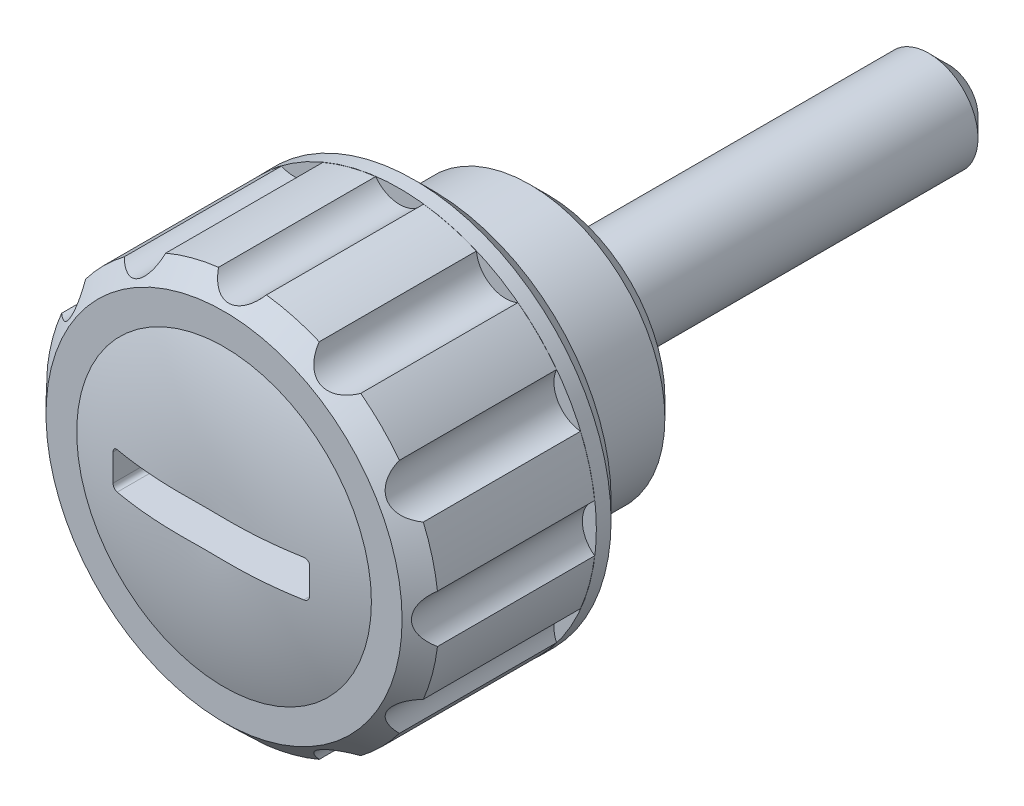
ISO-10303-21;
HEADER;
FILE_DESCRIPTION(('STEP AP214'),'2;1');
FILE_NAME('part.step','',(''),(''),'','','');
FILE_SCHEMA(('AUTOMOTIVE_DESIGN { 1 0 10303 214 1 1 1 1 }'));
ENDSEC;
DATA;
#1=APPLICATION_CONTEXT('core data for automotive mechanical design processes');
#2=APPLICATION_PROTOCOL_DEFINITION('international standard','automotive_design',2000,#1);
#3=PRODUCT_CONTEXT('',#1,'mechanical');
#4=PRODUCT('Part','Part','',(#3));
#5=PRODUCT_RELATED_PRODUCT_CATEGORY('part','',(#4));
#6=PRODUCT_DEFINITION_FORMATION('','',#4);
#7=PRODUCT_DEFINITION_CONTEXT('part definition',#1,'design');
#8=PRODUCT_DEFINITION('design','',#6,#7);
#9=PRODUCT_DEFINITION_SHAPE('','',#8);
#10=(LENGTH_UNIT() NAMED_UNIT(*) SI_UNIT(.MILLI.,.METRE.));
#11=(NAMED_UNIT(*) PLANE_ANGLE_UNIT() SI_UNIT($,.RADIAN.));
#12=(NAMED_UNIT(*) SI_UNIT($,.STERADIAN.) SOLID_ANGLE_UNIT());
#13=UNCERTAINTY_MEASURE_WITH_UNIT(LENGTH_MEASURE(1.E-05),#10,'distance_accuracy_value','');
#14=(GEOMETRIC_REPRESENTATION_CONTEXT(3) GLOBAL_UNCERTAINTY_ASSIGNED_CONTEXT((#13)) GLOBAL_UNIT_ASSIGNED_CONTEXT((#10,
#11,#12)) REPRESENTATION_CONTEXT('',''));
#15=CARTESIAN_POINT('',(0.,0.,0.));
#16=DIRECTION('',(0.,0.,1.));
#17=DIRECTION('',(1.,0.,0.));
#18=AXIS2_PLACEMENT_3D('',#15,#16,#17);
#19=CARTESIAN_POINT('',(0.,0.,-0.703698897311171));
#20=DIRECTION('',(0.,0.,1.));
#21=DIRECTION('',(1.,0.,0.));
#22=AXIS2_PLACEMENT_3D('',#19,#20,#21);
#23=DEGENERATE_TOROIDAL_SURFACE('',#22,1.1776626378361,15.,.T.);
#24=CARTESIAN_POINT('',(0.,0.,13.5));
#25=DIRECTION('',(0.,0.,1.));
#26=DIRECTION('',(1.,0.,0.));
#27=AXIS2_PLACEMENT_3D('',#24,#25,#26);
#28=CIRCLE('',#27,6.);
#29=CARTESIAN_POINT('',(6.,0.,13.5));
#30=VERTEX_POINT('',#29);
#31=EDGE_CURVE('E420',#30,#30,#28,.T.);
#32=ORIENTED_EDGE('',*,*,#31,.T.);
#33=EDGE_LOOP('',(#32));
#34=FACE_BOUND('',#33,.T.);
#35=CARTESIAN_POINT('',(-3.7998,-0.749999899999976,14.0521326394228));
#36=CARTESIAN_POINT('',(-3.81114880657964,-0.750020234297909,14.0500982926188));
#37=CARTESIAN_POINT('',(-3.82250108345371,-0.749057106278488,14.0480843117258));
#38=CARTESIAN_POINT('',(-3.84489426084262,-0.745224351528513,14.0441543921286));
#39=CARTESIAN_POINT('',(-3.85593522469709,-0.742355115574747,14.0422384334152));
#40=CARTESIAN_POINT('',(-3.87740011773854,-0.734767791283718,14.0385596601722));
#41=CARTESIAN_POINT('',(-3.88782359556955,-0.730048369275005,14.0367969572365));
#42=CARTESIAN_POINT('',(-3.90773653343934,-0.718887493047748,14.0334807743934));
#43=CARTESIAN_POINT('',(-3.91722631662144,-0.712446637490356,14.0319272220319));
#44=CARTESIAN_POINT('',(-3.93490505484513,-0.698084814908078,14.0290917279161));
#45=CARTESIAN_POINT('',(-3.9431055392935,-0.690178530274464,14.027807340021));
#46=CARTESIAN_POINT('',(-3.95806529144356,-0.673063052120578,14.025533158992));
#47=CARTESIAN_POINT('',(-3.96482436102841,-0.663853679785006,14.0245434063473));
#48=CARTESIAN_POINT('',(-3.97659283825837,-0.644555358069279,14.0229052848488));
#49=CARTESIAN_POINT('',(-3.98162854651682,-0.634482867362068,14.0222516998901));
#50=CARTESIAN_POINT('',(-3.98994131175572,-0.613624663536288,14.0212843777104));
#51=CARTESIAN_POINT('',(-3.99321964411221,-0.602839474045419,14.0209703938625));
#52=CARTESIAN_POINT('',(-3.99704991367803,-0.584948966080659,14.0207435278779));
#53=CARTESIAN_POINT('',(-3.99816189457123,-0.577959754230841,14.0207251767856));
#54=CARTESIAN_POINT('',(-3.99964030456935,-0.563913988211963,14.0208265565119));
#55=CARTESIAN_POINT('',(-4.00000779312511,-0.556857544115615,14.0209460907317));
#56=CARTESIAN_POINT('',(-3.9999999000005,-0.549800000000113,14.0211342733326));
#57=B_SPLINE_CURVE_WITH_KNOTS('',3,(#35,#36,#37,#38,#39,#40,#41,#42,#43,#44,#45,#46,#47,#48,#49,
#50,#51,#52,#53,#54,#55,#56),.UNSPECIFIED.,.F.,.F.,(4,2,2,2,2,2,2,2,2,2,4),(0.,
0.0345466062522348,0.0690861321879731,0.103650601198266,0.138203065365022,0.172426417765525,
0.206654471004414,0.240334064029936,0.273989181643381,0.295182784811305,0.316346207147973),.UNSPECIFIED.);
#58=CARTESIAN_POINT('',(-3.8,-0.75,14.0520967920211));
#59=VERTEX_POINT('',#58);
#60=CARTESIAN_POINT('',(-4.,-0.55,14.02112896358));
#61=VERTEX_POINT('',#60);
#62=EDGE_CURVE('E531',#59,#61,#57,.T.);
#63=ORIENTED_EDGE('',*,*,#62,.T.);
#64=CARTESIAN_POINT('',(-4.,0.,14.028388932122));
#65=CARTESIAN_POINT('',(-4.,0.339153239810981,14.0283961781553));
#66=CARTESIAN_POINT('',(-4.,0.678323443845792,14.0201840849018));
#67=CARTESIAN_POINT('',(-4.,1.35574448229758,13.9866878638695));
#68=CARTESIAN_POINT('',(-4.,1.69399552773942,13.9614080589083));
#69=CARTESIAN_POINT('',(-4.,2.36814839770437,13.8923714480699));
#70=CARTESIAN_POINT('',(-4.,2.7040529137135,13.8486414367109));
#71=CARTESIAN_POINT('',(-4.,3.37274568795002,13.7413643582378));
#72=CARTESIAN_POINT('',(-4.,3.70553346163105,13.6778142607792));
#73=CARTESIAN_POINT('',(-4.,4.45788889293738,13.5095576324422));
#74=CARTESIAN_POINT('',(-4.,4.87602372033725,13.3983308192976));
#75=CARTESIAN_POINT('',(-4.,5.70161656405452,13.1413580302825));
#76=CARTESIAN_POINT('',(-4.,6.10907328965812,12.9956079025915));
#77=CARTESIAN_POINT('',(-4.,6.91043852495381,12.6696375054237));
#78=CARTESIAN_POINT('',(-4.,7.30433371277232,12.4893844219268));
#79=CARTESIAN_POINT('',(-4.,8.07498519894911,12.0953512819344));
#80=CARTESIAN_POINT('',(-4.,8.45174183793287,11.8815718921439));
#81=CARTESIAN_POINT('',(-4.,9.18281763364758,11.4232419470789));
#82=CARTESIAN_POINT('',(-4.,9.53726091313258,11.1788894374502));
#83=CARTESIAN_POINT('',(-4.,10.2233955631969,10.6600773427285));
#84=CARTESIAN_POINT('',(-4.,10.5550867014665,10.3856174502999));
#85=CARTESIAN_POINT('',(-4.,11.1930381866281,9.8086212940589));
#86=CARTESIAN_POINT('',(-4.,11.4993002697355,9.50608695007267));
#87=CARTESIAN_POINT('',(-4.,12.0839658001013,8.87520844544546));
#88=CARTESIAN_POINT('',(-4.,12.3623701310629,8.54686510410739));
#89=CARTESIAN_POINT('',(-4.,12.8784698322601,7.8806109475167));
#90=CARTESIAN_POINT('',(-4.,13.1173543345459,7.54362037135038));
#91=CARTESIAN_POINT('',(-4.,13.5656684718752,6.85059247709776));
#92=CARTESIAN_POINT('',(-4.,13.7750989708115,6.49455571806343));
#93=CARTESIAN_POINT('',(-4.,14.1629376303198,5.76604322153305));
#94=CARTESIAN_POINT('',(-4.,14.3413507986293,5.39357014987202));
#95=CARTESIAN_POINT('',(-4.,14.6658865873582,4.63480988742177));
#96=CARTESIAN_POINT('',(-4.,14.8120091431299,4.24852266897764));
#97=CARTESIAN_POINT('',(-4.,15.0699099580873,3.46788913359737));
#98=CARTESIAN_POINT('',(-4.,15.1819394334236,3.07362578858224));
#99=CARTESIAN_POINT('',(-4.,15.3723250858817,2.2770527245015));
#100=CARTESIAN_POINT('',(-4.,15.4506814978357,1.87474306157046));
#101=CARTESIAN_POINT('',(-4.,15.5731575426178,1.06492658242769));
#102=CARTESIAN_POINT('',(-4.,15.617275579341,0.657419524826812));
#103=CARTESIAN_POINT('',(-4.,15.6709496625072,-0.159864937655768));
#104=CARTESIAN_POINT('',(-4.,15.6805056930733,-0.569642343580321));
#105=CARTESIAN_POINT('',(-4.,15.665001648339,-1.38774900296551));
#106=CARTESIAN_POINT('',(-4.,15.6400084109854,-1.7960795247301));
#107=CARTESIAN_POINT('',(-4.,15.5557048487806,-2.60918184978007));
#108=CARTESIAN_POINT('',(-4.,15.4963945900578,-3.01395365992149));
#109=CARTESIAN_POINT('',(-4.,15.3438918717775,-3.8170229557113));
#110=CARTESIAN_POINT('',(-4.,15.2507026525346,-4.21532105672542));
#111=CARTESIAN_POINT('',(-4.,15.0311128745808,-5.00265431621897));
#112=CARTESIAN_POINT('',(-4.,14.9047123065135,-5.39168947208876));
#113=CARTESIAN_POINT('',(-4.,14.619619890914,-6.15771427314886));
#114=CARTESIAN_POINT('',(-4.,14.4609300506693,-6.53470466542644));
#115=CARTESIAN_POINT('',(-4.,14.112398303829,-7.27399825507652));
#116=CARTESIAN_POINT('',(-4.,13.9225564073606,-7.63630145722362));
#117=CARTESIAN_POINT('',(-4.,13.5130367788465,-8.34375702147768));
#118=CARTESIAN_POINT('',(-4.,13.2933514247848,-8.68890497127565));
#119=CARTESIAN_POINT('',(-4.,12.825767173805,-9.35952806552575));
#120=CARTESIAN_POINT('',(-4.,12.5778682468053,-9.68500318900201));
#121=CARTESIAN_POINT('',(-4.,12.0550681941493,-10.3147088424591));
#122=CARTESIAN_POINT('',(-4.,11.7801085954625,-10.6188908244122));
#123=CARTESIAN_POINT('',(-4.,11.2056412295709,-11.2031141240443));
#124=CARTESIAN_POINT('',(-4.,10.9061334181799,-11.4831553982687));
#125=CARTESIAN_POINT('',(-4.,10.2849635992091,-12.0170071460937));
#126=CARTESIAN_POINT('',(-4.,9.96331753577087,-12.2708361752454));
#127=CARTESIAN_POINT('',(-4.,9.30001359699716,-12.7508263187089));
#128=CARTESIAN_POINT('',(-4.,8.95835585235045,-12.9769876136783));
#129=CARTESIAN_POINT('',(-4.,8.25506085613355,-13.4017235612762));
#130=CARTESIAN_POINT('',(-4.,7.89330122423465,-13.6000955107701));
#131=CARTESIAN_POINT('',(-4.,7.1546361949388,-13.9662854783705));
#132=CARTESIAN_POINT('',(-4.,6.77773047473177,-14.1341028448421));
#133=CARTESIAN_POINT('',(-4.,6.01113338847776,-14.4386630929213));
#134=CARTESIAN_POINT('',(-4.,5.62142902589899,-14.5753731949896));
#135=CARTESIAN_POINT('',(-4.,4.83241304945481,-14.817363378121));
#136=CARTESIAN_POINT('',(-4.,4.4331021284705,-14.9226457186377));
#137=CARTESIAN_POINT('',(-4.,3.77164652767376,-15.0703302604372));
#138=CARTESIAN_POINT('',(-4.,3.51147362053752,-15.1217585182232));
#139=CARTESIAN_POINT('',(-4.,2.98899804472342,-15.2123395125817));
#140=CARTESIAN_POINT('',(-4.,2.7266952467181,-15.2514914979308));
#141=CARTESIAN_POINT('',(-4.,1.93724201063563,-15.3514509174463));
#142=CARTESIAN_POINT('',(-4.,1.40777675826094,-15.3947116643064));
#143=CARTESIAN_POINT('',(-4.,0.612198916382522,-15.4285188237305));
#144=CARTESIAN_POINT('',(-4.,0.346571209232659,-15.4345998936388));
#145=CARTESIAN_POINT('',(-4.,-0.184756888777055,-15.4366600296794));
#146=CARTESIAN_POINT('',(-4.,-0.450457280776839,-15.4326389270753));
#147=CARTESIAN_POINT('',(-4.,-0.981374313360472,-15.4142959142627));
#148=CARTESIAN_POINT('',(-4.,-1.24659112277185,-15.3999788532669));
#149=CARTESIAN_POINT('',(-4.,-1.7762314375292,-15.3604541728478));
#150=CARTESIAN_POINT('',(-4.,-2.04065492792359,-15.3352463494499));
#151=CARTESIAN_POINT('',(-4.,-2.52470132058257,-15.2783376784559));
#152=CARTESIAN_POINT('',(-4.,-2.74453002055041,-15.248390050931));
#153=CARTESIAN_POINT('',(-4.,-3.18285214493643,-15.1800456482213));
#154=CARTESIAN_POINT('',(-4.,-3.40134562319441,-15.1416492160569));
#155=CARTESIAN_POINT('',(-4.,-4.05419633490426,-15.0133381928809));
#156=CARTESIAN_POINT('',(-4.,-4.48606739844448,-14.9102854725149));
#157=CARTESIAN_POINT('',(-4.,-5.33835432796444,-14.6682914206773));
#158=CARTESIAN_POINT('',(-4.,-5.75879820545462,-14.5294486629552));
#159=CARTESIAN_POINT('',(-4.,-6.58609234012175,-14.2156839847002));
#160=CARTESIAN_POINT('',(-4.,-6.99294114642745,-14.0407582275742));
#161=CARTESIAN_POINT('',(-4.,-7.79138450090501,-13.6547019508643));
#162=CARTESIAN_POINT('',(-4.,-8.18290123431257,-13.4434103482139));
#163=CARTESIAN_POINT('',(-4.,-8.94537896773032,-12.9865110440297));
#164=CARTESIAN_POINT('',(-4.,-9.31634014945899,-12.7409036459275));
#165=CARTESIAN_POINT('',(-4.,-10.0350527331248,-12.2167860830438));
#166=CARTESIAN_POINT('',(-4.,-10.3827705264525,-11.9382298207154));
#167=CARTESIAN_POINT('',(-4.,-11.0514362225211,-11.350662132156));
#168=CARTESIAN_POINT('',(-4.,-11.3723853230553,-11.0416520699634));
#169=CARTESIAN_POINT('',(-4.,-11.9642331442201,-10.4173353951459));
#170=CARTESIAN_POINT('',(-4.,-12.2370447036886,-10.1038391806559));
#171=CARTESIAN_POINT('',(-4.,-12.7549508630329,-9.4547474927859));
#172=CARTESIAN_POINT('',(-4.,-13.0000469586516,-9.11915321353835));
#173=CARTESIAN_POINT('',(-4.,-13.4605522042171,-8.42850547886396));
#174=CARTESIAN_POINT('',(-4.,-13.67598107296,-8.07346517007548));
#175=CARTESIAN_POINT('',(-4.,-14.0757477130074,-7.34628666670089));
#176=CARTESIAN_POINT('',(-4.,-14.2600853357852,-6.97414839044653));
#177=CARTESIAN_POINT('',(-4.,-14.5943069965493,-6.21997693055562));
#178=CARTESIAN_POINT('',(-4.,-14.7445728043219,-5.83811287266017));
#179=CARTESIAN_POINT('',(-4.,-15.0123145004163,-5.06306047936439));
#180=CARTESIAN_POINT('',(-4.,-15.1297907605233,-4.669872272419));
#181=CARTESIAN_POINT('',(-4.,-15.3311166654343,-3.87492033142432));
#182=CARTESIAN_POINT('',(-4.,-15.4149615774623,-3.47315539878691));
#183=CARTESIAN_POINT('',(-4.,-15.5483930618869,-2.66397544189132));
#184=CARTESIAN_POINT('',(-4.,-15.5979796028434,-2.25656041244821));
#185=CARTESIAN_POINT('',(-4.,-15.6624394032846,-1.44020146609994));
#186=CARTESIAN_POINT('',(-4.,-15.6774144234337,-1.03126558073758));
#187=CARTESIAN_POINT('',(-4.,-15.6728420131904,-0.213587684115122));
#188=CARTESIAN_POINT('',(-4.,-15.653294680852,0.19515432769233));
#189=CARTESIAN_POINT('',(-4.,-15.5798200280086,1.00952109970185));
#190=CARTESIAN_POINT('',(-4.,-15.5258939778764,1.41514597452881));
#191=CARTESIAN_POINT('',(-4.,-15.3840519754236,2.22040863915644));
#192=CARTESIAN_POINT('',(-4.,-15.2961360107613,2.62004642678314));
#193=CARTESIAN_POINT('',(-4.,-15.0869932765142,3.41032437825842));
#194=CARTESIAN_POINT('',(-4.,-14.9657808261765,3.8009683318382));
#195=CARTESIAN_POINT('',(-4.,-14.6909025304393,4.57066557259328));
#196=CARTESIAN_POINT('',(-4.,-14.5372367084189,4.94971886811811));
#197=CARTESIAN_POINT('',(-4.,-14.198563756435,5.6935427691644));
#198=CARTESIAN_POINT('',(-4.,-14.0135574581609,6.05831375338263));
#199=CARTESIAN_POINT('',(-4.,-13.6135344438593,6.77101064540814));
#200=CARTESIAN_POINT('',(-4.,-13.3985177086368,7.11893654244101));
#201=CARTESIAN_POINT('',(-4.,-12.9397392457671,7.79592064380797));
#202=CARTESIAN_POINT('',(-4.,-12.695942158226,8.12495488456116));
#203=CARTESIAN_POINT('',(-4.,-12.1815798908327,8.76138756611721));
#204=CARTESIAN_POINT('',(-4.,-11.91101469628,9.068785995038));
#205=CARTESIAN_POINT('',(-4.,-11.3450384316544,9.65985804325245));
#206=CARTESIAN_POINT('',(-4.,-11.049624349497,9.94352877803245));
#207=CARTESIAN_POINT('',(-4.,-10.4361166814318,10.4851767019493));
#208=CARTESIAN_POINT('',(-4.,-10.1180230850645,10.7431538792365));
#209=CARTESIAN_POINT('',(-4.,-9.45975657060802,11.2329803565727));
#210=CARTESIAN_POINT('',(-4.,-9.11947790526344,11.4646875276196));
#211=CARTESIAN_POINT('',(-4.,-8.42081797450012,11.8989645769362));
#212=CARTESIAN_POINT('',(-4.,-8.06243669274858,12.1015344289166));
#213=CARTESIAN_POINT('',(-4.,-7.33043234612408,12.476268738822));
#214=CARTESIAN_POINT('',(-4.,-6.95681985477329,12.6484538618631));
#215=CARTESIAN_POINT('',(-4.,-6.19684574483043,12.961845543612));
#216=CARTESIAN_POINT('',(-4.,-5.81048403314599,13.1030518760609));
#217=CARTESIAN_POINT('',(-4.,-4.98307663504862,13.3686004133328));
#218=CARTESIAN_POINT('',(-4.,-4.54082134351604,13.4891802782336));
#219=CARTESIAN_POINT('',(-4.,-3.64769934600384,13.6923551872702));
#220=CARTESIAN_POINT('',(-4.,-3.19683149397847,13.774945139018));
#221=CARTESIAN_POINT('',(-4.,-2.28933102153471,13.9045907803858));
#222=CARTESIAN_POINT('',(-4.,-1.83269032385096,13.9515893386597));
#223=CARTESIAN_POINT('',(-4.,-1.14623014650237,13.9979727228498));
#224=CARTESIAN_POINT('',(-4.,-0.917138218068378,14.0094147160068));
#225=CARTESIAN_POINT('',(-4.,-0.458700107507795,14.0246202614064));
#226=CARTESIAN_POINT('',(-4.,-0.229353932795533,14.0283840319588));
#227=CARTESIAN_POINT('',(-4.,0.,14.028388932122));
#228=B_SPLINE_CURVE_WITH_KNOTS('',3,(#64,#65,#66,#67,#68,#69,#70,#71,#72,#73,#74,#75,#76,#77,
#78,#79,#80,#81,#82,#83,#84,#85,#86,#87,#88,#89,#90,#91,#92,#93,#94,#95,#96,#97,#98,#99,#100,
#101,#102,#103,#104,#105,#106,#107,#108,#109,#110,#111,#112,#113,#114,#115,#116,#117,#118,#119,
#120,#121,#122,#123,#124,#125,#126,#127,#128,#129,#130,#131,#132,#133,#134,#135,#136,#137,#138,
#139,#140,#141,#142,#143,#144,#145,#146,#147,#148,#149,#150,#151,#152,#153,#154,#155,#156,#157,
#158,#159,#160,#161,#162,#163,#164,#165,#166,#167,#168,#169,#170,#171,#172,#173,#174,#175,#176,
#177,#178,#179,#180,#181,#182,#183,#184,#185,#186,#187,#188,#189,#190,#191,#192,#193,#194,#195,
#196,#197,#198,#199,#200,#201,#202,#203,#204,#205,#206,#207,#208,#209,#210,#211,#212,#213,#214,
#215,#216,#217,#218,#219,#220,#221,#222,#223,#224,#225,#226,#227),.UNSPECIFIED.,.T.,.F.,(4,2,2,
2,2,2,2,2,2,2,2,2,2,2,2,2,2,2,2,2,2,2,2,2,2,2,2,2,2,2,2,2,2,2,2,2,2,2,2,2,2,2,2,2,2,2,2,2,2,2,2,
2,2,2,2,2,2,2,2,2,2,2,2,2,2,2,2,2,2,2,2,2,2,2,2,2,2,2,2,2,2,4),(0.,1.01738294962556,
2.03450831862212,3.05016161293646,4.06597026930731,5.36249424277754,6.6591742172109,
7.95709358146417,9.25498713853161,10.5448707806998,11.8347675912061,13.1245762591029,
14.4143439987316,15.6520836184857,16.8897869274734,18.1272902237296,19.3647959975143,
20.5929491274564,21.8210936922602,23.0492955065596,24.2774978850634,25.5033275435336,
26.7291548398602,27.9548649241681,29.1805753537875,30.4062096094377,31.6318434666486,
32.8577909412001,34.0837397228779,35.3123982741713,36.5410590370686,37.7688439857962,
38.9966209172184,40.2329329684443,41.4692713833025,42.7069066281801,43.9444528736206,
44.7397910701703,45.5351779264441,47.1266553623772,47.9236225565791,48.7206030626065,
49.5172084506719,50.3138287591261,50.9792441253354,51.6446324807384,52.9749769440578,
54.301695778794,55.6285557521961,56.9614518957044,58.2943362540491,59.6291079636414,
60.9638199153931,62.2090674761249,63.4542478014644,64.6985964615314,65.9429510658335,
67.1725857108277,68.4022064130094,69.6320000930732,70.8617949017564,72.0879693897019,
73.3141403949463,74.5402660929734,75.7663922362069,76.9919919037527,78.2175906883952,
79.4431569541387,80.6687240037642,81.8958127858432,83.1229022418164,84.3501406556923,
85.5773796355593,86.8109699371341,88.0445613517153,89.2773105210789,90.510068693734,
91.8834796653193,93.2570746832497,94.632869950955,95.3208993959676,96.0089092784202),.UNSPECIFIED.);
#229=CARTESIAN_POINT('',(-4.,0.55,14.02112896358));
#230=VERTEX_POINT('',#229);
#231=EDGE_CURVE('E230',#61,#230,#228,.T.);
#232=ORIENTED_EDGE('',*,*,#231,.T.);
#233=CARTESIAN_POINT('',(-3.99999989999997,0.5498,14.0211342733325));
#234=CARTESIAN_POINT('',(-4.00002120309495,0.560882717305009,14.0208370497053));
#235=CARTESIAN_POINT('',(-3.99910147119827,0.571967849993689,14.0207119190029));
#236=CARTESIAN_POINT('',(-3.99545102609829,0.59382219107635,14.0208010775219));
#237=CARTESIAN_POINT('',(-3.99272233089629,0.604591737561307,14.021014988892));
#238=CARTESIAN_POINT('',(-3.98552323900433,0.625524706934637,14.0217769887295));
#239=CARTESIAN_POINT('',(-3.98105209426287,0.635687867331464,14.0223252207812));
#240=CARTESIAN_POINT('',(-3.97050578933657,0.655118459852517,14.0237373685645));
#241=CARTESIAN_POINT('',(-3.96443078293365,0.664385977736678,14.0246012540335));
#242=CARTESIAN_POINT('',(-3.95082544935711,0.681812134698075,14.0266217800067));
#243=CARTESIAN_POINT('',(-3.94328885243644,0.689965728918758,14.0277796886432));
#244=CARTESIAN_POINT('',(-3.92699598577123,0.704900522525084,14.030350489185));
#245=CARTESIAN_POINT('',(-3.91823946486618,0.711681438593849,14.0317634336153));
#246=CARTESIAN_POINT('',(-3.89962640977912,0.723780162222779,14.0348229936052));
#247=CARTESIAN_POINT('',(-3.88975612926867,0.729076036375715,14.0364726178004));
#248=CARTESIAN_POINT('',(-3.86929754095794,0.737941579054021,14.0399411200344));
#249=CARTESIAN_POINT('',(-3.858709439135,0.741511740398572,14.0417599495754));
#250=CARTESIAN_POINT('',(-3.84003688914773,0.746119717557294,14.0450054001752));
#251=CARTESIAN_POINT('',(-3.83204943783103,0.747581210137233,14.046405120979));
#252=CARTESIAN_POINT('',(-3.8159747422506,0.749525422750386,14.0492439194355));
#253=CARTESIAN_POINT('',(-3.80788765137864,0.750009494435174,14.0506829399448));
#254=CARTESIAN_POINT('',(-3.79980000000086,0.749999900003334,14.052132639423));
#255=B_SPLINE_CURVE_WITH_KNOTS('',3,(#233,#234,#235,#236,#237,#238,#239,#240,#241,#242,#243,
#244,#245,#246,#247,#248,#249,#250,#251,#252,#253,#254),.UNSPECIFIED.,.F.,.F.,(4,2,2,2,2,2,2,2,
2,2,4),(0.,0.0332152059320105,0.0663934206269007,0.0995858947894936,0.132775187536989,
0.166110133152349,0.199451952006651,0.233262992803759,0.267064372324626,0.291727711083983,
0.316356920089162),.UNSPECIFIED.);
#256=CARTESIAN_POINT('',(-3.79999999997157,0.75,14.0520967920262));
#257=VERTEX_POINT('',#256);
#258=EDGE_CURVE('E485',#230,#257,#255,.T.);
#259=ORIENTED_EDGE('',*,*,#258,.T.);
#260=CARTESIAN_POINT('',(0.,0.75,14.2902033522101));
#261=CARTESIAN_POINT('',(0.062509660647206,0.75,14.2902036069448));
#262=CARTESIAN_POINT('',(0.125019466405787,0.75,14.2904360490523));
#263=CARTESIAN_POINT('',(0.250036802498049,0.75,14.291252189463));
#264=CARTESIAN_POINT('',(0.312544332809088,0.75,14.2918358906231));
#265=CARTESIAN_POINT('',(0.437565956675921,0.75,14.2930988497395));
#266=CARTESIAN_POINT('',(0.500080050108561,0.75,14.2937781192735));
#267=CARTESIAN_POINT('',(0.625113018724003,0.75,14.2949804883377));
#268=CARTESIAN_POINT('',(0.687631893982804,0.75,14.2955035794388));
#269=CARTESIAN_POINT('',(0.875766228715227,0.75,14.2965328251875));
#270=CARTESIAN_POINT('',(1.00138686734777,0.75,14.2964891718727));
#271=CARTESIAN_POINT('',(1.25260493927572,0.75,14.2940460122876));
#272=CARTESIAN_POINT('',(1.37820237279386,0.75,14.2916465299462));
#273=CARTESIAN_POINT('',(1.75485708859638,0.75,14.2803277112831));
#274=CARTESIAN_POINT('',(2.00580900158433,0.75,14.2672884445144));
#275=CARTESIAN_POINT('',(2.50689880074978,0.75,14.2291477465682));
#276=CARTESIAN_POINT('',(2.75703633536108,0.75,14.2040416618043));
#277=CARTESIAN_POINT('',(3.25583549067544,0.75,14.1415504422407));
#278=CARTESIAN_POINT('',(3.5044966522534,0.75,14.1041616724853));
#279=CARTESIAN_POINT('',(4.16871083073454,0.75,13.9873107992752));
#280=CARTESIAN_POINT('',(4.58233519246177,0.75,13.8965497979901));
#281=CARTESIAN_POINT('',(5.40052634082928,0.75,13.6805066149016));
#282=CARTESIAN_POINT('',(5.80509101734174,0.75,13.5552164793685));
#283=CARTESIAN_POINT('',(6.60293944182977,0.75,13.2706758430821));
#284=CARTESIAN_POINT('',(6.99620137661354,0.75,13.1113641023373));
#285=CARTESIAN_POINT('',(7.76780860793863,0.75,12.760031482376));
#286=CARTESIAN_POINT('',(8.14615456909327,0.75,12.5680120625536));
#287=CARTESIAN_POINT('',(8.88446706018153,0.75,12.1530468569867));
#288=CARTESIAN_POINT('',(9.2444697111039,0.75,11.9301653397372));
#289=CARTESIAN_POINT('',(9.9443450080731,0.75,11.4547620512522));
#290=CARTESIAN_POINT('',(10.2842175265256,0.75,11.2022400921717));
#291=CARTESIAN_POINT('',(10.9411846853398,0.75,10.6695279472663));
#292=CARTESIAN_POINT('',(11.2582935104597,0.75,10.3893552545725));
#293=CARTESIAN_POINT('',(11.867695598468,0.75,9.80321084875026));
#294=CARTESIAN_POINT('',(12.1599889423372,0.75,9.49723921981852));
#295=CARTESIAN_POINT('',(12.7167806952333,0.75,8.86269415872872));
#296=CARTESIAN_POINT('',(12.9813643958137,0.75,8.53419556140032));
#297=CARTESIAN_POINT('',(13.4819097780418,0.75,7.85607214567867));
#298=CARTESIAN_POINT('',(13.7178715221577,0.75,7.50644737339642));
#299=CARTESIAN_POINT('',(14.1595322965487,0.75,6.78849443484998));
#300=CARTESIAN_POINT('',(14.3652260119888,0.75,6.42016299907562));
#301=CARTESIAN_POINT('',(14.7448367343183,0.75,5.66747355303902));
#302=CARTESIAN_POINT('',(14.9187537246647,0.75,5.28311553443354));
#303=CARTESIAN_POINT('',(15.2335050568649,0.75,4.50127546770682));
#304=CARTESIAN_POINT('',(15.3743535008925,0.75,4.10379909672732));
#305=CARTESIAN_POINT('',(15.6220611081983,0.75,3.29839291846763));
#306=CARTESIAN_POINT('',(15.7289202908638,0.75,2.89046311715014));
#307=CARTESIAN_POINT('',(15.9078821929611,0.75,2.06708280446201));
#308=CARTESIAN_POINT('',(15.9799876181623,0.75,1.65163288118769));
#309=CARTESIAN_POINT('',(16.0889414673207,0.75,0.816135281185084));
#310=CARTESIAN_POINT('',(16.1257898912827,0.75,0.396087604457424));
#311=CARTESIAN_POINT('',(16.163965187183,0.75,-0.445565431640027));
#312=CARTESIAN_POINT('',(16.1652965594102,0.75,-0.867170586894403));
#313=CARTESIAN_POINT('',(16.1324397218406,0.75,-1.7089944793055));
#314=CARTESIAN_POINT('',(16.0982515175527,0.75,-2.12921321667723));
#315=CARTESIAN_POINT('',(15.994590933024,0.75,-2.96533956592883));
#316=CARTESIAN_POINT('',(15.9251132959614,0.75,-3.38124652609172));
#317=CARTESIAN_POINT('',(15.751365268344,0.75,-4.20572862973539));
#318=CARTESIAN_POINT('',(15.6470948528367,0.75,-4.61430376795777));
#319=CARTESIAN_POINT('',(15.4044819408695,0.75,-5.42128714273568));
#320=CARTESIAN_POINT('',(15.2661335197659,0.75,-5.8196935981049));
#321=CARTESIAN_POINT('',(14.9563586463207,0.75,-6.6034316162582));
#322=CARTESIAN_POINT('',(14.7849322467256,0.75,-6.9887631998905));
#323=CARTESIAN_POINT('',(14.410318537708,0.75,-7.74341593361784));
#324=CARTESIAN_POINT('',(14.2071477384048,0.75,-8.11274527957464));
#325=CARTESIAN_POINT('',(13.7704245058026,0.75,-8.83298393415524));
#326=CARTESIAN_POINT('',(13.5368719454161,0.75,-9.18389316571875));
#327=CARTESIAN_POINT('',(13.0411762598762,0.75,-9.86461934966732));
#328=CARTESIAN_POINT('',(12.7790481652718,0.75,-10.1944472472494));
#329=CARTESIAN_POINT('',(12.2279683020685,0.75,-10.8308662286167));
#330=CARTESIAN_POINT('',(11.9390170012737,0.75,-11.1374577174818));
#331=CARTESIAN_POINT('',(11.3358371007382,0.75,-11.7257264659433));
#332=CARTESIAN_POINT('',(11.0215672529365,0.75,-12.0073614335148));
#333=CARTESIAN_POINT('',(10.3703891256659,0.75,-12.5431585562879));
#334=CARTESIAN_POINT('',(10.0334794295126,0.75,-12.7973189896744));
#335=CARTESIAN_POINT('',(9.33882156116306,0.75,-13.2767706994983));
#336=CARTESIAN_POINT('',(8.98103735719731,0.75,-13.5020097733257));
#337=CARTESIAN_POINT('',(8.24780759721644,0.75,-13.9214489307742));
#338=CARTESIAN_POINT('',(7.87236542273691,0.75,-14.1156549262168));
#339=CARTESIAN_POINT('',(7.10830459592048,0.75,-14.4708441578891));
#340=CARTESIAN_POINT('',(6.71975907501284,0.75,-14.6319846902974));
#341=CARTESIAN_POINT('',(5.93032689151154,0.75,-14.9212008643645));
#342=CARTESIAN_POINT('',(5.52943355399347,0.75,-15.049258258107));
#343=CARTESIAN_POINT('',(4.71037120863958,0.75,-15.2735305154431));
#344=CARTESIAN_POINT('',(4.29201779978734,0.75,-15.3690765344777));
#345=CARTESIAN_POINT('',(3.65997311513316,0.75,-15.485449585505));
#346=CARTESIAN_POINT('',(3.44867138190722,0.75,-15.5197366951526));
#347=CARTESIAN_POINT('',(3.02478880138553,0.75,-15.5793924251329));
#348=CARTESIAN_POINT('',(2.81220789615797,0.75,-15.6047606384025));
#349=CARTESIAN_POINT('',(2.38452719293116,0.75,-15.6468286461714));
#350=CARTESIAN_POINT('',(2.16942066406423,0.75,-15.6634594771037));
#351=CARTESIAN_POINT('',(1.73875062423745,0.75,-15.6880212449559));
#352=CARTESIAN_POINT('',(1.5231871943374,0.75,-15.6959536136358));
#353=CARTESIAN_POINT('',(1.19954465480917,0.75,-15.7021388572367));
#354=CARTESIAN_POINT('',(1.09150789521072,0.75,-15.7032466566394));
#355=CARTESIAN_POINT('',(0.875426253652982,0.75,-15.7039178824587));
#356=CARTESIAN_POINT('',(0.767381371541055,0.75,-15.7034812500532));
#357=CARTESIAN_POINT('',(0.551281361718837,0.75,-15.7017790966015));
#358=CARTESIAN_POINT('',(0.443226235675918,0.75,-15.7005134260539));
#359=CARTESIAN_POINT('',(0.281143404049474,0.75,-15.6989476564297));
#360=CARTESIAN_POINT('',(0.227117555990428,0.75,-15.698481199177));
#361=CARTESIAN_POINT('',(0.119064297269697,0.75,-15.6978197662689));
#362=CARTESIAN_POINT('',(0.0650368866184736,0.75,-15.6976247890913));
#363=CARTESIAN_POINT('',(-0.05800398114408,0.75,-15.6975761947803));
#364=CARTESIAN_POINT('',(-0.127017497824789,0.75,-15.6978322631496));
#365=CARTESIAN_POINT('',(-0.265042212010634,0.75,-15.6987649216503));
#366=CARTESIAN_POINT('',(-0.334053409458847,0.75,-15.6994415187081));
#367=CARTESIAN_POINT('',(-0.47207998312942,0.75,-15.7008610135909));
#368=CARTESIAN_POINT('',(-0.541095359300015,0.75,-15.7016039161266));
#369=CARTESIAN_POINT('',(-0.679127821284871,0.75,-15.7028300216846));
#370=CARTESIAN_POINT('',(-0.748144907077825,0.75,-15.7033132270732));
#371=CARTESIAN_POINT('',(-0.955164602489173,0.75,-15.7040009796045));
#372=CARTESIAN_POINT('',(-1.0931724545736,0.75,-15.7034443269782));
#373=CARTESIAN_POINT('',(-1.36914222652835,0.75,-15.6993084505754));
#374=CARTESIAN_POINT('',(-1.50710414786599,0.75,-15.6957293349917));
#375=CARTESIAN_POINT('',(-1.78256534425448,0.75,-15.685188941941));
#376=CARTESIAN_POINT('',(-1.92006492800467,0.75,-15.6782359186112));
#377=CARTESIAN_POINT('',(-2.19483905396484,0.75,-15.6607772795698));
#378=CARTESIAN_POINT('',(-2.33211359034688,0.75,-15.6502715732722));
#379=CARTESIAN_POINT('',(-2.743559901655,0.75,-15.6132836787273));
#380=CARTESIAN_POINT('',(-3.01726339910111,0.75,-15.581334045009));
#381=CARTESIAN_POINT('',(-3.55992465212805,0.75,-15.5030144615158));
#382=CARTESIAN_POINT('',(-3.82890277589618,0.75,-15.4567848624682));
#383=CARTESIAN_POINT('',(-4.36392755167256,0.75,-15.3498484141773));
#384=CARTESIAN_POINT('',(-4.62997463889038,0.75,-15.2891437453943));
#385=CARTESIAN_POINT('',(-5.15895710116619,0.75,-15.1532282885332));
#386=CARTESIAN_POINT('',(-5.42188447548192,0.75,-15.0779863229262));
#387=CARTESIAN_POINT('',(-5.94322863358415,0.75,-14.9132881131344));
#388=CARTESIAN_POINT('',(-6.20164546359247,0.75,-14.8238320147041));
#389=CARTESIAN_POINT('',(-6.85115229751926,0.75,-14.5789290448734));
#390=CARTESIAN_POINT('',(-7.23867684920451,0.75,-14.4139021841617));
#391=CARTESIAN_POINT('',(-7.99805018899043,0.75,-14.0520702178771));
#392=CARTESIAN_POINT('',(-8.36991500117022,0.75,-13.8552986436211));
#393=CARTESIAN_POINT('',(-9.09777056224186,0.75,-13.4300705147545));
#394=CARTESIAN_POINT('',(-9.45366504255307,0.75,-13.2014490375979));
#395=CARTESIAN_POINT('',(-10.1449857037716,0.75,-12.714880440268));
#396=CARTESIAN_POINT('',(-10.4804049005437,0.75,-12.4569233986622));
#397=CARTESIAN_POINT('',(-11.1277254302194,0.75,-11.9140206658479));
#398=CARTESIAN_POINT('',(-11.4396635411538,0.75,-11.6291188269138));
#399=CARTESIAN_POINT('',(-12.0383542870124,0.75,-11.0340393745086));
#400=CARTESIAN_POINT('',(-12.3251095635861,0.75,-10.7238644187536));
#401=CARTESIAN_POINT('',(-12.870898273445,0.75,-10.0810426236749));
#402=CARTESIAN_POINT('',(-13.1299839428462,0.75,-9.74844013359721));
#403=CARTESIAN_POINT('',(-13.619228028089,0.75,-9.06258526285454));
#404=CARTESIAN_POINT('',(-13.8493856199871,0.75,-8.70933229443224));
#405=CARTESIAN_POINT('',(-14.2791137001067,0.75,-7.98471878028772));
#406=CARTESIAN_POINT('',(-14.4786861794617,0.75,-7.61335941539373));
#407=CARTESIAN_POINT('',(-14.8458413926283,0.75,-6.85515348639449));
#408=CARTESIAN_POINT('',(-15.0134243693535,0.75,-6.46830703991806));
#409=CARTESIAN_POINT('',(-15.3155070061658,0.75,-5.6816225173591));
#410=CARTESIAN_POINT('',(-15.4499855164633,0.75,-5.2817763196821));
#411=CARTESIAN_POINT('',(-15.6847633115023,0.75,-4.47217121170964));
#412=CARTESIAN_POINT('',(-15.7850625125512,0.75,-4.06241227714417));
#413=CARTESIAN_POINT('',(-15.9507352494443,0.75,-3.23605764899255));
#414=CARTESIAN_POINT('',(-16.0161221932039,0.75,-2.81946464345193));
#415=CARTESIAN_POINT('',(-16.1115638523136,0.75,-1.98225120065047));
#416=CARTESIAN_POINT('',(-16.1416186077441,0.75,-1.56163076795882));
#417=CARTESIAN_POINT('',(-16.1661796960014,0.75,-0.719438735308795));
#418=CARTESIAN_POINT('',(-16.1606932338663,0.75,-0.297867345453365));
#419=CARTESIAN_POINT('',(-16.114227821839,0.75,0.543314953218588));
#420=CARTESIAN_POINT('',(-16.0732488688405,0.75,0.962925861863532));
#421=CARTESIAN_POINT('',(-15.9560905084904,0.75,1.79720001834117));
#422=CARTESIAN_POINT('',(-15.8799114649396,0.75,2.21186331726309));
#423=CARTESIAN_POINT('',(-15.6928948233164,0.75,3.03329916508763));
#424=CARTESIAN_POINT('',(-15.582057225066,0.75,3.44007171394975));
#425=CARTESIAN_POINT('',(-15.3264932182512,0.75,4.24289288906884));
#426=CARTESIAN_POINT('',(-15.181761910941,0.75,4.63893995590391));
#427=CARTESIAN_POINT('',(-14.8594487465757,0.75,5.41743335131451));
#428=CARTESIAN_POINT('',(-14.68186687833,0.75,5.79987967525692));
#429=CARTESIAN_POINT('',(-14.2950896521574,0.75,6.54850360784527));
#430=CARTESIAN_POINT('',(-14.0858900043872,0.75,6.91467900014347));
#431=CARTESIAN_POINT('',(-13.6373836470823,0.75,7.62810226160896));
#432=CARTESIAN_POINT('',(-13.3980769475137,0.75,7.97535013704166));
#433=CARTESIAN_POINT('',(-12.8911539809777,0.75,8.64832469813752));
#434=CARTESIAN_POINT('',(-12.6235482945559,0.75,8.97405935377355));
#435=CARTESIAN_POINT('',(-12.0618570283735,0.75,9.60183607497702));
#436=CARTESIAN_POINT('',(-11.767771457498,0.75,9.9038781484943));
#437=CARTESIAN_POINT('',(-11.1552973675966,0.75,10.4820455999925));
#438=CARTESIAN_POINT('',(-10.8369156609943,0.75,10.758178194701));
#439=CARTESIAN_POINT('',(-10.1780402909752,0.75,11.2826657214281));
#440=CARTESIAN_POINT('',(-9.83754661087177,0.75,11.5310206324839));
#441=CARTESIAN_POINT('',(-9.13645925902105,0.75,11.9984683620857));
#442=CARTESIAN_POINT('',(-8.775842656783,0.75,12.2175267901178));
#443=CARTESIAN_POINT('',(-8.03744530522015,0.75,12.6244922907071));
#444=CARTESIAN_POINT('',(-7.65966465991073,0.75,12.8123995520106));
#445=CARTESIAN_POINT('',(-6.88907462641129,0.75,13.1559939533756));
#446=CARTESIAN_POINT('',(-6.49624456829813,0.75,13.3116347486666));
#447=CARTESIAN_POINT('',(-5.69887180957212,0.75,13.589295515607));
#448=CARTESIAN_POINT('',(-5.29432853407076,0.75,13.7113138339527));
#449=CARTESIAN_POINT('',(-4.47763909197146,0.75,13.9206164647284));
#450=CARTESIAN_POINT('',(-4.06552036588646,0.75,14.0080072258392));
#451=CARTESIAN_POINT('',(-3.44313498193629,0.75,14.1131515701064));
#452=CARTESIAN_POINT('',(-3.2349769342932,0.75,14.1438756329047));
#453=CARTESIAN_POINT('',(-2.81757605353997,0.75,14.1967187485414));
#454=CARTESIAN_POINT('',(-2.60833331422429,0.75,14.2188385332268));
#455=CARTESIAN_POINT('',(-2.19967651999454,0.75,14.2537079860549));
#456=CARTESIAN_POINT('',(-2.00029743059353,0.75,14.2668729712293));
#457=CARTESIAN_POINT('',(-1.60124974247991,0.75,14.2858621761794));
#458=CARTESIAN_POINT('',(-1.40158124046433,0.75,14.291688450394));
#459=CARTESIAN_POINT('',(-1.10202038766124,0.75,14.2957506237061));
#460=CARTESIAN_POINT('',(-1.00214989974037,0.75,14.2963250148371));
#461=CARTESIAN_POINT('',(-0.80240752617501,0.75,14.296275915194));
#462=CARTESIAN_POINT('',(-0.702535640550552,0.75,14.2956523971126));
#463=CARTESIAN_POINT('',(-0.502793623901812,0.75,14.2938528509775));
#464=CARTESIAN_POINT('',(-0.402923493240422,0.75,14.2926767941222));
#465=CARTESIAN_POINT('',(-0.2031790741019,0.75,14.290858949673));
#466=CARTESIAN_POINT('',(-0.103304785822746,0.75,14.2902171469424));
#467=CARTESIAN_POINT('',(-0.00228680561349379,0.75,14.2902034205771));
#468=CARTESIAN_POINT('',(-0.0011434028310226,0.75,14.2902033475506));
#469=CARTESIAN_POINT('',(0.,0.75,14.2902033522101));
#470=B_SPLINE_CURVE_WITH_KNOTS('',3,(#260,#261,#262,#263,#264,#265,#266,#267,#268,#269,#270,
#271,#272,#273,#274,#275,#276,#277,#278,#279,#280,#281,#282,#283,#284,#285,#286,#287,#288,#289,
#290,#291,#292,#293,#294,#295,#296,#297,#298,#299,#300,#301,#302,#303,#304,#305,#306,#307,#308,
#309,#310,#311,#312,#313,#314,#315,#316,#317,#318,#319,#320,#321,#322,#323,#324,#325,#326,#327,
#328,#329,#330,#331,#332,#333,#334,#335,#336,#337,#338,#339,#340,#341,#342,#343,#344,#345,#346,
#347,#348,#349,#350,#351,#352,#353,#354,#355,#356,#357,#358,#359,#360,#361,#362,#363,#364,#365,
#366,#367,#368,#369,#370,#371,#372,#373,#374,#375,#376,#377,#378,#379,#380,#381,#382,#383,#384,
#385,#386,#387,#388,#389,#390,#391,#392,#393,#394,#395,#396,#397,#398,#399,#400,#401,#402,#403,
#404,#405,#406,#407,#408,#409,#410,#411,#412,#413,#414,#415,#416,#417,#418,#419,#420,#421,#422,
#423,#424,#425,#426,#427,#428,#429,#430,#431,#432,#433,#434,#435,#436,#437,#438,#439,#440,#441,
#442,#443,#444,#445,#446,#447,#448,#449,#450,#451,#452,#453,#454,#455,#456,#457,#458,#459,#460,
#461,#462,#463,#464,#465,#466,#467,#468,#469),.UNSPECIFIED.,.T.,.F.,(4,2,2,2,2,2,2,2,2,2,2,2,2,
2,2,2,2,2,2,2,2,2,2,2,2,2,2,2,2,2,2,2,2,2,2,2,2,2,2,2,2,2,2,2,2,2,2,2,2,2,2,2,2,2,2,2,2,2,2,2,2,
2,2,2,2,2,2,2,2,2,2,2,2,2,2,2,2,2,2,2,2,2,2,2,2,2,2,2,2,2,2,2,2,2,2,2,2,2,2,2,2,2,2,2,4),(0.,
0.187528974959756,0.375059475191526,0.562612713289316,0.750176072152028,1.12702058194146,
1.50386126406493,2.25744605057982,3.0113216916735,3.76542063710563,5.034211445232,
6.30329476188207,7.57468202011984,8.84601256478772,10.1147343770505,11.3834642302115,
12.651396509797,13.9193246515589,15.1832276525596,16.4471278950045,17.7112498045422,
18.9753723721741,20.2389548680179,21.5025366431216,22.7660200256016,24.029503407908,
25.292826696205,26.556149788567,27.8196611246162,29.0831733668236,30.3469054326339,
31.6106354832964,32.873710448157,34.1367906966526,35.3992097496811,36.6616067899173,
37.9261037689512,39.1906799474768,40.4575075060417,41.7240934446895,42.9845067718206,
44.2456138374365,45.5312858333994,46.1733270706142,46.8153976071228,47.4624625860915,
48.109421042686,48.4335381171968,48.7576675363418,49.081855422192,49.2439386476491,
49.4060209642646,49.613060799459,49.8201040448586,50.0271620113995,50.2342180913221,
50.6482198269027,51.0622067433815,51.4751859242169,51.8881756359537,52.7144278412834,
53.5328045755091,54.3510581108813,55.1710864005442,55.9911062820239,57.2531212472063,
58.5138117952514,59.7812913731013,61.0492009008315,62.3150813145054,63.580828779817,
64.8441428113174,66.1074928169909,67.3707605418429,68.6340186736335,69.8980817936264,
71.1621480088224,72.425728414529,73.6893073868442,74.9526302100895,76.2159531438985,
77.4792630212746,78.7425729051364,80.0060654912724,81.2695585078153,82.5332231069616,
83.7968872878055,85.060080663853,86.3232736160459,87.5861136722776,88.8489546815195,
90.1132653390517,91.3775683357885,92.6436748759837,93.909843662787,95.1720893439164,
95.8031823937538,96.4342217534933,97.0335229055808,97.632656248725,97.932266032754,
98.2318826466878,98.5315148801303,98.831138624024,98.8345688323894),.UNSPECIFIED.);
#471=CARTESIAN_POINT('',(3.8,0.75,14.0520967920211));
#472=VERTEX_POINT('',#471);
#473=EDGE_CURVE('E496',#257,#472,#470,.T.);
#474=ORIENTED_EDGE('',*,*,#473,.T.);
#475=CARTESIAN_POINT('',(3.7998,0.749999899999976,14.0521326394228));
#476=CARTESIAN_POINT('',(3.81114880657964,0.750020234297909,14.0500982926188));
#477=CARTESIAN_POINT('',(3.82250108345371,0.749057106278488,14.0480843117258));
#478=CARTESIAN_POINT('',(3.84489426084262,0.745224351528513,14.0441543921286));
#479=CARTESIAN_POINT('',(3.85593522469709,0.742355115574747,14.0422384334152));
#480=CARTESIAN_POINT('',(3.87740011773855,0.734767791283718,14.0385596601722));
#481=CARTESIAN_POINT('',(3.88782359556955,0.730048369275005,14.0367969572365));
#482=CARTESIAN_POINT('',(3.90773653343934,0.718887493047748,14.0334807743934));
#483=CARTESIAN_POINT('',(3.91722631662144,0.712446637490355,14.0319272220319));
#484=CARTESIAN_POINT('',(3.93490505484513,0.698084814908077,14.0290917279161));
#485=CARTESIAN_POINT('',(3.9431055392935,0.690178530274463,14.027807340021));
#486=CARTESIAN_POINT('',(3.95806529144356,0.673063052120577,14.025533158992));
#487=CARTESIAN_POINT('',(3.96482436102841,0.663853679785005,14.0245434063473));
#488=CARTESIAN_POINT('',(3.97659283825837,0.644555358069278,14.0229052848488));
#489=CARTESIAN_POINT('',(3.98162854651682,0.634482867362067,14.0222516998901));
#490=CARTESIAN_POINT('',(3.98994131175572,0.613624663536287,14.0212843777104));
#491=CARTESIAN_POINT('',(3.99321964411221,0.602839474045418,14.0209703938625));
#492=CARTESIAN_POINT('',(3.99704991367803,0.584948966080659,14.0207435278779));
#493=CARTESIAN_POINT('',(3.99816189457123,0.577959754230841,14.0207251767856));
#494=CARTESIAN_POINT('',(3.99964030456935,0.563913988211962,14.0208265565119));
#495=CARTESIAN_POINT('',(4.00000779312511,0.556857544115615,14.0209460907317));
#496=CARTESIAN_POINT('',(3.9999999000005,0.549800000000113,14.0211342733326));
#497=B_SPLINE_CURVE_WITH_KNOTS('',3,(#475,#476,#477,#478,#479,#480,#481,#482,#483,#484,#485,
#486,#487,#488,#489,#490,#491,#492,#493,#494,#495,#496),.UNSPECIFIED.,.F.,.F.,(4,2,2,2,2,2,2,2,
2,2,4),(0.,0.0345466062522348,0.0690861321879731,0.103650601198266,0.138203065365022,
0.172426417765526,0.206654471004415,0.240334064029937,0.273989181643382,0.295182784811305,
0.316346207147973),.UNSPECIFIED.);
#498=CARTESIAN_POINT('',(4.,0.55,14.02112896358));
#499=VERTEX_POINT('',#498);
#500=EDGE_CURVE('E503',#472,#499,#497,.T.);
#501=ORIENTED_EDGE('',*,*,#500,.T.);
#502=CARTESIAN_POINT('',(4.,0.,14.028388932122));
#503=CARTESIAN_POINT('',(4.,-0.339153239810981,14.0283961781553));
#504=CARTESIAN_POINT('',(4.,-0.678323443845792,14.0201840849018));
#505=CARTESIAN_POINT('',(4.,-1.35574448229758,13.9866878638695));
#506=CARTESIAN_POINT('',(4.,-1.69399552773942,13.9614080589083));
#507=CARTESIAN_POINT('',(4.,-2.36814839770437,13.8923714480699));
#508=CARTESIAN_POINT('',(4.,-2.7040529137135,13.8486414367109));
#509=CARTESIAN_POINT('',(4.,-3.37274568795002,13.7413643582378));
#510=CARTESIAN_POINT('',(4.,-3.70553346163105,13.6778142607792));
#511=CARTESIAN_POINT('',(4.,-4.45788889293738,13.5095576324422));
#512=CARTESIAN_POINT('',(4.,-4.87602372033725,13.3983308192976));
#513=CARTESIAN_POINT('',(4.,-5.70161656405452,13.1413580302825));
#514=CARTESIAN_POINT('',(4.,-6.10907328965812,12.9956079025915));
#515=CARTESIAN_POINT('',(4.,-6.91043852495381,12.6696375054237));
#516=CARTESIAN_POINT('',(4.,-7.30433371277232,12.4893844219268));
#517=CARTESIAN_POINT('',(4.,-8.07498519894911,12.0953512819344));
#518=CARTESIAN_POINT('',(4.,-8.45174183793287,11.8815718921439));
#519=CARTESIAN_POINT('',(4.,-9.18281763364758,11.4232419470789));
#520=CARTESIAN_POINT('',(4.,-9.53726091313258,11.1788894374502));
#521=CARTESIAN_POINT('',(4.,-10.2233955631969,10.6600773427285));
#522=CARTESIAN_POINT('',(4.,-10.5550867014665,10.3856174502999));
#523=CARTESIAN_POINT('',(4.,-11.1930381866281,9.8086212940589));
#524=CARTESIAN_POINT('',(4.,-11.4993002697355,9.50608695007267));
#525=CARTESIAN_POINT('',(4.,-12.0839658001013,8.87520844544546));
#526=CARTESIAN_POINT('',(4.,-12.3623701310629,8.54686510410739));
#527=CARTESIAN_POINT('',(4.,-12.8784698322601,7.8806109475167));
#528=CARTESIAN_POINT('',(4.,-13.1173543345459,7.54362037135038));
#529=CARTESIAN_POINT('',(4.,-13.5656684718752,6.85059247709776));
#530=CARTESIAN_POINT('',(4.,-13.7750989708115,6.49455571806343));
#531=CARTESIAN_POINT('',(4.,-14.1629376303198,5.76604322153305));
#532=CARTESIAN_POINT('',(4.,-14.3413507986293,5.39357014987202));
#533=CARTESIAN_POINT('',(4.,-14.6658865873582,4.63480988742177));
#534=CARTESIAN_POINT('',(4.,-14.8120091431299,4.24852266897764));
#535=CARTESIAN_POINT('',(4.,-15.0699099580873,3.46788913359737));
#536=CARTESIAN_POINT('',(4.,-15.1819394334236,3.07362578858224));
#537=CARTESIAN_POINT('',(4.,-15.3723250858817,2.2770527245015));
#538=CARTESIAN_POINT('',(4.,-15.4506814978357,1.87474306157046));
#539=CARTESIAN_POINT('',(4.,-15.5731575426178,1.06492658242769));
#540=CARTESIAN_POINT('',(4.,-15.617275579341,0.657419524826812));
#541=CARTESIAN_POINT('',(4.,-15.6709496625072,-0.159864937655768));
#542=CARTESIAN_POINT('',(4.,-15.6805056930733,-0.569642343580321));
#543=CARTESIAN_POINT('',(4.,-15.665001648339,-1.38774900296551));
#544=CARTESIAN_POINT('',(4.,-15.6400084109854,-1.7960795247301));
#545=CARTESIAN_POINT('',(4.,-15.5557048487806,-2.60918184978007));
#546=CARTESIAN_POINT('',(4.,-15.4963945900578,-3.01395365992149));
#547=CARTESIAN_POINT('',(4.,-15.3438918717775,-3.8170229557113));
#548=CARTESIAN_POINT('',(4.,-15.2507026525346,-4.21532105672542));
#549=CARTESIAN_POINT('',(4.,-15.0311128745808,-5.00265431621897));
#550=CARTESIAN_POINT('',(4.,-14.9047123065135,-5.39168947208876));
#551=CARTESIAN_POINT('',(4.,-14.619619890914,-6.15771427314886));
#552=CARTESIAN_POINT('',(4.,-14.4609300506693,-6.53470466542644));
#553=CARTESIAN_POINT('',(4.,-14.112398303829,-7.27399825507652));
#554=CARTESIAN_POINT('',(4.,-13.9225564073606,-7.63630145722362));
#555=CARTESIAN_POINT('',(4.,-13.5130367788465,-8.34375702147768));
#556=CARTESIAN_POINT('',(4.,-13.2933514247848,-8.68890497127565));
#557=CARTESIAN_POINT('',(4.,-12.825767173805,-9.35952806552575));
#558=CARTESIAN_POINT('',(4.,-12.5778682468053,-9.68500318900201));
#559=CARTESIAN_POINT('',(4.,-12.0550681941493,-10.3147088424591));
#560=CARTESIAN_POINT('',(4.,-11.7801085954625,-10.6188908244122));
#561=CARTESIAN_POINT('',(4.,-11.2056412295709,-11.2031141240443));
#562=CARTESIAN_POINT('',(4.,-10.9061334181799,-11.4831553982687));
#563=CARTESIAN_POINT('',(4.,-10.2849635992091,-12.0170071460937));
#564=CARTESIAN_POINT('',(4.,-9.96331753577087,-12.2708361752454));
#565=CARTESIAN_POINT('',(4.,-9.30001359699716,-12.7508263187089));
#566=CARTESIAN_POINT('',(4.,-8.95835585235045,-12.9769876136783));
#567=CARTESIAN_POINT('',(4.,-8.25506085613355,-13.4017235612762));
#568=CARTESIAN_POINT('',(4.,-7.89330122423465,-13.6000955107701));
#569=CARTESIAN_POINT('',(4.,-7.1546361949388,-13.9662854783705));
#570=CARTESIAN_POINT('',(4.,-6.77773047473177,-14.1341028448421));
#571=CARTESIAN_POINT('',(4.,-6.01113338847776,-14.4386630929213));
#572=CARTESIAN_POINT('',(4.,-5.62142902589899,-14.5753731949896));
#573=CARTESIAN_POINT('',(4.,-4.83241304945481,-14.817363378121));
#574=CARTESIAN_POINT('',(4.,-4.4331021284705,-14.9226457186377));
#575=CARTESIAN_POINT('',(4.,-3.77164652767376,-15.0703302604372));
#576=CARTESIAN_POINT('',(4.,-3.51147362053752,-15.1217585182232));
#577=CARTESIAN_POINT('',(4.,-2.98899804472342,-15.2123395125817));
#578=CARTESIAN_POINT('',(4.,-2.7266952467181,-15.2514914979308));
#579=CARTESIAN_POINT('',(4.,-1.93724201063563,-15.3514509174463));
#580=CARTESIAN_POINT('',(4.,-1.40777675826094,-15.3947116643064));
#581=CARTESIAN_POINT('',(4.,-0.612198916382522,-15.4285188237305));
#582=CARTESIAN_POINT('',(4.,-0.346571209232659,-15.4345998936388));
#583=CARTESIAN_POINT('',(4.,0.184756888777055,-15.4366600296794));
#584=CARTESIAN_POINT('',(4.,0.450457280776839,-15.4326389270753));
#585=CARTESIAN_POINT('',(4.,0.981374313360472,-15.4142959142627));
#586=CARTESIAN_POINT('',(4.,1.24659112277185,-15.3999788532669));
#587=CARTESIAN_POINT('',(4.,1.7762314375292,-15.3604541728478));
#588=CARTESIAN_POINT('',(4.,2.04065492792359,-15.3352463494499));
#589=CARTESIAN_POINT('',(4.,2.52470132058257,-15.2783376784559));
#590=CARTESIAN_POINT('',(4.,2.74453002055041,-15.248390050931));
#591=CARTESIAN_POINT('',(4.,3.18285214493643,-15.1800456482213));
#592=CARTESIAN_POINT('',(4.,3.40134562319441,-15.1416492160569));
#593=CARTESIAN_POINT('',(4.,4.05419633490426,-15.0133381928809));
#594=CARTESIAN_POINT('',(4.,4.48606739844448,-14.9102854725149));
#595=CARTESIAN_POINT('',(4.,5.33835432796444,-14.6682914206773));
#596=CARTESIAN_POINT('',(4.,5.75879820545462,-14.5294486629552));
#597=CARTESIAN_POINT('',(4.,6.58609234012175,-14.2156839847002));
#598=CARTESIAN_POINT('',(4.,6.99294114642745,-14.0407582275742));
#599=CARTESIAN_POINT('',(4.,7.79138450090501,-13.6547019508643));
#600=CARTESIAN_POINT('',(4.,8.18290123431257,-13.4434103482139));
#601=CARTESIAN_POINT('',(4.,8.94537896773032,-12.9865110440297));
#602=CARTESIAN_POINT('',(4.,9.31634014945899,-12.7409036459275));
#603=CARTESIAN_POINT('',(4.,10.0350527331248,-12.2167860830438));
#604=CARTESIAN_POINT('',(4.,10.3827705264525,-11.9382298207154));
#605=CARTESIAN_POINT('',(4.,11.0514362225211,-11.350662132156));
#606=CARTESIAN_POINT('',(4.,11.3723853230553,-11.0416520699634));
#607=CARTESIAN_POINT('',(4.,11.9642331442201,-10.4173353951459));
#608=CARTESIAN_POINT('',(4.,12.2370447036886,-10.1038391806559));
#609=CARTESIAN_POINT('',(4.,12.7549508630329,-9.4547474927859));
#610=CARTESIAN_POINT('',(4.,13.0000469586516,-9.11915321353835));
#611=CARTESIAN_POINT('',(4.,13.4605522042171,-8.42850547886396));
#612=CARTESIAN_POINT('',(4.,13.67598107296,-8.07346517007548));
#613=CARTESIAN_POINT('',(4.,14.0757477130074,-7.34628666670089));
#614=CARTESIAN_POINT('',(4.,14.2600853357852,-6.97414839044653));
#615=CARTESIAN_POINT('',(4.,14.5943069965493,-6.21997693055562));
#616=CARTESIAN_POINT('',(4.,14.7445728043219,-5.83811287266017));
#617=CARTESIAN_POINT('',(4.,15.0123145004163,-5.06306047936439));
#618=CARTESIAN_POINT('',(4.,15.1297907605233,-4.669872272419));
#619=CARTESIAN_POINT('',(4.,15.3311166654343,-3.87492033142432));
#620=CARTESIAN_POINT('',(4.,15.4149615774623,-3.47315539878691));
#621=CARTESIAN_POINT('',(4.,15.5483930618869,-2.66397544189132));
#622=CARTESIAN_POINT('',(4.,15.5979796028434,-2.25656041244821));
#623=CARTESIAN_POINT('',(4.,15.6624394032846,-1.44020146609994));
#624=CARTESIAN_POINT('',(4.,15.6774144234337,-1.03126558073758));
#625=CARTESIAN_POINT('',(4.,15.6728420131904,-0.213587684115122));
#626=CARTESIAN_POINT('',(4.,15.653294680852,0.19515432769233));
#627=CARTESIAN_POINT('',(4.,15.5798200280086,1.00952109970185));
#628=CARTESIAN_POINT('',(4.,15.5258939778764,1.41514597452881));
#629=CARTESIAN_POINT('',(4.,15.3840519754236,2.22040863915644));
#630=CARTESIAN_POINT('',(4.,15.2961360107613,2.62004642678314));
#631=CARTESIAN_POINT('',(4.,15.0869932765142,3.41032437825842));
#632=CARTESIAN_POINT('',(4.,14.9657808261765,3.8009683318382));
#633=CARTESIAN_POINT('',(4.,14.6909025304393,4.57066557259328));
#634=CARTESIAN_POINT('',(4.,14.5372367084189,4.94971886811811));
#635=CARTESIAN_POINT('',(4.,14.198563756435,5.6935427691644));
#636=CARTESIAN_POINT('',(4.,14.0135574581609,6.05831375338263));
#637=CARTESIAN_POINT('',(4.,13.6135344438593,6.77101064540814));
#638=CARTESIAN_POINT('',(4.,13.3985177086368,7.11893654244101));
#639=CARTESIAN_POINT('',(4.,12.9397392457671,7.79592064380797));
#640=CARTESIAN_POINT('',(4.,12.695942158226,8.12495488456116));
#641=CARTESIAN_POINT('',(4.,12.1815798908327,8.76138756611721));
#642=CARTESIAN_POINT('',(4.,11.91101469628,9.068785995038));
#643=CARTESIAN_POINT('',(4.,11.3450384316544,9.65985804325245));
#644=CARTESIAN_POINT('',(4.,11.049624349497,9.94352877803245));
#645=CARTESIAN_POINT('',(4.,10.4361166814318,10.4851767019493));
#646=CARTESIAN_POINT('',(4.,10.1180230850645,10.7431538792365));
#647=CARTESIAN_POINT('',(4.,9.45975657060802,11.2329803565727));
#648=CARTESIAN_POINT('',(4.,9.11947790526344,11.4646875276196));
#649=CARTESIAN_POINT('',(4.,8.42081797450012,11.8989645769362));
#650=CARTESIAN_POINT('',(4.,8.06243669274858,12.1015344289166));
#651=CARTESIAN_POINT('',(4.,7.33043234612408,12.476268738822));
#652=CARTESIAN_POINT('',(4.,6.95681985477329,12.6484538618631));
#653=CARTESIAN_POINT('',(4.,6.19684574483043,12.961845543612));
#654=CARTESIAN_POINT('',(4.,5.81048403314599,13.1030518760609));
#655=CARTESIAN_POINT('',(4.,4.98307663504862,13.3686004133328));
#656=CARTESIAN_POINT('',(4.,4.54082134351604,13.4891802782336));
#657=CARTESIAN_POINT('',(4.,3.64769934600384,13.6923551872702));
#658=CARTESIAN_POINT('',(4.,3.19683149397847,13.774945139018));
#659=CARTESIAN_POINT('',(4.,2.28933102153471,13.9045907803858));
#660=CARTESIAN_POINT('',(4.,1.83269032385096,13.9515893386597));
#661=CARTESIAN_POINT('',(4.,1.14623014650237,13.9979727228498));
#662=CARTESIAN_POINT('',(4.,0.917138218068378,14.0094147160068));
#663=CARTESIAN_POINT('',(4.,0.458700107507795,14.0246202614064));
#664=CARTESIAN_POINT('',(4.,0.229353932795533,14.0283840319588));
#665=CARTESIAN_POINT('',(4.,0.,14.028388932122));
#666=B_SPLINE_CURVE_WITH_KNOTS('',3,(#502,#503,#504,#505,#506,#507,#508,#509,#510,#511,#512,
#513,#514,#515,#516,#517,#518,#519,#520,#521,#522,#523,#524,#525,#526,#527,#528,#529,#530,#531,
#532,#533,#534,#535,#536,#537,#538,#539,#540,#541,#542,#543,#544,#545,#546,#547,#548,#549,#550,
#551,#552,#553,#554,#555,#556,#557,#558,#559,#560,#561,#562,#563,#564,#565,#566,#567,#568,#569,
#570,#571,#572,#573,#574,#575,#576,#577,#578,#579,#580,#581,#582,#583,#584,#585,#586,#587,#588,
#589,#590,#591,#592,#593,#594,#595,#596,#597,#598,#599,#600,#601,#602,#603,#604,#605,#606,#607,
#608,#609,#610,#611,#612,#613,#614,#615,#616,#617,#618,#619,#620,#621,#622,#623,#624,#625,#626,
#627,#628,#629,#630,#631,#632,#633,#634,#635,#636,#637,#638,#639,#640,#641,#642,#643,#644,#645,
#646,#647,#648,#649,#650,#651,#652,#653,#654,#655,#656,#657,#658,#659,#660,#661,#662,#663,#664,
#665),.UNSPECIFIED.,.T.,.F.,(4,2,2,2,2,2,2,2,2,2,2,2,2,2,2,2,2,2,2,2,2,2,2,2,2,2,2,2,2,2,2,2,2,
2,2,2,2,2,2,2,2,2,2,2,2,2,2,2,2,2,2,2,2,2,2,2,2,2,2,2,2,2,2,2,2,2,2,2,2,2,2,2,2,2,2,2,2,2,2,2,2,
4),(0.,1.01738294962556,2.03450831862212,3.05016161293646,4.06597026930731,5.36249424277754,
6.6591742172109,7.95709358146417,9.25498713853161,10.5448707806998,11.8347675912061,
13.1245762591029,14.4143439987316,15.6520836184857,16.8897869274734,18.1272902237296,
19.3647959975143,20.5929491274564,21.8210936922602,23.0492955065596,24.2774978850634,
25.5033275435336,26.7291548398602,27.9548649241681,29.1805753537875,30.4062096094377,
31.6318434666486,32.8577909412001,34.0837397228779,35.3123982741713,36.5410590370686,
37.7688439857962,38.9966209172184,40.2329329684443,41.4692713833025,42.7069066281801,
43.9444528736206,44.7397910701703,45.5351779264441,47.1266553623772,47.9236225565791,
48.7206030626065,49.5172084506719,50.3138287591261,50.9792441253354,51.6446324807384,
52.9749769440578,54.301695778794,55.6285557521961,56.9614518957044,58.2943362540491,
59.6291079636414,60.9638199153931,62.2090674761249,63.4542478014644,64.6985964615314,
65.9429510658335,67.1725857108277,68.4022064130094,69.6320000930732,70.8617949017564,
72.0879693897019,73.3141403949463,74.5402660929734,75.7663922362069,76.9919919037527,
78.2175906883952,79.4431569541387,80.6687240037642,81.8958127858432,83.1229022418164,
84.3501406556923,85.5773796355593,86.8109699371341,88.0445613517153,89.2773105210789,
90.510068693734,91.8834796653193,93.2570746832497,94.632869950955,95.3208993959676,
96.0089092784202),.UNSPECIFIED.);
#667=CARTESIAN_POINT('',(4.,-0.55,14.0211289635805));
#668=VERTEX_POINT('',#667);
#669=EDGE_CURVE('E511',#499,#668,#666,.T.);
#670=ORIENTED_EDGE('',*,*,#669,.T.);
#671=CARTESIAN_POINT('',(3.99999989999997,-0.5498,14.0211342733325));
#672=CARTESIAN_POINT('',(4.00002120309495,-0.560882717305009,14.0208370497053));
#673=CARTESIAN_POINT('',(3.99910147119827,-0.571967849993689,14.0207119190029));
#674=CARTESIAN_POINT('',(3.99545102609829,-0.59382219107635,14.0208010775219));
#675=CARTESIAN_POINT('',(3.99272233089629,-0.604591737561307,14.021014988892));
#676=CARTESIAN_POINT('',(3.98552323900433,-0.625524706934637,14.0217769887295));
#677=CARTESIAN_POINT('',(3.98105209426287,-0.635687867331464,14.0223252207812));
#678=CARTESIAN_POINT('',(3.97050578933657,-0.655118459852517,14.0237373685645));
#679=CARTESIAN_POINT('',(3.96443078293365,-0.664385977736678,14.0246012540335));
#680=CARTESIAN_POINT('',(3.95082544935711,-0.681812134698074,14.0266217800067));
#681=CARTESIAN_POINT('',(3.94328885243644,-0.689965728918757,14.0277796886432));
#682=CARTESIAN_POINT('',(3.92699598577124,-0.704900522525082,14.030350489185));
#683=CARTESIAN_POINT('',(3.91823946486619,-0.711681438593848,14.0317634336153));
#684=CARTESIAN_POINT('',(3.89962640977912,-0.723780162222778,14.0348229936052));
#685=CARTESIAN_POINT('',(3.88975612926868,-0.729076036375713,14.0364726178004));
#686=CARTESIAN_POINT('',(3.86929754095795,-0.73794157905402,14.0399411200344));
#687=CARTESIAN_POINT('',(3.858709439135,-0.741511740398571,14.0417599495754));
#688=CARTESIAN_POINT('',(3.84003688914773,-0.746119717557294,14.0450054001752));
#689=CARTESIAN_POINT('',(3.83204943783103,-0.747581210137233,14.046405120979));
#690=CARTESIAN_POINT('',(3.81597474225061,-0.749525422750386,14.0492439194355));
#691=CARTESIAN_POINT('',(3.80788765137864,-0.750009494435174,14.0506829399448));
#692=CARTESIAN_POINT('',(3.79980000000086,-0.749999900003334,14.052132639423));
#693=B_SPLINE_CURVE_WITH_KNOTS('',3,(#671,#672,#673,#674,#675,#676,#677,#678,#679,#680,#681,
#682,#683,#684,#685,#686,#687,#688,#689,#690,#691,#692),.UNSPECIFIED.,.F.,.F.,(4,2,2,2,2,2,2,2,
2,2,4),(0.,0.0332152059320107,0.0663934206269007,0.0995858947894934,0.132775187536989,
0.166110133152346,0.199451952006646,0.233262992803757,0.267064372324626,0.291727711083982,
0.316356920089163),.UNSPECIFIED.);
#694=CARTESIAN_POINT('',(3.8,-0.75,14.0520967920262));
#695=VERTEX_POINT('',#694);
#696=EDGE_CURVE('E518',#668,#695,#693,.T.);
#697=ORIENTED_EDGE('',*,*,#696,.T.);
#698=CARTESIAN_POINT('',(0.,-0.75,14.2902033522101));
#699=CARTESIAN_POINT('',(-0.062509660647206,-0.75,14.2902036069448));
#700=CARTESIAN_POINT('',(-0.125019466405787,-0.75,14.2904360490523));
#701=CARTESIAN_POINT('',(-0.250036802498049,-0.75,14.291252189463));
#702=CARTESIAN_POINT('',(-0.312544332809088,-0.75,14.2918358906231));
#703=CARTESIAN_POINT('',(-0.437565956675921,-0.75,14.2930988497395));
#704=CARTESIAN_POINT('',(-0.500080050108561,-0.75,14.2937781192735));
#705=CARTESIAN_POINT('',(-0.625113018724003,-0.75,14.2949804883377));
#706=CARTESIAN_POINT('',(-0.687631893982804,-0.75,14.2955035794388));
#707=CARTESIAN_POINT('',(-0.875766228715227,-0.75,14.2965328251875));
#708=CARTESIAN_POINT('',(-1.00138686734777,-0.75,14.2964891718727));
#709=CARTESIAN_POINT('',(-1.25260493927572,-0.75,14.2940460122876));
#710=CARTESIAN_POINT('',(-1.37820237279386,-0.75,14.2916465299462));
#711=CARTESIAN_POINT('',(-1.75485708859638,-0.75,14.2803277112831));
#712=CARTESIAN_POINT('',(-2.00580900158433,-0.75,14.2672884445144));
#713=CARTESIAN_POINT('',(-2.50689880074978,-0.75,14.2291477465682));
#714=CARTESIAN_POINT('',(-2.75703633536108,-0.75,14.2040416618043));
#715=CARTESIAN_POINT('',(-3.25583549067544,-0.75,14.1415504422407));
#716=CARTESIAN_POINT('',(-3.5044966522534,-0.75,14.1041616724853));
#717=CARTESIAN_POINT('',(-4.16871083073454,-0.75,13.9873107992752));
#718=CARTESIAN_POINT('',(-4.58233519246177,-0.75,13.8965497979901));
#719=CARTESIAN_POINT('',(-5.40052634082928,-0.75,13.6805066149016));
#720=CARTESIAN_POINT('',(-5.80509101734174,-0.75,13.5552164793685));
#721=CARTESIAN_POINT('',(-6.60293944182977,-0.75,13.2706758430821));
#722=CARTESIAN_POINT('',(-6.99620137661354,-0.75,13.1113641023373));
#723=CARTESIAN_POINT('',(-7.76780860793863,-0.75,12.760031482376));
#724=CARTESIAN_POINT('',(-8.14615456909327,-0.75,12.5680120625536));
#725=CARTESIAN_POINT('',(-8.88446706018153,-0.75,12.1530468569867));
#726=CARTESIAN_POINT('',(-9.2444697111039,-0.75,11.9301653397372));
#727=CARTESIAN_POINT('',(-9.9443450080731,-0.75,11.4547620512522));
#728=CARTESIAN_POINT('',(-10.2842175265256,-0.75,11.2022400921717));
#729=CARTESIAN_POINT('',(-10.9411846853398,-0.75,10.6695279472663));
#730=CARTESIAN_POINT('',(-11.2582935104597,-0.75,10.3893552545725));
#731=CARTESIAN_POINT('',(-11.867695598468,-0.75,9.80321084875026));
#732=CARTESIAN_POINT('',(-12.1599889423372,-0.75,9.49723921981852));
#733=CARTESIAN_POINT('',(-12.7167806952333,-0.75,8.86269415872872));
#734=CARTESIAN_POINT('',(-12.9813643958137,-0.75,8.53419556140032));
#735=CARTESIAN_POINT('',(-13.4819097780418,-0.75,7.85607214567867));
#736=CARTESIAN_POINT('',(-13.7178715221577,-0.75,7.50644737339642));
#737=CARTESIAN_POINT('',(-14.1595322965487,-0.75,6.78849443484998));
#738=CARTESIAN_POINT('',(-14.3652260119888,-0.75,6.42016299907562));
#739=CARTESIAN_POINT('',(-14.7448367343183,-0.75,5.66747355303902));
#740=CARTESIAN_POINT('',(-14.9187537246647,-0.75,5.28311553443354));
#741=CARTESIAN_POINT('',(-15.2335050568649,-0.75,4.50127546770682));
#742=CARTESIAN_POINT('',(-15.3743535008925,-0.75,4.10379909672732));
#743=CARTESIAN_POINT('',(-15.6220611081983,-0.75,3.29839291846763));
#744=CARTESIAN_POINT('',(-15.7289202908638,-0.75,2.89046311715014));
#745=CARTESIAN_POINT('',(-15.9078821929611,-0.75,2.06708280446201));
#746=CARTESIAN_POINT('',(-15.9799876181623,-0.75,1.65163288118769));
#747=CARTESIAN_POINT('',(-16.0889414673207,-0.75,0.816135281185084));
#748=CARTESIAN_POINT('',(-16.1257898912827,-0.75,0.396087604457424));
#749=CARTESIAN_POINT('',(-16.163965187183,-0.75,-0.445565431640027));
#750=CARTESIAN_POINT('',(-16.1652965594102,-0.75,-0.867170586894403));
#751=CARTESIAN_POINT('',(-16.1324397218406,-0.75,-1.7089944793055));
#752=CARTESIAN_POINT('',(-16.0982515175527,-0.75,-2.12921321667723));
#753=CARTESIAN_POINT('',(-15.994590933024,-0.75,-2.96533956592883));
#754=CARTESIAN_POINT('',(-15.9251132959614,-0.75,-3.38124652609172));
#755=CARTESIAN_POINT('',(-15.751365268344,-0.75,-4.20572862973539));
#756=CARTESIAN_POINT('',(-15.6470948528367,-0.75,-4.61430376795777));
#757=CARTESIAN_POINT('',(-15.4044819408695,-0.75,-5.42128714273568));
#758=CARTESIAN_POINT('',(-15.2661335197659,-0.75,-5.8196935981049));
#759=CARTESIAN_POINT('',(-14.9563586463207,-0.75,-6.6034316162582));
#760=CARTESIAN_POINT('',(-14.7849322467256,-0.75,-6.9887631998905));
#761=CARTESIAN_POINT('',(-14.410318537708,-0.75,-7.74341593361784));
#762=CARTESIAN_POINT('',(-14.2071477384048,-0.75,-8.11274527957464));
#763=CARTESIAN_POINT('',(-13.7704245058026,-0.75,-8.83298393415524));
#764=CARTESIAN_POINT('',(-13.5368719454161,-0.75,-9.18389316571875));
#765=CARTESIAN_POINT('',(-13.0411762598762,-0.75,-9.86461934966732));
#766=CARTESIAN_POINT('',(-12.7790481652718,-0.75,-10.1944472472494));
#767=CARTESIAN_POINT('',(-12.2279683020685,-0.75,-10.8308662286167));
#768=CARTESIAN_POINT('',(-11.9390170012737,-0.75,-11.1374577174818));
#769=CARTESIAN_POINT('',(-11.3358371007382,-0.75,-11.7257264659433));
#770=CARTESIAN_POINT('',(-11.0215672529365,-0.75,-12.0073614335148));
#771=CARTESIAN_POINT('',(-10.3703891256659,-0.75,-12.5431585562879));
#772=CARTESIAN_POINT('',(-10.0334794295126,-0.75,-12.7973189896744));
#773=CARTESIAN_POINT('',(-9.33882156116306,-0.75,-13.2767706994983));
#774=CARTESIAN_POINT('',(-8.98103735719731,-0.75,-13.5020097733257));
#775=CARTESIAN_POINT('',(-8.24780759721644,-0.75,-13.9214489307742));
#776=CARTESIAN_POINT('',(-7.87236542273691,-0.75,-14.1156549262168));
#777=CARTESIAN_POINT('',(-7.10830459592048,-0.75,-14.4708441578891));
#778=CARTESIAN_POINT('',(-6.71975907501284,-0.75,-14.6319846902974));
#779=CARTESIAN_POINT('',(-5.93032689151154,-0.75,-14.9212008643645));
#780=CARTESIAN_POINT('',(-5.52943355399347,-0.75,-15.049258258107));
#781=CARTESIAN_POINT('',(-4.71037120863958,-0.75,-15.2735305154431));
#782=CARTESIAN_POINT('',(-4.29201779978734,-0.75,-15.3690765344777));
#783=CARTESIAN_POINT('',(-3.65997311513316,-0.75,-15.485449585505));
#784=CARTESIAN_POINT('',(-3.44867138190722,-0.75,-15.5197366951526));
#785=CARTESIAN_POINT('',(-3.02478880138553,-0.75,-15.5793924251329));
#786=CARTESIAN_POINT('',(-2.81220789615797,-0.75,-15.6047606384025));
#787=CARTESIAN_POINT('',(-2.38452719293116,-0.75,-15.6468286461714));
#788=CARTESIAN_POINT('',(-2.16942066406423,-0.75,-15.6634594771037));
#789=CARTESIAN_POINT('',(-1.73875062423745,-0.75,-15.6880212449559));
#790=CARTESIAN_POINT('',(-1.5231871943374,-0.75,-15.6959536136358));
#791=CARTESIAN_POINT('',(-1.19954465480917,-0.75,-15.7021388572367));
#792=CARTESIAN_POINT('',(-1.09150789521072,-0.75,-15.7032466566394));
#793=CARTESIAN_POINT('',(-0.875426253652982,-0.75,-15.7039178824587));
#794=CARTESIAN_POINT('',(-0.767381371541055,-0.75,-15.7034812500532));
#795=CARTESIAN_POINT('',(-0.551281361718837,-0.75,-15.7017790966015));
#796=CARTESIAN_POINT('',(-0.443226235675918,-0.75,-15.7005134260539));
#797=CARTESIAN_POINT('',(-0.281143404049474,-0.75,-15.6989476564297));
#798=CARTESIAN_POINT('',(-0.227117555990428,-0.75,-15.698481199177));
#799=CARTESIAN_POINT('',(-0.119064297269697,-0.75,-15.6978197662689));
#800=CARTESIAN_POINT('',(-0.0650368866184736,-0.75,-15.6976247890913));
#801=CARTESIAN_POINT('',(0.05800398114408,-0.75,-15.6975761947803));
#802=CARTESIAN_POINT('',(0.127017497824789,-0.75,-15.6978322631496));
#803=CARTESIAN_POINT('',(0.265042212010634,-0.75,-15.6987649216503));
#804=CARTESIAN_POINT('',(0.334053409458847,-0.75,-15.6994415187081));
#805=CARTESIAN_POINT('',(0.47207998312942,-0.75,-15.7008610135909));
#806=CARTESIAN_POINT('',(0.541095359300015,-0.75,-15.7016039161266));
#807=CARTESIAN_POINT('',(0.679127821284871,-0.75,-15.7028300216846));
#808=CARTESIAN_POINT('',(0.748144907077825,-0.75,-15.7033132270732));
#809=CARTESIAN_POINT('',(0.955164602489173,-0.75,-15.7040009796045));
#810=CARTESIAN_POINT('',(1.0931724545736,-0.75,-15.7034443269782));
#811=CARTESIAN_POINT('',(1.36914222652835,-0.75,-15.6993084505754));
#812=CARTESIAN_POINT('',(1.50710414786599,-0.75,-15.6957293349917));
#813=CARTESIAN_POINT('',(1.78256534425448,-0.75,-15.685188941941));
#814=CARTESIAN_POINT('',(1.92006492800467,-0.75,-15.6782359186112));
#815=CARTESIAN_POINT('',(2.19483905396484,-0.75,-15.6607772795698));
#816=CARTESIAN_POINT('',(2.33211359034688,-0.75,-15.6502715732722));
#817=CARTESIAN_POINT('',(2.743559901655,-0.75,-15.6132836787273));
#818=CARTESIAN_POINT('',(3.01726339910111,-0.75,-15.581334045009));
#819=CARTESIAN_POINT('',(3.55992465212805,-0.75,-15.5030144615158));
#820=CARTESIAN_POINT('',(3.82890277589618,-0.75,-15.4567848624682));
#821=CARTESIAN_POINT('',(4.36392755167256,-0.75,-15.3498484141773));
#822=CARTESIAN_POINT('',(4.62997463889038,-0.75,-15.2891437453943));
#823=CARTESIAN_POINT('',(5.15895710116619,-0.75,-15.1532282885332));
#824=CARTESIAN_POINT('',(5.42188447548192,-0.75,-15.0779863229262));
#825=CARTESIAN_POINT('',(5.94322863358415,-0.75,-14.9132881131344));
#826=CARTESIAN_POINT('',(6.20164546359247,-0.75,-14.8238320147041));
#827=CARTESIAN_POINT('',(6.85115229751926,-0.75,-14.5789290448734));
#828=CARTESIAN_POINT('',(7.23867684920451,-0.75,-14.4139021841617));
#829=CARTESIAN_POINT('',(7.99805018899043,-0.75,-14.0520702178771));
#830=CARTESIAN_POINT('',(8.36991500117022,-0.75,-13.8552986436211));
#831=CARTESIAN_POINT('',(9.09777056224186,-0.75,-13.4300705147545));
#832=CARTESIAN_POINT('',(9.45366504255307,-0.75,-13.2014490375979));
#833=CARTESIAN_POINT('',(10.1449857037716,-0.75,-12.714880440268));
#834=CARTESIAN_POINT('',(10.4804049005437,-0.75,-12.4569233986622));
#835=CARTESIAN_POINT('',(11.1277254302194,-0.75,-11.9140206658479));
#836=CARTESIAN_POINT('',(11.4396635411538,-0.75,-11.6291188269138));
#837=CARTESIAN_POINT('',(12.0383542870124,-0.75,-11.0340393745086));
#838=CARTESIAN_POINT('',(12.3251095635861,-0.75,-10.7238644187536));
#839=CARTESIAN_POINT('',(12.870898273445,-0.75,-10.0810426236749));
#840=CARTESIAN_POINT('',(13.1299839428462,-0.75,-9.74844013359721));
#841=CARTESIAN_POINT('',(13.619228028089,-0.75,-9.06258526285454));
#842=CARTESIAN_POINT('',(13.8493856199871,-0.75,-8.70933229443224));
#843=CARTESIAN_POINT('',(14.2791137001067,-0.75,-7.98471878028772));
#844=CARTESIAN_POINT('',(14.4786861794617,-0.75,-7.61335941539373));
#845=CARTESIAN_POINT('',(14.8458413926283,-0.75,-6.85515348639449));
#846=CARTESIAN_POINT('',(15.0134243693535,-0.75,-6.46830703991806));
#847=CARTESIAN_POINT('',(15.3155070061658,-0.75,-5.6816225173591));
#848=CARTESIAN_POINT('',(15.4499855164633,-0.75,-5.2817763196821));
#849=CARTESIAN_POINT('',(15.6847633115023,-0.75,-4.47217121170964));
#850=CARTESIAN_POINT('',(15.7850625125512,-0.75,-4.06241227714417));
#851=CARTESIAN_POINT('',(15.9507352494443,-0.75,-3.23605764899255));
#852=CARTESIAN_POINT('',(16.0161221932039,-0.75,-2.81946464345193));
#853=CARTESIAN_POINT('',(16.1115638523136,-0.75,-1.98225120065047));
#854=CARTESIAN_POINT('',(16.1416186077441,-0.75,-1.56163076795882));
#855=CARTESIAN_POINT('',(16.1661796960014,-0.75,-0.719438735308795));
#856=CARTESIAN_POINT('',(16.1606932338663,-0.75,-0.297867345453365));
#857=CARTESIAN_POINT('',(16.114227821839,-0.75,0.543314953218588));
#858=CARTESIAN_POINT('',(16.0732488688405,-0.75,0.962925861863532));
#859=CARTESIAN_POINT('',(15.9560905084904,-0.75,1.79720001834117));
#860=CARTESIAN_POINT('',(15.8799114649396,-0.75,2.21186331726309));
#861=CARTESIAN_POINT('',(15.6928948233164,-0.75,3.03329916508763));
#862=CARTESIAN_POINT('',(15.582057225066,-0.75,3.44007171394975));
#863=CARTESIAN_POINT('',(15.3264932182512,-0.75,4.24289288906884));
#864=CARTESIAN_POINT('',(15.181761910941,-0.75,4.63893995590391));
#865=CARTESIAN_POINT('',(14.8594487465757,-0.75,5.41743335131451));
#866=CARTESIAN_POINT('',(14.68186687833,-0.75,5.79987967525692));
#867=CARTESIAN_POINT('',(14.2950896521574,-0.75,6.54850360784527));
#868=CARTESIAN_POINT('',(14.0858900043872,-0.75,6.91467900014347));
#869=CARTESIAN_POINT('',(13.6373836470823,-0.75,7.62810226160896));
#870=CARTESIAN_POINT('',(13.3980769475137,-0.75,7.97535013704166));
#871=CARTESIAN_POINT('',(12.8911539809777,-0.75,8.64832469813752));
#872=CARTESIAN_POINT('',(12.6235482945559,-0.75,8.97405935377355));
#873=CARTESIAN_POINT('',(12.0618570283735,-0.75,9.60183607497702));
#874=CARTESIAN_POINT('',(11.767771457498,-0.75,9.9038781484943));
#875=CARTESIAN_POINT('',(11.1552973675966,-0.75,10.4820455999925));
#876=CARTESIAN_POINT('',(10.8369156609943,-0.75,10.758178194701));
#877=CARTESIAN_POINT('',(10.1780402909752,-0.75,11.2826657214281));
#878=CARTESIAN_POINT('',(9.83754661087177,-0.75,11.5310206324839));
#879=CARTESIAN_POINT('',(9.13645925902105,-0.75,11.9984683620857));
#880=CARTESIAN_POINT('',(8.775842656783,-0.75,12.2175267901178));
#881=CARTESIAN_POINT('',(8.03744530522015,-0.75,12.6244922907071));
#882=CARTESIAN_POINT('',(7.65966465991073,-0.75,12.8123995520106));
#883=CARTESIAN_POINT('',(6.88907462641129,-0.75,13.1559939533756));
#884=CARTESIAN_POINT('',(6.49624456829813,-0.75,13.3116347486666));
#885=CARTESIAN_POINT('',(5.69887180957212,-0.75,13.589295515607));
#886=CARTESIAN_POINT('',(5.29432853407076,-0.75,13.7113138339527));
#887=CARTESIAN_POINT('',(4.47763909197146,-0.75,13.9206164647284));
#888=CARTESIAN_POINT('',(4.06552036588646,-0.75,14.0080072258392));
#889=CARTESIAN_POINT('',(3.44313498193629,-0.75,14.1131515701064));
#890=CARTESIAN_POINT('',(3.2349769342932,-0.75,14.1438756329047));
#891=CARTESIAN_POINT('',(2.81757605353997,-0.75,14.1967187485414));
#892=CARTESIAN_POINT('',(2.60833331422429,-0.75,14.2188385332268));
#893=CARTESIAN_POINT('',(2.19967651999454,-0.75,14.2537079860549));
#894=CARTESIAN_POINT('',(2.00029743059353,-0.75,14.2668729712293));
#895=CARTESIAN_POINT('',(1.60124974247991,-0.75,14.2858621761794));
#896=CARTESIAN_POINT('',(1.40158124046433,-0.75,14.291688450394));
#897=CARTESIAN_POINT('',(1.10202038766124,-0.75,14.2957506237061));
#898=CARTESIAN_POINT('',(1.00214989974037,-0.75,14.2963250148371));
#899=CARTESIAN_POINT('',(0.80240752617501,-0.75,14.296275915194));
#900=CARTESIAN_POINT('',(0.702535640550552,-0.75,14.2956523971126));
#901=CARTESIAN_POINT('',(0.502793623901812,-0.75,14.2938528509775));
#902=CARTESIAN_POINT('',(0.402923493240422,-0.75,14.2926767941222));
#903=CARTESIAN_POINT('',(0.2031790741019,-0.75,14.290858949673));
#904=CARTESIAN_POINT('',(0.103304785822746,-0.75,14.2902171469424));
#905=CARTESIAN_POINT('',(0.00228680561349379,-0.75,14.2902034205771));
#906=CARTESIAN_POINT('',(0.0011434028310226,-0.75,14.2902033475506));
#907=CARTESIAN_POINT('',(0.,-0.75,14.2902033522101));
#908=B_SPLINE_CURVE_WITH_KNOTS('',3,(#698,#699,#700,#701,#702,#703,#704,#705,#706,#707,#708,
#709,#710,#711,#712,#713,#714,#715,#716,#717,#718,#719,#720,#721,#722,#723,#724,#725,#726,#727,
#728,#729,#730,#731,#732,#733,#734,#735,#736,#737,#738,#739,#740,#741,#742,#743,#744,#745,#746,
#747,#748,#749,#750,#751,#752,#753,#754,#755,#756,#757,#758,#759,#760,#761,#762,#763,#764,#765,
#766,#767,#768,#769,#770,#771,#772,#773,#774,#775,#776,#777,#778,#779,#780,#781,#782,#783,#784,
#785,#786,#787,#788,#789,#790,#791,#792,#793,#794,#795,#796,#797,#798,#799,#800,#801,#802,#803,
#804,#805,#806,#807,#808,#809,#810,#811,#812,#813,#814,#815,#816,#817,#818,#819,#820,#821,#822,
#823,#824,#825,#826,#827,#828,#829,#830,#831,#832,#833,#834,#835,#836,#837,#838,#839,#840,#841,
#842,#843,#844,#845,#846,#847,#848,#849,#850,#851,#852,#853,#854,#855,#856,#857,#858,#859,#860,
#861,#862,#863,#864,#865,#866,#867,#868,#869,#870,#871,#872,#873,#874,#875,#876,#877,#878,#879,
#880,#881,#882,#883,#884,#885,#886,#887,#888,#889,#890,#891,#892,#893,#894,#895,#896,#897,#898,
#899,#900,#901,#902,#903,#904,#905,#906,#907),.UNSPECIFIED.,.T.,.F.,(4,2,2,2,2,2,2,2,2,2,2,2,2,
2,2,2,2,2,2,2,2,2,2,2,2,2,2,2,2,2,2,2,2,2,2,2,2,2,2,2,2,2,2,2,2,2,2,2,2,2,2,2,2,2,2,2,2,2,2,2,2,
2,2,2,2,2,2,2,2,2,2,2,2,2,2,2,2,2,2,2,2,2,2,2,2,2,2,2,2,2,2,2,2,2,2,2,2,2,2,2,2,2,2,2,4),(0.,
0.187528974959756,0.375059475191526,0.562612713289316,0.750176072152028,1.12702058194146,
1.50386126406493,2.25744605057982,3.0113216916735,3.76542063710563,5.034211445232,
6.30329476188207,7.57468202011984,8.84601256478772,10.1147343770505,11.3834642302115,
12.651396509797,13.9193246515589,15.1832276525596,16.4471278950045,17.7112498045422,
18.9753723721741,20.2389548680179,21.5025366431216,22.7660200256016,24.029503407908,
25.292826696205,26.556149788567,27.8196611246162,29.0831733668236,30.3469054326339,
31.6106354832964,32.873710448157,34.1367906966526,35.3992097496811,36.6616067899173,
37.9261037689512,39.1906799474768,40.4575075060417,41.7240934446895,42.9845067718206,
44.2456138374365,45.5312858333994,46.1733270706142,46.8153976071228,47.4624625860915,
48.109421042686,48.4335381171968,48.7576675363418,49.081855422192,49.2439386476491,
49.4060209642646,49.613060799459,49.8201040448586,50.0271620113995,50.2342180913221,
50.6482198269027,51.0622067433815,51.4751859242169,51.8881756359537,52.7144278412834,
53.5328045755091,54.3510581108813,55.1710864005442,55.9911062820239,57.2531212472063,
58.5138117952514,59.7812913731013,61.0492009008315,62.3150813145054,63.580828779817,
64.8441428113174,66.1074928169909,67.3707605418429,68.6340186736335,69.8980817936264,
71.1621480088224,72.425728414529,73.6893073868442,74.9526302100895,76.2159531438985,
77.4792630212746,78.7425729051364,80.0060654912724,81.2695585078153,82.5332231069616,
83.7968872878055,85.060080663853,86.3232736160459,87.5861136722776,88.8489546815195,
90.1132653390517,91.3775683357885,92.6436748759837,93.909843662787,95.1720893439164,
95.8031823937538,96.4342217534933,97.0335229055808,97.632656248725,97.932266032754,
98.2318826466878,98.5315148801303,98.831138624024,98.8345688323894),.UNSPECIFIED.);
#909=EDGE_CURVE('E525',#695,#59,#908,.T.);
#910=ORIENTED_EDGE('',*,*,#909,.T.);
#911=EDGE_LOOP('',(#63,#232,#259,#474,#501,#670,#697,#910));
#912=FACE_BOUND('',#911,.T.);
#913=ADVANCED_FACE('F14',(#34,#912),#23,.T.);
#914=CARTESIAN_POINT('',(0.,0.,0.));
#915=DIRECTION('',(0.,0.,1.));
#916=DIRECTION('',(1.,0.,0.));
#917=AXIS2_PLACEMENT_3D('',#914,#915,#916);
#918=PLANE('',#917);
#919=CARTESIAN_POINT('',(0.,0.,0.));
#920=DIRECTION('',(0.,0.,1.));
#921=DIRECTION('',(1.,0.,0.));
#922=AXIS2_PLACEMENT_3D('',#919,#920,#921);
#923=CIRCLE('',#922,2.66666666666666);
#924=CARTESIAN_POINT('',(2.66666666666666,0.,0.));
#925=VERTEX_POINT('',#924);
#926=EDGE_CURVE('E447',#925,#925,#923,.T.);
#927=ORIENTED_EDGE('',*,*,#926,.F.);
#928=EDGE_LOOP('',(#927));
#929=FACE_BOUND('',#928,.T.);
#930=CARTESIAN_POINT('',(0.,0.,0.));
#931=DIRECTION('',(0.,0.,1.));
#932=DIRECTION('',(1.,0.,0.));
#933=AXIS2_PLACEMENT_3D('',#930,#931,#932);
#934=CIRCLE('',#933,2.);
#935=CARTESIAN_POINT('',(2.,0.,0.));
#936=VERTEX_POINT('',#935);
#937=EDGE_CURVE('E249',#936,#936,#934,.T.);
#938=ORIENTED_EDGE('',*,*,#937,.T.);
#939=EDGE_LOOP('',(#938));
#940=FACE_BOUND('',#939,.T.);
#941=ADVANCED_FACE('F479',(#929,#940),#918,.F.);
#942=CARTESIAN_POINT('',(0.,0.,14.25));
#943=DIRECTION('',(0.,0.,1.));
#944=DIRECTION('',(1.,0.,0.));
#945=AXIS2_PLACEMENT_3D('',#942,#943,#944);
#946=CYLINDRICAL_SURFACE('',#945,2.66666666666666);
#947=CARTESIAN_POINT('',(0.,0.,0.3));
#948=DIRECTION('',(0.,0.,1.));
#949=DIRECTION('',(1.,0.,0.));
#950=AXIS2_PLACEMENT_3D('',#947,#948,#949);
#951=CIRCLE('',#950,2.66666666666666);
#952=CARTESIAN_POINT('',(2.66666666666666,0.,0.3));
#953=VERTEX_POINT('',#952);
#954=EDGE_CURVE('E444',#953,#953,#951,.T.);
#955=ORIENTED_EDGE('',*,*,#954,.F.);
#956=EDGE_LOOP('',(#955));
#957=FACE_BOUND('',#956,.T.);
#958=ORIENTED_EDGE('',*,*,#926,.T.);
#959=EDGE_LOOP('',(#958));
#960=FACE_BOUND('',#959,.T.);
#961=ADVANCED_FACE('F1134',(#957,#960),#946,.T.);
#962=CARTESIAN_POINT('',(0.,2.66666666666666,0.3));
#963=DIRECTION('',(0.,0.,1.));
#964=DIRECTION('',(1.,0.,0.));
#965=AXIS2_PLACEMENT_3D('',#962,#963,#964);
#966=PLANE('',#965);
#967=CARTESIAN_POINT('',(0.,0.,0.3));
#968=DIRECTION('',(0.,0.,1.));
#969=DIRECTION('',(1.,0.,0.));
#970=AXIS2_PLACEMENT_3D('',#967,#968,#969);
#971=CIRCLE('',#970,4.75);
#972=CARTESIAN_POINT('',(4.75,0.,0.3));
#973=VERTEX_POINT('',#972);
#974=EDGE_CURVE('E441',#973,#973,#971,.T.);
#975=ORIENTED_EDGE('',*,*,#974,.F.);
#976=EDGE_LOOP('',(#975));
#977=FACE_BOUND('',#976,.T.);
#978=ORIENTED_EDGE('',*,*,#954,.T.);
#979=EDGE_LOOP('',(#978));
#980=FACE_BOUND('',#979,.T.);
#981=ADVANCED_FACE('F1125',(#977,#980),#966,.F.);
#982=CARTESIAN_POINT('',(0.,0.,0.3));
#983=DIRECTION('',(0.,0.,1.));
#984=DIRECTION('',(1.,0.,0.));
#985=AXIS2_PLACEMENT_3D('',#982,#983,#984);
#986=CONICAL_SURFACE('',#985,4.75,0.785398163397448);
#987=CARTESIAN_POINT('',(0.,0.,1.05));
#988=DIRECTION('',(0.,0.,1.));
#989=DIRECTION('',(1.,0.,0.));
#990=AXIS2_PLACEMENT_3D('',#987,#988,#989);
#991=CIRCLE('',#990,5.5);
#992=CARTESIAN_POINT('',(5.5,0.,1.05));
#993=VERTEX_POINT('',#992);
#994=EDGE_CURVE('E438',#993,#993,#991,.T.);
#995=ORIENTED_EDGE('',*,*,#994,.F.);
#996=EDGE_LOOP('',(#995));
#997=FACE_BOUND('',#996,.T.);
#998=ORIENTED_EDGE('',*,*,#974,.T.);
#999=EDGE_LOOP('',(#998));
#1000=FACE_BOUND('',#999,.T.);
#1001=ADVANCED_FACE('F1116',(#997,#1000),#986,.T.);
#1002=CARTESIAN_POINT('',(0.,0.,14.25));
#1003=DIRECTION('',(0.,0.,1.));
#1004=DIRECTION('',(1.,0.,0.));
#1005=AXIS2_PLACEMENT_3D('',#1002,#1003,#1004);
#1006=CYLINDRICAL_SURFACE('',#1005,5.5);
#1007=CARTESIAN_POINT('',(0.,0.,5.));
#1008=DIRECTION('',(0.,0.,1.));
#1009=DIRECTION('',(1.,0.,0.));
#1010=AXIS2_PLACEMENT_3D('',#1007,#1008,#1009);
#1011=CIRCLE('',#1010,5.5);
#1012=CARTESIAN_POINT('',(5.5,0.,5.));
#1013=VERTEX_POINT('',#1012);
#1014=EDGE_CURVE('E435',#1013,#1013,#1011,.T.);
#1015=ORIENTED_EDGE('',*,*,#1014,.F.);
#1016=EDGE_LOOP('',(#1015));
#1017=FACE_BOUND('',#1016,.T.);
#1018=ORIENTED_EDGE('',*,*,#994,.T.);
#1019=EDGE_LOOP('',(#1018));
#1020=FACE_BOUND('',#1019,.T.);
#1021=ADVANCED_FACE('F1107',(#1017,#1020),#1006,.T.);
#1022=CARTESIAN_POINT('',(0.,5.5,5.));
#1023=DIRECTION('',(0.,0.,1.));
#1024=DIRECTION('',(1.,0.,0.));
#1025=AXIS2_PLACEMENT_3D('',#1022,#1023,#1024);
#1026=PLANE('',#1025);
#1027=CARTESIAN_POINT('',(0.,0.,5.));
#1028=DIRECTION('',(0.,0.,1.));
#1029=DIRECTION('',(1.,0.,0.));
#1030=AXIS2_PLACEMENT_3D('',#1027,#1028,#1029);
#1031=CIRCLE('',#1030,5.78947368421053);
#1032=CARTESIAN_POINT('',(5.78947368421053,0.,5.));
#1033=VERTEX_POINT('',#1032);
#1034=EDGE_CURVE('E432',#1033,#1033,#1031,.T.);
#1035=ORIENTED_EDGE('',*,*,#1034,.F.);
#1036=EDGE_LOOP('',(#1035));
#1037=FACE_BOUND('',#1036,.T.);
#1038=ORIENTED_EDGE('',*,*,#1014,.T.);
#1039=EDGE_LOOP('',(#1038));
#1040=FACE_BOUND('',#1039,.T.);
#1041=ADVANCED_FACE('F1098',(#1037,#1040),#1026,.F.);
#1042=CARTESIAN_POINT('',(0.,0.,14.25));
#1043=DIRECTION('',(0.,0.,1.));
#1044=DIRECTION('',(1.,0.,0.));
#1045=AXIS2_PLACEMENT_3D('',#1042,#1043,#1044);
#1046=CYLINDRICAL_SURFACE('',#1045,5.78947368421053);
#1047=CARTESIAN_POINT('',(0.,0.,9.25));
#1048=DIRECTION('',(0.,0.,1.));
#1049=DIRECTION('',(1.,0.,0.));
#1050=AXIS2_PLACEMENT_3D('',#1047,#1048,#1049);
#1051=CIRCLE('',#1050,5.78947368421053);
#1052=CARTESIAN_POINT('',(5.78947368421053,0.,9.25));
#1053=VERTEX_POINT('',#1052);
#1054=EDGE_CURVE('E429',#1053,#1053,#1051,.T.);
#1055=ORIENTED_EDGE('',*,*,#1054,.F.);
#1056=EDGE_LOOP('',(#1055));
#1057=FACE_BOUND('',#1056,.T.);
#1058=ORIENTED_EDGE('',*,*,#1034,.T.);
#1059=EDGE_LOOP('',(#1058));
#1060=FACE_BOUND('',#1059,.T.);
#1061=ADVANCED_FACE('F1089',(#1057,#1060),#1046,.T.);
#1062=CARTESIAN_POINT('',(0.,5.78947368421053,9.25));
#1063=DIRECTION('',(0.,0.,1.));
#1064=DIRECTION('',(1.,0.,0.));
#1065=AXIS2_PLACEMENT_3D('',#1062,#1063,#1064);
#1066=PLANE('',#1065);
#1067=CARTESIAN_POINT('',(0.,0.,9.25));
#1068=DIRECTION('',(0.,0.,1.));
#1069=DIRECTION('',(1.,0.,0.));
#1070=AXIS2_PLACEMENT_3D('',#1067,#1068,#1069);
#1071=CIRCLE('',#1070,6.95652173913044);
#1072=CARTESIAN_POINT('',(6.95652173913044,0.,9.25));
#1073=VERTEX_POINT('',#1072);
#1074=EDGE_CURVE('E426',#1073,#1073,#1071,.T.);
#1075=ORIENTED_EDGE('',*,*,#1074,.F.);
#1076=EDGE_LOOP('',(#1075));
#1077=FACE_BOUND('',#1076,.T.);
#1078=ORIENTED_EDGE('',*,*,#1054,.T.);
#1079=EDGE_LOOP('',(#1078));
#1080=FACE_BOUND('',#1079,.T.);
#1081=ADVANCED_FACE('F1081',(#1077,#1080),#1066,.F.);
#1082=CARTESIAN_POINT('',(0.,0.,14.25));
#1083=DIRECTION('',(0.,0.,1.));
#1084=DIRECTION('',(1.,0.,0.));
#1085=AXIS2_PLACEMENT_3D('',#1082,#1083,#1084);
#1086=CYLINDRICAL_SURFACE('',#1085,6.95652173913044);
#1087=CARTESIAN_POINT('',(0.,0.,5.));
#1088=DIRECTION('',(0.,0.,1.));
#1089=DIRECTION('',(1.,0.,0.));
#1090=AXIS2_PLACEMENT_3D('',#1087,#1088,#1089);
#1091=CIRCLE('',#1090,6.95652173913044);
#1092=CARTESIAN_POINT('',(6.95652173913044,0.,5.));
#1093=VERTEX_POINT('',#1092);
#1094=EDGE_CURVE('E287',#1093,#1093,#1091,.T.);
#1095=ORIENTED_EDGE('',*,*,#1094,.F.);
#1096=EDGE_LOOP('',(#1095));
#1097=FACE_BOUND('',#1096,.T.);
#1098=ORIENTED_EDGE('',*,*,#1074,.T.);
#1099=EDGE_LOOP('',(#1098));
#1100=FACE_BOUND('',#1099,.T.);
#1101=ADVANCED_FACE('F560',(#1097,#1100),#1086,.F.);
#1102=CARTESIAN_POINT('',(0.,6.95652173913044,6.35));
#1103=DIRECTION('',(0.,0.,1.));
#1104=DIRECTION('',(1.,0.,0.));
#1105=AXIS2_PLACEMENT_3D('',#1102,#1103,#1104);
#1106=PLANE('',#1105);
#1107=CARTESIAN_POINT('',(0.,0.,6.35));
#1108=DIRECTION('',(0.,0.,1.));
#1109=DIRECTION('',(1.,0.,0.));
#1110=AXIS2_PLACEMENT_3D('',#1107,#1108,#1109);
#1111=CIRCLE('',#1110,8.01);
#1112=CARTESIAN_POINT('',(8.01,0.,6.35));
#1113=VERTEX_POINT('',#1112);
#1114=EDGE_CURVE('E284',#1113,#1113,#1111,.T.);
#1115=ORIENTED_EDGE('',*,*,#1114,.T.);
#1116=EDGE_LOOP('',(#1115));
#1117=FACE_BOUND('',#1116,.T.);
#1118=CARTESIAN_POINT('',(-8.64,0.,6.35));
#1119=DIRECTION('',(0.,0.,1.));
#1120=DIRECTION('',(1.,0.,0.));
#1121=AXIS2_PLACEMENT_3D('',#1118,#1119,#1120);
#1122=CIRCLE('',#1121,1.2);
#1123=CARTESIAN_POINT('',(-7.94037037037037,-0.974945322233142,6.35));
#1124=VERTEX_POINT('',#1123);
#1125=CARTESIAN_POINT('',(-7.94037037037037,0.974945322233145,6.35));
#1126=VERTEX_POINT('',#1125);
#1127=EDGE_CURVE('E415',#1124,#1126,#1122,.T.);
#1128=ORIENTED_EDGE('',*,*,#1127,.T.);
#1129=CARTESIAN_POINT('',(0.,0.,6.35));
#1130=DIRECTION('',(0.,0.,1.));
#1131=DIRECTION('',(1.,0.,0.));
#1132=AXIS2_PLACEMENT_3D('',#1129,#1130,#1131);
#1133=CIRCLE('',#1132,8.);
#1134=CARTESIAN_POINT('',(-7.36403511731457,3.12585776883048,6.35));
#1135=VERTEX_POINT('',#1134);
#1136=EDGE_CURVE('E413',#1135,#1126,#1133,.T.);
#1137=ORIENTED_EDGE('',*,*,#1136,.F.);
#1138=CARTESIAN_POINT('',(-7.48245948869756,4.32,6.35));
#1139=DIRECTION('',(0.,0.,1.));
#1140=DIRECTION('',(1.,0.,0.));
#1141=AXIS2_PLACEMENT_3D('',#1138,#1139,#1140);
#1142=CIRCLE('',#1141,1.2);
#1143=CARTESIAN_POINT('',(-6.38908979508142,4.8145126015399,6.35));
#1144=VERTEX_POINT('',#1143);
#1145=EDGE_CURVE('E410',#1135,#1144,#1142,.T.);
#1146=ORIENTED_EDGE('',*,*,#1145,.T.);
#1147=CARTESIAN_POINT('',(0.,0.,6.35));
#1148=DIRECTION('',(0.,0.,1.));
#1149=DIRECTION('',(1.,0.,0.));
#1150=AXIS2_PLACEMENT_3D('',#1147,#1148,#1149);
#1151=CIRCLE('',#1150,8.);
#1152=CARTESIAN_POINT('',(-4.8145126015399,6.38908979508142,6.35));
#1153=VERTEX_POINT('',#1152);
#1154=EDGE_CURVE('E408',#1153,#1144,#1151,.T.);
#1155=ORIENTED_EDGE('',*,*,#1154,.F.);
#1156=CARTESIAN_POINT('',(-4.32,7.48245948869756,6.35));
#1157=DIRECTION('',(0.,0.,1.));
#1158=DIRECTION('',(1.,0.,0.));
#1159=AXIS2_PLACEMENT_3D('',#1156,#1157,#1158);
#1160=CIRCLE('',#1159,1.2);
#1161=CARTESIAN_POINT('',(-3.12585776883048,7.36403511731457,6.35));
#1162=VERTEX_POINT('',#1161);
#1163=EDGE_CURVE('E405',#1153,#1162,#1160,.T.);
#1164=ORIENTED_EDGE('',*,*,#1163,.T.);
#1165=CARTESIAN_POINT('',(0.,1.26634813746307E-13,6.35));
#1166=DIRECTION('',(0.,0.,1.));
#1167=DIRECTION('',(1.,0.,0.));
#1168=AXIS2_PLACEMENT_3D('',#1165,#1166,#1167);
#1169=CIRCLE('',#1168,7.99999999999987);
#1170=CARTESIAN_POINT('',(-0.974945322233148,7.94037037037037,6.35));
#1171=VERTEX_POINT('',#1170);
#1172=EDGE_CURVE('E403',#1171,#1162,#1169,.T.);
#1173=ORIENTED_EDGE('',*,*,#1172,.F.);
#1174=CARTESIAN_POINT('',(0.,8.64,6.35));
#1175=DIRECTION('',(0.,0.,1.));
#1176=DIRECTION('',(1.,0.,0.));
#1177=AXIS2_PLACEMENT_3D('',#1174,#1175,#1176);
#1178=CIRCLE('',#1177,1.2);
#1179=CARTESIAN_POINT('',(0.974945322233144,7.94037037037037,6.35));
#1180=VERTEX_POINT('',#1179);
#1181=EDGE_CURVE('E401',#1171,#1180,#1178,.T.);
#1182=ORIENTED_EDGE('',*,*,#1181,.T.);
#1183=CARTESIAN_POINT('',(0.,0.,6.35));
#1184=DIRECTION('',(0.,0.,1.));
#1185=DIRECTION('',(1.,0.,0.));
#1186=AXIS2_PLACEMENT_3D('',#1183,#1184,#1185);
#1187=CIRCLE('',#1186,8.);
#1188=CARTESIAN_POINT('',(3.12585776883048,7.36403511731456,6.35));
#1189=VERTEX_POINT('',#1188);
#1190=EDGE_CURVE('E398',#1189,#1180,#1187,.T.);
#1191=ORIENTED_EDGE('',*,*,#1190,.F.);
#1192=CARTESIAN_POINT('',(4.32,7.48245948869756,6.35));
#1193=DIRECTION('',(0.,0.,1.));
#1194=DIRECTION('',(1.,0.,0.));
#1195=AXIS2_PLACEMENT_3D('',#1192,#1193,#1194);
#1196=CIRCLE('',#1195,1.2);
#1197=CARTESIAN_POINT('',(4.8145126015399,6.38908979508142,6.35));
#1198=VERTEX_POINT('',#1197);
#1199=EDGE_CURVE('E395',#1189,#1198,#1196,.T.);
#1200=ORIENTED_EDGE('',*,*,#1199,.T.);
#1201=CARTESIAN_POINT('',(0.,0.,6.35));
#1202=DIRECTION('',(0.,0.,1.));
#1203=DIRECTION('',(1.,0.,0.));
#1204=AXIS2_PLACEMENT_3D('',#1201,#1202,#1203);
#1205=CIRCLE('',#1204,7.9999999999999);
#1206=CARTESIAN_POINT('',(6.38908979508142,4.81451260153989,6.35));
#1207=VERTEX_POINT('',#1206);
#1208=EDGE_CURVE('E393',#1207,#1198,#1205,.T.);
#1209=ORIENTED_EDGE('',*,*,#1208,.F.);
#1210=CARTESIAN_POINT('',(7.48245948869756,4.32,6.35));
#1211=DIRECTION('',(0.,0.,1.));
#1212=DIRECTION('',(1.,0.,0.));
#1213=AXIS2_PLACEMENT_3D('',#1210,#1211,#1212);
#1214=CIRCLE('',#1213,1.2);
#1215=CARTESIAN_POINT('',(7.36403511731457,3.12585776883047,6.35));
#1216=VERTEX_POINT('',#1215);
#1217=EDGE_CURVE('E390',#1207,#1216,#1214,.T.);
#1218=ORIENTED_EDGE('',*,*,#1217,.T.);
#1219=CARTESIAN_POINT('',(1.12757025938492E-13,0.,6.35));
#1220=DIRECTION('',(0.,0.,1.));
#1221=DIRECTION('',(1.,0.,0.));
#1222=AXIS2_PLACEMENT_3D('',#1219,#1220,#1221);
#1223=CIRCLE('',#1222,7.99999999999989);
#1224=CARTESIAN_POINT('',(7.94037037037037,0.97494532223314,6.35));
#1225=VERTEX_POINT('',#1224);
#1226=EDGE_CURVE('E388',#1225,#1216,#1223,.T.);
#1227=ORIENTED_EDGE('',*,*,#1226,.F.);
#1228=CARTESIAN_POINT('',(8.64,0.,6.35));
#1229=DIRECTION('',(0.,0.,1.));
#1230=DIRECTION('',(1.,0.,0.));
#1231=AXIS2_PLACEMENT_3D('',#1228,#1229,#1230);
#1232=CIRCLE('',#1231,1.2);
#1233=CARTESIAN_POINT('',(7.94037037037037,-0.974945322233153,6.35));
#1234=VERTEX_POINT('',#1233);
#1235=EDGE_CURVE('E385',#1225,#1234,#1232,.T.);
#1236=ORIENTED_EDGE('',*,*,#1235,.T.);
#1237=CARTESIAN_POINT('',(1.17093834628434E-13,0.,6.35));
#1238=DIRECTION('',(0.,0.,1.));
#1239=DIRECTION('',(1.,0.,0.));
#1240=AXIS2_PLACEMENT_3D('',#1237,#1238,#1239);
#1241=CIRCLE('',#1240,7.99999999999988);
#1242=CARTESIAN_POINT('',(7.36403511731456,-3.12585776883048,6.35));
#1243=VERTEX_POINT('',#1242);
#1244=EDGE_CURVE('E383',#1243,#1234,#1241,.T.);
#1245=ORIENTED_EDGE('',*,*,#1244,.F.);
#1246=CARTESIAN_POINT('',(7.48245948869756,-4.32,6.35));
#1247=DIRECTION('',(0.,0.,1.));
#1248=DIRECTION('',(1.,0.,0.));
#1249=AXIS2_PLACEMENT_3D('',#1246,#1247,#1248);
#1250=CIRCLE('',#1249,1.2);
#1251=CARTESIAN_POINT('',(6.38908979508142,-4.8145126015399,6.35));
#1252=VERTEX_POINT('',#1251);
#1253=EDGE_CURVE('E380',#1243,#1252,#1250,.T.);
#1254=ORIENTED_EDGE('',*,*,#1253,.T.);
#1255=CARTESIAN_POINT('',(0.,0.,6.35));
#1256=DIRECTION('',(0.,0.,1.));
#1257=DIRECTION('',(1.,0.,0.));
#1258=AXIS2_PLACEMENT_3D('',#1255,#1256,#1257);
#1259=CIRCLE('',#1258,8.);
#1260=CARTESIAN_POINT('',(4.81451260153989,-6.38908979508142,6.35));
#1261=VERTEX_POINT('',#1260);
#1262=EDGE_CURVE('E378',#1261,#1252,#1259,.T.);
#1263=ORIENTED_EDGE('',*,*,#1262,.F.);
#1264=CARTESIAN_POINT('',(4.32,-7.48245948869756,6.35));
#1265=DIRECTION('',(0.,0.,1.));
#1266=DIRECTION('',(1.,0.,0.));
#1267=AXIS2_PLACEMENT_3D('',#1264,#1265,#1266);
#1268=CIRCLE('',#1267,1.2);
#1269=CARTESIAN_POINT('',(3.12585776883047,-7.36403511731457,6.35));
#1270=VERTEX_POINT('',#1269);
#1271=EDGE_CURVE('E375',#1261,#1270,#1268,.T.);
#1272=ORIENTED_EDGE('',*,*,#1271,.T.);
#1273=CARTESIAN_POINT('',(0.,-1.54390389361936E-13,6.35));
#1274=DIRECTION('',(0.,0.,1.));
#1275=DIRECTION('',(1.,0.,0.));
#1276=AXIS2_PLACEMENT_3D('',#1273,#1274,#1275);
#1277=CIRCLE('',#1276,7.99999999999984);
#1278=CARTESIAN_POINT('',(0.974945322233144,-7.94037037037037,6.35));
#1279=VERTEX_POINT('',#1278);
#1280=EDGE_CURVE('E373',#1279,#1270,#1277,.T.);
#1281=ORIENTED_EDGE('',*,*,#1280,.F.);
#1282=CARTESIAN_POINT('',(0.,-8.64,6.35));
#1283=DIRECTION('',(0.,0.,1.));
#1284=DIRECTION('',(1.,0.,0.));
#1285=AXIS2_PLACEMENT_3D('',#1282,#1283,#1284);
#1286=CIRCLE('',#1285,1.2);
#1287=CARTESIAN_POINT('',(-0.974945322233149,-7.94037037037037,6.35));
#1288=VERTEX_POINT('',#1287);
#1289=EDGE_CURVE('E370',#1279,#1288,#1286,.T.);
#1290=ORIENTED_EDGE('',*,*,#1289,.T.);
#1291=CARTESIAN_POINT('',(0.,0.,6.35));
#1292=DIRECTION('',(0.,0.,1.));
#1293=DIRECTION('',(1.,0.,0.));
#1294=AXIS2_PLACEMENT_3D('',#1291,#1292,#1293);
#1295=CIRCLE('',#1294,8.);
#1296=CARTESIAN_POINT('',(-3.12585776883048,-7.36403511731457,6.35));
#1297=VERTEX_POINT('',#1296);
#1298=EDGE_CURVE('E368',#1297,#1288,#1295,.T.);
#1299=ORIENTED_EDGE('',*,*,#1298,.F.);
#1300=CARTESIAN_POINT('',(-4.32,-7.48245948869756,6.35));
#1301=DIRECTION('',(0.,0.,1.));
#1302=DIRECTION('',(1.,0.,0.));
#1303=AXIS2_PLACEMENT_3D('',#1300,#1301,#1302);
#1304=CIRCLE('',#1303,1.2);
#1305=CARTESIAN_POINT('',(-4.8145126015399,-6.38908979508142,6.35));
#1306=VERTEX_POINT('',#1305);
#1307=EDGE_CURVE('E365',#1297,#1306,#1304,.T.);
#1308=ORIENTED_EDGE('',*,*,#1307,.T.);
#1309=CARTESIAN_POINT('',(0.,0.,6.35));
#1310=DIRECTION('',(0.,0.,1.));
#1311=DIRECTION('',(1.,0.,0.));
#1312=AXIS2_PLACEMENT_3D('',#1309,#1310,#1311);
#1313=CIRCLE('',#1312,8.);
#1314=CARTESIAN_POINT('',(-6.38908979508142,-4.81451260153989,6.35));
#1315=VERTEX_POINT('',#1314);
#1316=EDGE_CURVE('E363',#1315,#1306,#1313,.T.);
#1317=ORIENTED_EDGE('',*,*,#1316,.F.);
#1318=CARTESIAN_POINT('',(-7.48245948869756,-4.32,6.35));
#1319=DIRECTION('',(0.,0.,1.));
#1320=DIRECTION('',(1.,0.,0.));
#1321=AXIS2_PLACEMENT_3D('',#1318,#1319,#1320);
#1322=CIRCLE('',#1321,1.2);
#1323=CARTESIAN_POINT('',(-7.36403511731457,-3.12585776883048,6.35));
#1324=VERTEX_POINT('',#1323);
#1325=EDGE_CURVE('E360',#1315,#1324,#1322,.T.);
#1326=ORIENTED_EDGE('',*,*,#1325,.T.);
#1327=CARTESIAN_POINT('',(-1.52655665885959E-13,0.,6.35));
#1328=DIRECTION('',(0.,0.,1.));
#1329=DIRECTION('',(1.,0.,0.));
#1330=AXIS2_PLACEMENT_3D('',#1327,#1328,#1329);
#1331=CIRCLE('',#1330,7.99999999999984);
#1332=EDGE_CURVE('E418',#1124,#1324,#1331,.T.);
#1333=ORIENTED_EDGE('',*,*,#1332,.F.);
#1334=EDGE_LOOP('',(#1128,#1137,#1146,#1155,#1164,#1173,#1182,#1191,#1200,#1209,#1218,#1227,
#1236,#1245,#1254,#1263,#1272,#1281,#1290,#1299,#1308,#1317,#1326,#1333));
#1335=FACE_BOUND('',#1334,.T.);
#1336=ADVANCED_FACE('F557',(#1117,#1335),#1106,.T.);
#1337=CARTESIAN_POINT('',(0.,7.26,5.));
#1338=DIRECTION('',(0.,0.,-1.));
#1339=DIRECTION('',(-1.,0.,0.));
#1340=AXIS2_PLACEMENT_3D('',#1337,#1338,#1339);
#1341=PLANE('',#1340);
#1342=ORIENTED_EDGE('',*,*,#1094,.T.);
#1343=EDGE_LOOP('',(#1342));
#1344=FACE_BOUND('',#1343,.T.);
#1345=CARTESIAN_POINT('',(0.,0.,5.));
#1346=DIRECTION('',(0.,0.,1.));
#1347=DIRECTION('',(1.,0.,0.));
#1348=AXIS2_PLACEMENT_3D('',#1345,#1346,#1347);
#1349=CIRCLE('',#1348,7.26);
#1350=CARTESIAN_POINT('',(7.26,0.,5.));
#1351=VERTEX_POINT('',#1350);
#1352=EDGE_CURVE('E233',#1351,#1351,#1349,.T.);
#1353=ORIENTED_EDGE('',*,*,#1352,.F.);
#1354=EDGE_LOOP('',(#1353));
#1355=FACE_BOUND('',#1354,.T.);
#1356=ADVANCED_FACE('F555',(#1344,#1355),#1341,.T.);
#1357=CARTESIAN_POINT('',(0.,0.,13.5));
#1358=DIRECTION('',(0.,0.,1.));
#1359=DIRECTION('',(1.,0.,0.));
#1360=AXIS2_PLACEMENT_3D('',#1357,#1358,#1359);
#1361=CYLINDRICAL_SURFACE('',#1360,8.01);
#1362=CARTESIAN_POINT('',(0.,0.,5.75));
#1363=DIRECTION('',(0.,0.,1.));
#1364=DIRECTION('',(1.,0.,0.));
#1365=AXIS2_PLACEMENT_3D('',#1362,#1363,#1364);
#1366=CIRCLE('',#1365,8.01);
#1367=CARTESIAN_POINT('',(8.01,0.,5.75));
#1368=VERTEX_POINT('',#1367);
#1369=EDGE_CURVE('E281',#1368,#1368,#1366,.T.);
#1370=ORIENTED_EDGE('',*,*,#1369,.T.);
#1371=EDGE_LOOP('',(#1370));
#1372=FACE_BOUND('',#1371,.T.);
#1373=ORIENTED_EDGE('',*,*,#1114,.F.);
#1374=EDGE_LOOP('',(#1373));
#1375=FACE_BOUND('',#1374,.T.);
#1376=ADVANCED_FACE('F551',(#1372,#1375),#1361,.T.);
#1377=CARTESIAN_POINT('',(0.,0.,5.75));
#1378=DIRECTION('',(0.,0.,1.));
#1379=DIRECTION('',(1.,0.,0.));
#1380=AXIS2_PLACEMENT_3D('',#1377,#1378,#1379);
#1381=CONICAL_SURFACE('',#1380,8.01,0.785398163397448);
#1382=ORIENTED_EDGE('',*,*,#1352,.T.);
#1383=EDGE_LOOP('',(#1382));
#1384=FACE_BOUND('',#1383,.T.);
#1385=ORIENTED_EDGE('',*,*,#1369,.F.);
#1386=EDGE_LOOP('',(#1385));
#1387=FACE_BOUND('',#1386,.T.);
#1388=ADVANCED_FACE('F548',(#1384,#1387),#1381,.T.);
#1389=CARTESIAN_POINT('',(0.,7.25,13.5));
#1390=DIRECTION('',(0.,0.,-1.));
#1391=DIRECTION('',(-1.,0.,0.));
#1392=AXIS2_PLACEMENT_3D('',#1389,#1390,#1391);
#1393=PLANE('',#1392);
#1394=ORIENTED_EDGE('',*,*,#31,.F.);
#1395=EDGE_LOOP('',(#1394));
#1396=FACE_BOUND('',#1395,.T.);
#1397=CARTESIAN_POINT('',(0.,0.,13.5));
#1398=DIRECTION('',(0.,0.,1.));
#1399=DIRECTION('',(1.,0.,0.));
#1400=AXIS2_PLACEMENT_3D('',#1397,#1398,#1399);
#1401=CIRCLE('',#1400,7.25);
#1402=CARTESIAN_POINT('',(7.25,0.,13.5));
#1403=VERTEX_POINT('',#1402);
#1404=EDGE_CURVE('E423',#1403,#1403,#1401,.T.);
#1405=ORIENTED_EDGE('',*,*,#1404,.T.);
#1406=EDGE_LOOP('',(#1405));
#1407=FACE_BOUND('',#1406,.T.);
#1408=ADVANCED_FACE('F481',(#1396,#1407),#1393,.F.);
#1409=CARTESIAN_POINT('',(0.,0.,11.75));
#1410=DIRECTION('',(0.,0.,-1.));
#1411=DIRECTION('',(-1.,0.,0.));
#1412=AXIS2_PLACEMENT_3D('',#1409,#1410,#1411);
#1413=CONICAL_SURFACE('',#1412,9.,0.785398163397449);
#1414=ORIENTED_EDGE('',*,*,#1404,.F.);
#1415=EDGE_LOOP('',(#1414));
#1416=FACE_BOUND('',#1415,.T.);
#1417=CARTESIAN_POINT('',(0.,0.,12.75));
#1418=DIRECTION('',(0.,0.,-1.));
#1419=DIRECTION('',(-1.,0.,0.));
#1420=AXIS2_PLACEMENT_3D('',#1417,#1418,#1419);
#1421=CIRCLE('',#1420,8.);
#1422=CARTESIAN_POINT('',(-7.94037037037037,0.974945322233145,12.75));
#1423=VERTEX_POINT('',#1422);
#1424=CARTESIAN_POINT('',(-7.36403511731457,3.12585776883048,12.75));
#1425=VERTEX_POINT('',#1424);
#1426=EDGE_CURVE('E578',#1423,#1425,#1421,.T.);
#1427=ORIENTED_EDGE('',*,*,#1426,.F.);
#1428=CARTESIAN_POINT('',(-7.94057037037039,0.975088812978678,12.7497840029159));
#1429=CARTESIAN_POINT('',(-7.90968957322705,0.952923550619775,12.7831310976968));
#1430=CARTESIAN_POINT('',(-7.87946053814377,0.929030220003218,12.815989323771));
#1431=CARTESIAN_POINT('',(-7.82052659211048,0.877502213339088,12.880430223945));
#1432=CARTESIAN_POINT('',(-7.79182855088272,0.849852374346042,12.9120070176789));
#1433=CARTESIAN_POINT('',(-7.73603175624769,0.790271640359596,12.9737542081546));
#1434=CARTESIAN_POINT('',(-7.70896282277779,0.758283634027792,13.0038970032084));
#1435=CARTESIAN_POINT('',(-7.657447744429,0.690224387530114,13.0615719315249));
#1436=CARTESIAN_POINT('',(-7.63299674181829,0.654160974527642,13.0891088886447));
#1437=CARTESIAN_POINT('',(-7.58587103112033,0.575368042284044,13.14243759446));
#1438=CARTESIAN_POINT('',(-7.56340444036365,0.532362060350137,13.1680109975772));
#1439=CARTESIAN_POINT('',(-7.52319538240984,0.441802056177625,13.2139702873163));
#1440=CARTESIAN_POINT('',(-7.50543466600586,0.39426660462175,13.234376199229));
#1441=CARTESIAN_POINT('',(-7.4755126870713,0.294469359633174,13.2688527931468));
#1442=CARTESIAN_POINT('',(-7.46342608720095,0.242154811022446,13.2828389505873));
#1443=CARTESIAN_POINT('',(-7.4463699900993,0.134851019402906,13.3025992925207));
#1444=CARTESIAN_POINT('',(-7.44139401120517,0.0798642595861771,13.3083809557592));
#1445=CARTESIAN_POINT('',(-7.43928370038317,-0.0222726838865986,13.3108320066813));
#1446=CARTESIAN_POINT('',(-7.44109699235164,-0.0693771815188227,13.3087243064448));
#1447=CARTESIAN_POINT('',(-7.45011649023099,-0.162353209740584,13.298259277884));
#1448=CARTESIAN_POINT('',(-7.45732376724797,-0.208224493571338,13.2899007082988));
#1449=CARTESIAN_POINT('',(-7.47617158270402,-0.295679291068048,13.2681047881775));
#1450=CARTESIAN_POINT('',(-7.48761944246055,-0.33736136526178,13.254888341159));
#1451=CARTESIAN_POINT('',(-7.5142876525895,-0.41781591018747,13.2242092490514));
#1452=CARTESIAN_POINT('',(-7.52950854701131,-0.456587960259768,13.2067459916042));
#1453=CARTESIAN_POINT('',(-7.57250068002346,-0.551817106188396,13.1576288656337));
#1454=CARTESIAN_POINT('',(-7.60252148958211,-0.60598836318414,13.1235111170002));
#1455=CARTESIAN_POINT('',(-7.66819773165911,-0.706562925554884,13.0494651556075));
#1456=CARTESIAN_POINT('',(-7.70387590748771,-0.752933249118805,13.0095135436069));
#1457=CARTESIAN_POINT('',(-7.77253186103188,-0.830468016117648,12.9332916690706));
#1458=CARTESIAN_POINT('',(-7.80484143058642,-0.862867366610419,12.8976514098));
#1459=CARTESIAN_POINT('',(-7.87136090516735,-0.922583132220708,12.824796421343));
#1460=CARTESIAN_POINT('',(-7.90554979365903,-0.949944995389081,12.7875999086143));
#1461=CARTESIAN_POINT('',(-7.94057037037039,-0.975088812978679,12.7497840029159));
#1462=B_SPLINE_CURVE_WITH_KNOTS('',3,(#1428,#1429,#1430,#1431,#1432,#1433,#1434,#1435,#1436,
#1437,#1438,#1439,#1440,#1441,#1442,#1443,#1444,#1445,#1446,#1447,#1448,#1449,#1450,#1451,#1452,
#1453,#1454,#1455,#1456,#1457,#1458,#1459,#1460,#1461),.UNSPECIFIED.,.F.,.F.,(4,2,2,2,2,2,2,2,2,
2,2,2,2,2,2,2,4),(0.,0.151717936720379,0.304067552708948,0.458663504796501,0.612967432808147,
0.77696595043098,0.940318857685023,1.10576483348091,1.27105990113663,1.41187037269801,
1.55270881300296,1.68780653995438,1.82292375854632,2.03386670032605,2.24568022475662,
2.41940268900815,2.59147151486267),.UNSPECIFIED.);
#1463=CARTESIAN_POINT('',(-7.94037037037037,-0.974945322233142,12.75));
#1464=VERTEX_POINT('',#1463);
#1465=EDGE_CURVE('E571',#1423,#1464,#1462,.T.);
#1466=ORIENTED_EDGE('',*,*,#1465,.T.);
#1467=CARTESIAN_POINT('',(0.,0.,12.7500000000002));
#1468=DIRECTION('',(0.,0.,-1.));
#1469=DIRECTION('',(-1.,0.,0.));
#1470=AXIS2_PLACEMENT_3D('',#1467,#1468,#1469);
#1471=CIRCLE('',#1470,7.99999999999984);
#1472=CARTESIAN_POINT('',(-7.36403511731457,-3.12585776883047,12.75));
#1473=VERTEX_POINT('',#1472);
#1474=EDGE_CURVE('E615',#1473,#1464,#1471,.T.);
#1475=ORIENTED_EDGE('',*,*,#1474,.F.);
#1476=CARTESIAN_POINT('',(-7.36423511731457,-3.1258379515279,12.7498236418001));
#1477=CARTESIAN_POINT('',(-7.32640866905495,-3.1295946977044,12.783170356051));
#1478=CARTESIAN_POINT('',(-7.28828265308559,-3.13517392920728,12.8160281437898));
#1479=CARTESIAN_POINT('',(-7.2114799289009,-3.15033469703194,12.8804680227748));
#1480=CARTESIAN_POINT('',(-7.17280158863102,-3.15993280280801,12.91204423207));
#1481=CARTESIAN_POINT('',(-7.0946894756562,-3.18363635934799,12.9737900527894));
#1482=CARTESIAN_POINT('',(-7.05525297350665,-3.19780618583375,13.0039320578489));
#1483=CARTESIAN_POINT('',(-6.97660992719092,-3.23099360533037,13.0616051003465));
#1484=CARTESIAN_POINT('',(-6.9374030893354,-3.25000198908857,13.0891409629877));
#1485=CARTESIAN_POINT('',(-6.85719662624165,-3.29467930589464,13.142465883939));
#1486=CARTESIAN_POINT('',(-6.81623899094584,-3.32069148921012,13.1680367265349));
#1487=CARTESIAN_POINT('',(-6.73614117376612,-3.37901622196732,13.2139908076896));
#1488=CARTESIAN_POINT('',(-6.69699447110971,-3.4113035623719,13.2343940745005));
#1489=CARTESIAN_POINT('',(-6.62118746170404,-3.48277049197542,13.2688653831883));
#1490=CARTESIAN_POINT('',(-6.584565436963,-3.52203308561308,13.2828489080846));
#1491=CARTESIAN_POINT('',(-6.51614768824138,-3.60643240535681,13.3026043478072));
#1492=CARTESIAN_POINT('',(-6.48434759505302,-3.65156374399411,13.3083837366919));
#1493=CARTESIAN_POINT('',(-6.43145576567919,-3.7389606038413,13.310831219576));
#1494=CARTESIAN_POINT('',(-6.40947559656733,-3.780660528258,13.3087220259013));
#1495=CARTESIAN_POINT('',(-6.37080198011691,-3.8656886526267,13.2982544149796));
#1496=CARTESIAN_POINT('',(-6.35410958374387,-3.90901717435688,13.2898947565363));
#1497=CARTESIAN_POINT('',(-6.32670722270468,-3.99417866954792,13.2680967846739));
#1498=CARTESIAN_POINT('',(-6.31578128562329,-4.03600067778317,13.2548791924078));
#1499=CARTESIAN_POINT('',(-6.29865129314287,-4.11901098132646,13.2241979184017));
#1500=CARTESIAN_POINT('',(-6.29244792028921,-4.16019918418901,13.2067336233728));
#1501=CARTESIAN_POINT('',(-6.28206793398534,-4.26416787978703,13.1576132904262));
#1502=CARTESIAN_POINT('',(-6.28098265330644,-4.32609340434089,13.1234932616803));
#1503=CARTESIAN_POINT('',(-6.28757607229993,-4.44603409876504,13.0494427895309));
#1504=CARTESIAN_POINT('',(-6.29529095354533,-4.50403207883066,13.0094889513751));
#1505=CARTESIAN_POINT('',(-6.3159824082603,-4.6054964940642,12.9332722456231));
#1506=CARTESIAN_POINT('',(-6.32776150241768,-4.64969914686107,12.8976400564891));
#1507=CARTESIAN_POINT('',(-6.35550491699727,-4.73465428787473,12.8248019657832));
#1508=CARTESIAN_POINT('',(-6.37142834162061,-4.77543560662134,12.7876142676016));
#1509=CARTESIAN_POINT('',(-6.38918027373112,-4.81471260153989,12.7498073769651));
#1510=B_SPLINE_CURVE_WITH_KNOTS('',3,(#1476,#1477,#1478,#1479,#1480,#1481,#1482,#1483,#1484,
#1485,#1486,#1487,#1488,#1489,#1490,#1491,#1492,#1493,#1494,#1495,#1496,#1497,#1498,#1499,#1500,
#1501,#1502,#1503,#1504,#1505,#1506,#1507,#1508,#1509),.UNSPECIFIED.,.F.,.F.,(4,2,2,2,2,2,2,2,2,
2,2,2,2,2,2,2,4),(0.,0.151718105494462,0.304067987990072,0.458664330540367,0.612968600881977,
0.776960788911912,0.940307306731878,1.10574664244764,1.27103516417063,1.41184239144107,
1.55267758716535,1.68777657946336,1.82289509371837,2.03384499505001,2.24566534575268,
2.41934716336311,2.59137612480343),.UNSPECIFIED.);
#1511=CARTESIAN_POINT('',(-6.38908979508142,-4.81451260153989,12.75));
#1512=VERTEX_POINT('',#1511);
#1513=EDGE_CURVE('E450',#1473,#1512,#1510,.T.);
#1514=ORIENTED_EDGE('',*,*,#1513,.T.);
#1515=CARTESIAN_POINT('',(0.,0.,12.75));
#1516=DIRECTION('',(0.,0.,-1.));
#1517=DIRECTION('',(-1.,0.,0.));
#1518=AXIS2_PLACEMENT_3D('',#1515,#1516,#1517);
#1519=CIRCLE('',#1518,8.);
#1520=CARTESIAN_POINT('',(-4.8145126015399,-6.38908979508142,12.75));
#1521=VERTEX_POINT('',#1520);
#1522=EDGE_CURVE('E459',#1521,#1512,#1519,.T.);
#1523=ORIENTED_EDGE('',*,*,#1522,.F.);
#1524=CARTESIAN_POINT('',(-4.8147126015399,-6.38918027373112,12.7498073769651));
#1525=CARTESIAN_POINT('',(-4.78007595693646,-6.37352002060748,12.7831542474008));
#1526=CARTESIAN_POINT('',(-4.74426863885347,-6.35928827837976,12.8160122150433));
#1527=CARTESIAN_POINT('',(-4.67017594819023,-6.33401548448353,12.8804525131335));
#1528=CARTESIAN_POINT('',(-4.63188087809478,-6.32298796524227,12.9120289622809));
#1529=CARTESIAN_POINT('',(-4.55238285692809,-6.30445860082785,12.973775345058));
#1530=CARTESIAN_POINT('',(-4.51114535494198,-6.29701113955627,13.0039176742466));
#1531=CARTESIAN_POINT('',(-4.42644559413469,-6.28642938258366,13.0615914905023));
#1532=CARTESIAN_POINT('',(-4.38298768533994,-6.28328696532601,13.0891278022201));
#1533=CARTESIAN_POINT('',(-4.29118817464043,-6.28187376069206,13.1424542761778));
#1534=CARTESIAN_POINT('',(-4.24271126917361,-6.28392131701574,13.1680261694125));
#1535=CARTESIAN_POINT('',(-4.14418105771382,-6.29438152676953,13.2139823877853));
#1536=CARTESIAN_POINT('',(-4.09413470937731,-6.30276908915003,13.234386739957));
#1537=CARTESIAN_POINT('',(-3.99274893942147,-6.32675643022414,13.2688602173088));
#1538=CARTESIAN_POINT('',(-3.94140116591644,-6.34244723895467,13.2828448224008));
#1539=CARTESIAN_POINT('',(-3.83994807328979,-6.38132941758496,13.3026022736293));
#1540=CARTESIAN_POINT('',(-3.78984166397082,-6.40451393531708,13.3083825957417));
#1541=CARTESIAN_POINT('',(-3.70033582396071,-6.45375547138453,13.3108315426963));
#1542=CARTESIAN_POINT('',(-3.66044977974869,-6.47887837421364,13.3087229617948));
#1543=CARTESIAN_POINT('',(-3.58444196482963,-6.53317784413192,13.2982564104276));
#1544=CARTESIAN_POINT('',(-3.54832094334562,-6.56235521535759,13.2898971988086));
#1545=CARTESIAN_POINT('',(-3.48200812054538,-6.62240574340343,13.2681000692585));
#1546=CARTESIAN_POINT('',(-3.45163470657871,-6.65316137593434,13.2548829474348));
#1547=CARTESIAN_POINT('',(-3.39529396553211,-6.71648483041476,13.2242025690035));
#1548=CARTESIAN_POINT('',(-3.36932727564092,-6.74905291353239,13.2067386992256));
#1549=CARTESIAN_POINT('',(-3.30835313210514,-6.83390135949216,13.1576196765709));
#1550=CARTESIAN_POINT('',(-3.27645022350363,-6.88698697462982,13.1235005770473));
#1551=CARTESIAN_POINT('',(-3.22218923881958,-6.99415380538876,13.0494519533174));
#1552=CARTESIAN_POINT('',(-3.19987109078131,-7.04823822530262,13.0094990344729));
#1553=CARTESIAN_POINT('',(-3.16705734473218,-7.14645323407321,12.9332841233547));
#1554=CARTESIAN_POINT('',(-3.15515658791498,-7.19062265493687,12.8976528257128));
#1555=CARTESIAN_POINT('',(-3.13670454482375,-7.2780662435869,12.824816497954));
#1556=CARTESIAN_POINT('',(-3.13010342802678,-7.32134493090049,12.7876296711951));
#1557=CARTESIAN_POINT('',(-3.1258379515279,-7.36423511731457,12.7498236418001));
#1558=B_SPLINE_CURVE_WITH_KNOTS('',3,(#1524,#1525,#1526,#1527,#1528,#1529,#1530,#1531,#1532,
#1533,#1534,#1535,#1536,#1537,#1538,#1539,#1540,#1541,#1542,#1543,#1544,#1545,#1546,#1547,#1548,
#1549,#1550,#1551,#1552,#1553,#1554,#1555,#1556,#1557),.UNSPECIFIED.,.F.,.F.,(4,2,2,2,2,2,2,2,2,
2,2,2,2,2,2,2,4),(0.,0.15171803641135,0.304067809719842,0.458663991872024,0.612968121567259,
0.7769629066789,0.940312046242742,1.10575410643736,1.27104531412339,1.4118538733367,
1.55269039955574,1.68778886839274,1.8229068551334,2.03385393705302,2.24567145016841,
2.41935018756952,2.59137610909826),.UNSPECIFIED.);
#1559=CARTESIAN_POINT('',(-3.12585776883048,-7.36403511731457,12.75));
#1560=VERTEX_POINT('',#1559);
#1561=EDGE_CURVE('E738',#1521,#1560,#1558,.T.);
#1562=ORIENTED_EDGE('',*,*,#1561,.T.);
#1563=CARTESIAN_POINT('',(0.,0.,12.75));
#1564=DIRECTION('',(0.,0.,-1.));
#1565=DIRECTION('',(-1.,0.,0.));
#1566=AXIS2_PLACEMENT_3D('',#1563,#1564,#1565);
#1567=CIRCLE('',#1566,8.);
#1568=CARTESIAN_POINT('',(-0.974945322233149,-7.94037037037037,12.75));
#1569=VERTEX_POINT('',#1568);
#1570=EDGE_CURVE('E725',#1569,#1560,#1567,.T.);
#1571=ORIENTED_EDGE('',*,*,#1570,.F.);
#1572=CARTESIAN_POINT('',(-0.975088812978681,-7.94057037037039,12.7497840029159));
#1573=CARTESIAN_POINT('',(-0.952923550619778,-7.90968957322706,12.7831310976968));
#1574=CARTESIAN_POINT('',(-0.929030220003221,-7.87946053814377,12.815989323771));
#1575=CARTESIAN_POINT('',(-0.877502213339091,-7.82052659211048,12.880430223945));
#1576=CARTESIAN_POINT('',(-0.849852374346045,-7.79182855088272,12.9120070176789));
#1577=CARTESIAN_POINT('',(-0.7902716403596,-7.73603175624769,12.9737542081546));
#1578=CARTESIAN_POINT('',(-0.758283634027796,-7.70896282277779,13.0038970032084));
#1579=CARTESIAN_POINT('',(-0.690224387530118,-7.657447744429,13.0615719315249));
#1580=CARTESIAN_POINT('',(-0.654160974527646,-7.63299674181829,13.0891088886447));
#1581=CARTESIAN_POINT('',(-0.575368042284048,-7.58587103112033,13.14243759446));
#1582=CARTESIAN_POINT('',(-0.532362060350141,-7.56340444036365,13.1680109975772));
#1583=CARTESIAN_POINT('',(-0.441802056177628,-7.52319538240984,13.2139702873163));
#1584=CARTESIAN_POINT('',(-0.394266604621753,-7.50543466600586,13.234376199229));
#1585=CARTESIAN_POINT('',(-0.294469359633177,-7.4755126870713,13.2688527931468));
#1586=CARTESIAN_POINT('',(-0.242154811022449,-7.46342608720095,13.2828389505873));
#1587=CARTESIAN_POINT('',(-0.134851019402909,-7.4463699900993,13.3025992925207));
#1588=CARTESIAN_POINT('',(-0.0798642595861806,-7.44139401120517,13.3083809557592));
#1589=CARTESIAN_POINT('',(0.0222726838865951,-7.43928370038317,13.3108320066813));
#1590=CARTESIAN_POINT('',(0.0693771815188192,-7.44109699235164,13.3087243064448));
#1591=CARTESIAN_POINT('',(0.162353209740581,-7.45011649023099,13.298259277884));
#1592=CARTESIAN_POINT('',(0.208224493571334,-7.45732376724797,13.2899007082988));
#1593=CARTESIAN_POINT('',(0.295679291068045,-7.47617158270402,13.2681047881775));
#1594=CARTESIAN_POINT('',(0.337361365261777,-7.48761944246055,13.254888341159));
#1595=CARTESIAN_POINT('',(0.417815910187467,-7.5142876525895,13.2242092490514));
#1596=CARTESIAN_POINT('',(0.456587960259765,-7.52950854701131,13.2067459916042));
#1597=CARTESIAN_POINT('',(0.551817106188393,-7.57250068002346,13.1576288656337));
#1598=CARTESIAN_POINT('',(0.605988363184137,-7.60252148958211,13.1235111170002));
#1599=CARTESIAN_POINT('',(0.70656292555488,-7.66819773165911,13.0494651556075));
#1600=CARTESIAN_POINT('',(0.752933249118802,-7.70387590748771,13.0095135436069));
#1601=CARTESIAN_POINT('',(0.830468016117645,-7.77253186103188,12.9332916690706));
#1602=CARTESIAN_POINT('',(0.862867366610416,-7.80484143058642,12.8976514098));
#1603=CARTESIAN_POINT('',(0.922583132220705,-7.87136090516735,12.824796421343));
#1604=CARTESIAN_POINT('',(0.949944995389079,-7.90554979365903,12.7875999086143));
#1605=CARTESIAN_POINT('',(0.975088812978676,-7.94057037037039,12.7497840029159));
#1606=B_SPLINE_CURVE_WITH_KNOTS('',3,(#1572,#1573,#1574,#1575,#1576,#1577,#1578,#1579,#1580,
#1581,#1582,#1583,#1584,#1585,#1586,#1587,#1588,#1589,#1590,#1591,#1592,#1593,#1594,#1595,#1596,
#1597,#1598,#1599,#1600,#1601,#1602,#1603,#1604,#1605),.UNSPECIFIED.,.F.,.F.,(4,2,2,2,2,2,2,2,2,
2,2,2,2,2,2,2,4),(0.,0.151717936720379,0.304067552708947,0.4586635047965,0.612967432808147,
0.77696595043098,0.940318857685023,1.10576483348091,1.27105990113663,1.41187037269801,
1.55270881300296,1.68780653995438,1.82292375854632,2.03386670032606,2.24568022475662,
2.41940268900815,2.59147151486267),.UNSPECIFIED.);
#1607=CARTESIAN_POINT('',(0.974945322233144,-7.94037037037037,12.75));
#1608=VERTEX_POINT('',#1607);
#1609=EDGE_CURVE('E718',#1569,#1608,#1606,.T.);
#1610=ORIENTED_EDGE('',*,*,#1609,.T.);
#1611=CARTESIAN_POINT('',(0.,0.,12.7500000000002));
#1612=DIRECTION('',(0.,0.,-1.));
#1613=DIRECTION('',(-1.,0.,0.));
#1614=AXIS2_PLACEMENT_3D('',#1611,#1612,#1613);
#1615=CIRCLE('',#1614,7.99999999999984);
#1616=CARTESIAN_POINT('',(3.12585776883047,-7.36403511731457,12.7500000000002));
#1617=VERTEX_POINT('',#1616);
#1618=EDGE_CURVE('E716',#1617,#1608,#1615,.T.);
#1619=ORIENTED_EDGE('',*,*,#1618,.F.);
#1620=CARTESIAN_POINT('',(3.12583795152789,-7.36423511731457,12.7498236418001));
#1621=CARTESIAN_POINT('',(3.1295946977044,-7.32640866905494,12.7831703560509));
#1622=CARTESIAN_POINT('',(3.13517392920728,-7.28828265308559,12.8160281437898));
#1623=CARTESIAN_POINT('',(3.15033469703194,-7.2114799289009,12.8804680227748));
#1624=CARTESIAN_POINT('',(3.15993280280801,-7.17280158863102,12.91204423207));
#1625=CARTESIAN_POINT('',(3.18363635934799,-7.0946894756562,12.9737900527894));
#1626=CARTESIAN_POINT('',(3.19780618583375,-7.05525297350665,13.0039320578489));
#1627=CARTESIAN_POINT('',(3.23099360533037,-6.97660992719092,13.0616051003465));
#1628=CARTESIAN_POINT('',(3.25000198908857,-6.9374030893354,13.0891409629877));
#1629=CARTESIAN_POINT('',(3.29467930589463,-6.85719662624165,13.142465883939));
#1630=CARTESIAN_POINT('',(3.32069148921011,-6.81623899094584,13.1680367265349));
#1631=CARTESIAN_POINT('',(3.37901622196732,-6.73614117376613,13.2139908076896));
#1632=CARTESIAN_POINT('',(3.4113035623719,-6.69699447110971,13.2343940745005));
#1633=CARTESIAN_POINT('',(3.48277049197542,-6.62118746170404,13.2688653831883));
#1634=CARTESIAN_POINT('',(3.52203308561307,-6.584565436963,13.2828489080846));
#1635=CARTESIAN_POINT('',(3.6064324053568,-6.51614768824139,13.3026043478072));
#1636=CARTESIAN_POINT('',(3.6515637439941,-6.48434759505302,13.3083837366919));
#1637=CARTESIAN_POINT('',(3.7389606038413,-6.43145576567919,13.310831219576));
#1638=CARTESIAN_POINT('',(3.78066052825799,-6.40947559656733,13.3087220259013));
#1639=CARTESIAN_POINT('',(3.8656886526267,-6.37080198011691,13.2982544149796));
#1640=CARTESIAN_POINT('',(3.90901717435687,-6.35410958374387,13.2898947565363));
#1641=CARTESIAN_POINT('',(3.99417866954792,-6.32670722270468,13.2680967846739));
#1642=CARTESIAN_POINT('',(4.03600067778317,-6.31578128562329,13.2548791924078));
#1643=CARTESIAN_POINT('',(4.11901098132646,-6.29865129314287,13.2241979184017));
#1644=CARTESIAN_POINT('',(4.16019918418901,-6.29244792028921,13.2067336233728));
#1645=CARTESIAN_POINT('',(4.26416787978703,-6.28206793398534,13.1576132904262));
#1646=CARTESIAN_POINT('',(4.32609340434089,-6.28098265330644,13.1234932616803));
#1647=CARTESIAN_POINT('',(4.44603409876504,-6.28757607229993,13.0494427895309));
#1648=CARTESIAN_POINT('',(4.50403207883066,-6.29529095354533,13.0094889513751));
#1649=CARTESIAN_POINT('',(4.6054964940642,-6.3159824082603,12.9332722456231));
#1650=CARTESIAN_POINT('',(4.64969914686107,-6.32776150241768,12.8976400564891));
#1651=CARTESIAN_POINT('',(4.73465428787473,-6.35550491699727,12.8248019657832));
#1652=CARTESIAN_POINT('',(4.77543560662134,-6.37142834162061,12.7876142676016));
#1653=CARTESIAN_POINT('',(4.81471260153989,-6.38918027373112,12.7498073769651));
#1654=B_SPLINE_CURVE_WITH_KNOTS('',3,(#1620,#1621,#1622,#1623,#1624,#1625,#1626,#1627,#1628,
#1629,#1630,#1631,#1632,#1633,#1634,#1635,#1636,#1637,#1638,#1639,#1640,#1641,#1642,#1643,#1644,
#1645,#1646,#1647,#1648,#1649,#1650,#1651,#1652,#1653),.UNSPECIFIED.,.F.,.F.,(4,2,2,2,2,2,2,2,2,
2,2,2,2,2,2,2,4),(0.,0.151718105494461,0.304067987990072,0.458664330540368,0.612968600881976,
0.776960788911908,0.940307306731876,1.10574664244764,1.27103516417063,1.41184239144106,
1.55267758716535,1.68777657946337,1.82289509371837,2.03384499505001,2.24566534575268,
2.41934716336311,2.59137612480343),.UNSPECIFIED.);
#1655=CARTESIAN_POINT('',(4.81451260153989,-6.38908979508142,12.75));
#1656=VERTEX_POINT('',#1655);
#1657=EDGE_CURVE('E709',#1617,#1656,#1654,.T.);
#1658=ORIENTED_EDGE('',*,*,#1657,.T.);
#1659=CARTESIAN_POINT('',(0.,0.,12.75));
#1660=DIRECTION('',(0.,0.,-1.));
#1661=DIRECTION('',(-1.,0.,0.));
#1662=AXIS2_PLACEMENT_3D('',#1659,#1660,#1661);
#1663=CIRCLE('',#1662,8.);
#1664=CARTESIAN_POINT('',(6.38908979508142,-4.8145126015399,12.75));
#1665=VERTEX_POINT('',#1664);
#1666=EDGE_CURVE('E691',#1665,#1656,#1663,.T.);
#1667=ORIENTED_EDGE('',*,*,#1666,.F.);
#1668=CARTESIAN_POINT('',(6.38918027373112,-4.8147126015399,12.7498073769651));
#1669=CARTESIAN_POINT('',(6.37352002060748,-4.78007595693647,12.7831542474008));
#1670=CARTESIAN_POINT('',(6.35928827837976,-4.74426863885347,12.8160122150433));
#1671=CARTESIAN_POINT('',(6.33401548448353,-4.67017594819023,12.8804525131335));
#1672=CARTESIAN_POINT('',(6.32298796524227,-4.63188087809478,12.9120289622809));
#1673=CARTESIAN_POINT('',(6.30445860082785,-4.55238285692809,12.973775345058));
#1674=CARTESIAN_POINT('',(6.29701113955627,-4.51114535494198,13.0039176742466));
#1675=CARTESIAN_POINT('',(6.28642938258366,-4.4264455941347,13.0615914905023));
#1676=CARTESIAN_POINT('',(6.283286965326,-4.38298768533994,13.0891278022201));
#1677=CARTESIAN_POINT('',(6.28187376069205,-4.29118817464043,13.1424542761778));
#1678=CARTESIAN_POINT('',(6.28392131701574,-4.24271126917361,13.1680261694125));
#1679=CARTESIAN_POINT('',(6.29438152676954,-4.14418105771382,13.2139823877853));
#1680=CARTESIAN_POINT('',(6.30276908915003,-4.09413470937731,13.234386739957));
#1681=CARTESIAN_POINT('',(6.32675643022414,-3.99274893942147,13.2688602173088));
#1682=CARTESIAN_POINT('',(6.34244723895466,-3.94140116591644,13.2828448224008));
#1683=CARTESIAN_POINT('',(6.38132941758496,-3.8399480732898,13.3026022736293));
#1684=CARTESIAN_POINT('',(6.40451393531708,-3.78984166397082,13.3083825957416));
#1685=CARTESIAN_POINT('',(6.45375547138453,-3.70033582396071,13.3108315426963));
#1686=CARTESIAN_POINT('',(6.47887837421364,-3.66044977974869,13.3087229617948));
#1687=CARTESIAN_POINT('',(6.53317784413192,-3.58444196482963,13.2982564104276));
#1688=CARTESIAN_POINT('',(6.56235521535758,-3.54832094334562,13.2898971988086));
#1689=CARTESIAN_POINT('',(6.62240574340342,-3.48200812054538,13.2681000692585));
#1690=CARTESIAN_POINT('',(6.65316137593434,-3.45163470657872,13.2548829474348));
#1691=CARTESIAN_POINT('',(6.71648483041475,-3.39529396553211,13.2242025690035));
#1692=CARTESIAN_POINT('',(6.74905291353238,-3.36932727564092,13.2067386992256));
#1693=CARTESIAN_POINT('',(6.83390135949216,-3.30835313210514,13.1576196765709));
#1694=CARTESIAN_POINT('',(6.88698697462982,-3.27645022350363,13.1235005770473));
#1695=CARTESIAN_POINT('',(6.99415380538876,-3.22218923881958,13.0494519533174));
#1696=CARTESIAN_POINT('',(7.04823822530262,-3.19987109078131,13.0094990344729));
#1697=CARTESIAN_POINT('',(7.14645323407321,-3.16705734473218,12.9332841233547));
#1698=CARTESIAN_POINT('',(7.19062265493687,-3.15515658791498,12.8976528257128));
#1699=CARTESIAN_POINT('',(7.2780662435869,-3.13670454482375,12.824816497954));
#1700=CARTESIAN_POINT('',(7.32134493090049,-3.13010342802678,12.7876296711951));
#1701=CARTESIAN_POINT('',(7.36423511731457,-3.1258379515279,12.7498236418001));
#1702=B_SPLINE_CURVE_WITH_KNOTS('',3,(#1668,#1669,#1670,#1671,#1672,#1673,#1674,#1675,#1676,
#1677,#1678,#1679,#1680,#1681,#1682,#1683,#1684,#1685,#1686,#1687,#1688,#1689,#1690,#1691,#1692,
#1693,#1694,#1695,#1696,#1697,#1698,#1699,#1700,#1701),.UNSPECIFIED.,.F.,.F.,(4,2,2,2,2,2,2,2,2,
2,2,2,2,2,2,2,4),(0.,0.151718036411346,0.304067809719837,0.458663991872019,0.612968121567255,
0.7769629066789,0.940312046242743,1.10575410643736,1.27104531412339,1.4118538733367,
1.55269039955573,1.68778886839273,1.82290685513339,2.03385393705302,2.24567145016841,
2.41935018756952,2.59137610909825),.UNSPECIFIED.);
#1703=CARTESIAN_POINT('',(7.36403511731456,-3.12585776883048,12.75));
#1704=VERTEX_POINT('',#1703);
#1705=EDGE_CURVE('E684',#1665,#1704,#1702,.T.);
#1706=ORIENTED_EDGE('',*,*,#1705,.T.);
#1707=CARTESIAN_POINT('',(0.,0.,12.7500000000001));
#1708=DIRECTION('',(0.,0.,-1.));
#1709=DIRECTION('',(-1.,0.,0.));
#1710=AXIS2_PLACEMENT_3D('',#1707,#1708,#1709);
#1711=CIRCLE('',#1710,7.99999999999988);
#1712=CARTESIAN_POINT('',(7.94037037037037,-0.974945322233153,12.7500000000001));
#1713=VERTEX_POINT('',#1712);
#1714=EDGE_CURVE('E682',#1713,#1704,#1711,.T.);
#1715=ORIENTED_EDGE('',*,*,#1714,.F.);
#1716=CARTESIAN_POINT('',(7.94057037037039,-0.975088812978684,12.7497840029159));
#1717=CARTESIAN_POINT('',(7.90968957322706,-0.952923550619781,12.7831310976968));
#1718=CARTESIAN_POINT('',(7.87946053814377,-0.929030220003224,12.815989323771));
#1719=CARTESIAN_POINT('',(7.82052659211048,-0.877502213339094,12.880430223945));
#1720=CARTESIAN_POINT('',(7.79182855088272,-0.849852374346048,12.9120070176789));
#1721=CARTESIAN_POINT('',(7.73603175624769,-0.790271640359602,12.9737542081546));
#1722=CARTESIAN_POINT('',(7.70896282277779,-0.758283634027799,13.0038970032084));
#1723=CARTESIAN_POINT('',(7.657447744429,-0.690224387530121,13.0615719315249));
#1724=CARTESIAN_POINT('',(7.63299674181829,-0.65416097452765,13.0891088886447));
#1725=CARTESIAN_POINT('',(7.58587103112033,-0.575368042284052,13.14243759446));
#1726=CARTESIAN_POINT('',(7.56340444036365,-0.532362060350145,13.1680109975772));
#1727=CARTESIAN_POINT('',(7.52319538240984,-0.441802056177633,13.2139702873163));
#1728=CARTESIAN_POINT('',(7.50543466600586,-0.394266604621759,13.234376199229));
#1729=CARTESIAN_POINT('',(7.4755126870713,-0.294469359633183,13.2688527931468));
#1730=CARTESIAN_POINT('',(7.46342608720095,-0.242154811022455,13.2828389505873));
#1731=CARTESIAN_POINT('',(7.4463699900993,-0.134851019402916,13.3025992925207));
#1732=CARTESIAN_POINT('',(7.44139401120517,-0.0798642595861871,13.3083809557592));
#1733=CARTESIAN_POINT('',(7.43928370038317,0.0222726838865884,13.3108320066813));
#1734=CARTESIAN_POINT('',(7.44109699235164,0.0693771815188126,13.3087243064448));
#1735=CARTESIAN_POINT('',(7.45011649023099,0.162353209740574,13.298259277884));
#1736=CARTESIAN_POINT('',(7.45732376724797,0.208224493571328,13.2899007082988));
#1737=CARTESIAN_POINT('',(7.47617158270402,0.295679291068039,13.2681047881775));
#1738=CARTESIAN_POINT('',(7.48761944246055,0.337361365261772,13.254888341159));
#1739=CARTESIAN_POINT('',(7.5142876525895,0.417815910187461,13.2242092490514));
#1740=CARTESIAN_POINT('',(7.52950854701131,0.456587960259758,13.2067459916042));
#1741=CARTESIAN_POINT('',(7.57250068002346,0.551817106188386,13.1576288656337));
#1742=CARTESIAN_POINT('',(7.60252148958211,0.605988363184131,13.1235111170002));
#1743=CARTESIAN_POINT('',(7.6681977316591,0.706562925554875,13.0494651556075));
#1744=CARTESIAN_POINT('',(7.70387590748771,0.752933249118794,13.0095135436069));
#1745=CARTESIAN_POINT('',(7.77253186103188,0.830468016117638,12.9332916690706));
#1746=CARTESIAN_POINT('',(7.80484143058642,0.862867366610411,12.8976514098));
#1747=CARTESIAN_POINT('',(7.87136090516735,0.922583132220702,12.824796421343));
#1748=CARTESIAN_POINT('',(7.90554979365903,0.949944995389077,12.7875999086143));
#1749=CARTESIAN_POINT('',(7.94057037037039,0.975088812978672,12.7497840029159));
#1750=B_SPLINE_CURVE_WITH_KNOTS('',3,(#1716,#1717,#1718,#1719,#1720,#1721,#1722,#1723,#1724,
#1725,#1726,#1727,#1728,#1729,#1730,#1731,#1732,#1733,#1734,#1735,#1736,#1737,#1738,#1739,#1740,
#1741,#1742,#1743,#1744,#1745,#1746,#1747,#1748,#1749),.UNSPECIFIED.,.F.,.F.,(4,2,2,2,2,2,2,2,2,
2,2,2,2,2,2,2,4),(0.,0.151717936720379,0.304067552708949,0.4586635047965,0.612967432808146,
0.776965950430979,0.940318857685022,1.1057648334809,1.27105990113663,1.41187037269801,
1.55270881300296,1.68780653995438,1.82292375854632,2.03386670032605,2.24568022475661,
2.41940268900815,2.59147151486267),.UNSPECIFIED.);
#1751=CARTESIAN_POINT('',(7.94037037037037,0.97494532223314,12.75));
#1752=VERTEX_POINT('',#1751);
#1753=EDGE_CURVE('E675',#1713,#1752,#1750,.T.);
#1754=ORIENTED_EDGE('',*,*,#1753,.T.);
#1755=CARTESIAN_POINT('',(0.,0.,12.7500000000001));
#1756=DIRECTION('',(0.,0.,-1.));
#1757=DIRECTION('',(-1.,0.,0.));
#1758=AXIS2_PLACEMENT_3D('',#1755,#1756,#1757);
#1759=CIRCLE('',#1758,7.99999999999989);
#1760=CARTESIAN_POINT('',(7.36403511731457,3.12585776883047,12.7500000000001));
#1761=VERTEX_POINT('',#1760);
#1762=EDGE_CURVE('E657',#1761,#1752,#1759,.T.);
#1763=ORIENTED_EDGE('',*,*,#1762,.F.);
#1764=CARTESIAN_POINT('',(7.36423511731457,3.12583795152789,12.7498236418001));
#1765=CARTESIAN_POINT('',(7.32640866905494,3.1295946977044,12.7831703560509));
#1766=CARTESIAN_POINT('',(7.28828265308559,3.13517392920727,12.8160281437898));
#1767=CARTESIAN_POINT('',(7.2114799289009,3.15033469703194,12.8804680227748));
#1768=CARTESIAN_POINT('',(7.17280158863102,3.15993280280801,12.91204423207));
#1769=CARTESIAN_POINT('',(7.0946894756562,3.18363635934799,12.9737900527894));
#1770=CARTESIAN_POINT('',(7.05525297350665,3.19780618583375,13.0039320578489));
#1771=CARTESIAN_POINT('',(6.97660992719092,3.23099360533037,13.0616051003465));
#1772=CARTESIAN_POINT('',(6.9374030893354,3.25000198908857,13.0891409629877));
#1773=CARTESIAN_POINT('',(6.85719662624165,3.29467930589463,13.142465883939));
#1774=CARTESIAN_POINT('',(6.81623899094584,3.32069148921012,13.1680367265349));
#1775=CARTESIAN_POINT('',(6.73614117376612,3.37901622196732,13.2139908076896));
#1776=CARTESIAN_POINT('',(6.6969944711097,3.4113035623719,13.2343940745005));
#1777=CARTESIAN_POINT('',(6.62118746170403,3.48277049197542,13.2688653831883));
#1778=CARTESIAN_POINT('',(6.584565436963,3.52203308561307,13.2828489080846));
#1779=CARTESIAN_POINT('',(6.51614768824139,3.60643240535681,13.3026043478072));
#1780=CARTESIAN_POINT('',(6.48434759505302,3.6515637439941,13.3083837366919));
#1781=CARTESIAN_POINT('',(6.43145576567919,3.7389606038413,13.310831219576));
#1782=CARTESIAN_POINT('',(6.40947559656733,3.78066052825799,13.3087220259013));
#1783=CARTESIAN_POINT('',(6.37080198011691,3.8656886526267,13.2982544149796));
#1784=CARTESIAN_POINT('',(6.35410958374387,3.90901717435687,13.2898947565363));
#1785=CARTESIAN_POINT('',(6.32670722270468,3.99417866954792,13.2680967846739));
#1786=CARTESIAN_POINT('',(6.31578128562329,4.03600067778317,13.2548791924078));
#1787=CARTESIAN_POINT('',(6.29865129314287,4.11901098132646,13.2241979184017));
#1788=CARTESIAN_POINT('',(6.29244792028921,4.16019918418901,13.2067336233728));
#1789=CARTESIAN_POINT('',(6.28206793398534,4.26416787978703,13.1576132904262));
#1790=CARTESIAN_POINT('',(6.28098265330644,4.32609340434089,13.1234932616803));
#1791=CARTESIAN_POINT('',(6.28757607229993,4.44603409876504,13.0494427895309));
#1792=CARTESIAN_POINT('',(6.29529095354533,4.50403207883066,13.0094889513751));
#1793=CARTESIAN_POINT('',(6.3159824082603,4.6054964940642,12.9332722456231));
#1794=CARTESIAN_POINT('',(6.32776150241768,4.64969914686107,12.8976400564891));
#1795=CARTESIAN_POINT('',(6.35550491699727,4.73465428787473,12.8248019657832));
#1796=CARTESIAN_POINT('',(6.37142834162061,4.77543560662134,12.7876142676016));
#1797=CARTESIAN_POINT('',(6.38918027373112,4.81471260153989,12.7498073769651));
#1798=B_SPLINE_CURVE_WITH_KNOTS('',3,(#1764,#1765,#1766,#1767,#1768,#1769,#1770,#1771,#1772,
#1773,#1774,#1775,#1776,#1777,#1778,#1779,#1780,#1781,#1782,#1783,#1784,#1785,#1786,#1787,#1788,
#1789,#1790,#1791,#1792,#1793,#1794,#1795,#1796,#1797),.UNSPECIFIED.,.F.,.F.,(4,2,2,2,2,2,2,2,2,
2,2,2,2,2,2,2,4),(0.,0.151718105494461,0.30406798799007,0.458664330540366,0.612968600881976,
0.776960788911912,0.940307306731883,1.10574664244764,1.27103516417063,1.41184239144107,
1.55267758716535,1.68777657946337,1.82289509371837,2.03384499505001,2.24566534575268,
2.41934716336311,2.59137612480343),.UNSPECIFIED.);
#1799=CARTESIAN_POINT('',(6.38908979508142,4.81451260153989,12.75));
#1800=VERTEX_POINT('',#1799);
#1801=EDGE_CURVE('E650',#1761,#1800,#1798,.T.);
#1802=ORIENTED_EDGE('',*,*,#1801,.T.);
#1803=CARTESIAN_POINT('',(0.,0.,12.75));
#1804=DIRECTION('',(0.,0.,-1.));
#1805=DIRECTION('',(-1.,0.,0.));
#1806=AXIS2_PLACEMENT_3D('',#1803,#1804,#1805);
#1807=CIRCLE('',#1806,7.9999999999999);
#1808=CARTESIAN_POINT('',(4.8145126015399,6.38908979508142,12.75));
#1809=VERTEX_POINT('',#1808);
#1810=EDGE_CURVE('E648',#1809,#1800,#1807,.T.);
#1811=ORIENTED_EDGE('',*,*,#1810,.F.);
#1812=CARTESIAN_POINT('',(4.8147126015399,6.38918027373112,12.7498073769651));
#1813=CARTESIAN_POINT('',(4.78007595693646,6.37352002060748,12.7831542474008));
#1814=CARTESIAN_POINT('',(4.74426863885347,6.35928827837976,12.8160122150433));
#1815=CARTESIAN_POINT('',(4.67017594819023,6.33401548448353,12.8804525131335));
#1816=CARTESIAN_POINT('',(4.63188087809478,6.32298796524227,12.9120289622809));
#1817=CARTESIAN_POINT('',(4.55238285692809,6.30445860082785,12.973775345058));
#1818=CARTESIAN_POINT('',(4.51114535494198,6.29701113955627,13.0039176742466));
#1819=CARTESIAN_POINT('',(4.4264455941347,6.28642938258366,13.0615914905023));
#1820=CARTESIAN_POINT('',(4.38298768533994,6.283286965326,13.0891278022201));
#1821=CARTESIAN_POINT('',(4.29118817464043,6.28187376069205,13.1424542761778));
#1822=CARTESIAN_POINT('',(4.24271126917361,6.28392131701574,13.1680261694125));
#1823=CARTESIAN_POINT('',(4.14418105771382,6.29438152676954,13.2139823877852));
#1824=CARTESIAN_POINT('',(4.09413470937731,6.30276908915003,13.234386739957));
#1825=CARTESIAN_POINT('',(3.99274893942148,6.32675643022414,13.2688602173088));
#1826=CARTESIAN_POINT('',(3.94140116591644,6.34244723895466,13.2828448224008));
#1827=CARTESIAN_POINT('',(3.8399480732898,6.38132941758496,13.3026022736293));
#1828=CARTESIAN_POINT('',(3.78984166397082,6.40451393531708,13.3083825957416));
#1829=CARTESIAN_POINT('',(3.70033582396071,6.45375547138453,13.3108315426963));
#1830=CARTESIAN_POINT('',(3.66044977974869,6.47887837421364,13.3087229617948));
#1831=CARTESIAN_POINT('',(3.58444196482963,6.53317784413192,13.2982564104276));
#1832=CARTESIAN_POINT('',(3.54832094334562,6.56235521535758,13.2898971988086));
#1833=CARTESIAN_POINT('',(3.48200812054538,6.62240574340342,13.2681000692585));
#1834=CARTESIAN_POINT('',(3.45163470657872,6.65316137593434,13.2548829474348));
#1835=CARTESIAN_POINT('',(3.39529396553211,6.71648483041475,13.2242025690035));
#1836=CARTESIAN_POINT('',(3.36932727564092,6.74905291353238,13.2067386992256));
#1837=CARTESIAN_POINT('',(3.30835313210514,6.83390135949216,13.1576196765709));
#1838=CARTESIAN_POINT('',(3.27645022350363,6.88698697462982,13.1235005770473));
#1839=CARTESIAN_POINT('',(3.22218923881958,6.99415380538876,13.0494519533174));
#1840=CARTESIAN_POINT('',(3.19987109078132,7.04823822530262,13.0094990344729));
#1841=CARTESIAN_POINT('',(3.16705734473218,7.14645323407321,12.9332841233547));
#1842=CARTESIAN_POINT('',(3.15515658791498,7.19062265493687,12.8976528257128));
#1843=CARTESIAN_POINT('',(3.13670454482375,7.2780662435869,12.8248164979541));
#1844=CARTESIAN_POINT('',(3.13010342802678,7.32134493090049,12.7876296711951));
#1845=CARTESIAN_POINT('',(3.1258379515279,7.36423511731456,12.7498236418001));
#1846=B_SPLINE_CURVE_WITH_KNOTS('',3,(#1812,#1813,#1814,#1815,#1816,#1817,#1818,#1819,#1820,
#1821,#1822,#1823,#1824,#1825,#1826,#1827,#1828,#1829,#1830,#1831,#1832,#1833,#1834,#1835,#1836,
#1837,#1838,#1839,#1840,#1841,#1842,#1843,#1844,#1845),.UNSPECIFIED.,.F.,.F.,(4,2,2,2,2,2,2,2,2,
2,2,2,2,2,2,2,4),(0.,0.151718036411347,0.304067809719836,0.458663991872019,0.612968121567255,
0.776962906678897,0.940312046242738,1.10575410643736,1.27104531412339,1.4118538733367,
1.55269039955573,1.68778886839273,1.82290685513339,2.03385393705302,2.24567145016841,
2.41935018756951,2.59137610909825),.UNSPECIFIED.);
#1847=CARTESIAN_POINT('',(3.12585776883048,7.36403511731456,12.75));
#1848=VERTEX_POINT('',#1847);
#1849=EDGE_CURVE('E641',#1809,#1848,#1846,.T.);
#1850=ORIENTED_EDGE('',*,*,#1849,.T.);
#1851=CARTESIAN_POINT('',(0.,0.,12.75));
#1852=DIRECTION('',(0.,0.,-1.));
#1853=DIRECTION('',(-1.,0.,0.));
#1854=AXIS2_PLACEMENT_3D('',#1851,#1852,#1853);
#1855=CIRCLE('',#1854,8.);
#1856=CARTESIAN_POINT('',(0.974945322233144,7.94037037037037,12.75));
#1857=VERTEX_POINT('',#1856);
#1858=EDGE_CURVE('E623',#1857,#1848,#1855,.T.);
#1859=ORIENTED_EDGE('',*,*,#1858,.F.);
#1860=CARTESIAN_POINT('',(0.975088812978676,7.94057037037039,12.7497840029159));
#1861=CARTESIAN_POINT('',(0.952923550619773,7.90968957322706,12.7831310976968));
#1862=CARTESIAN_POINT('',(0.929030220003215,7.87946053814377,12.815989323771));
#1863=CARTESIAN_POINT('',(0.877502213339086,7.82052659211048,12.880430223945));
#1864=CARTESIAN_POINT('',(0.84985237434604,7.79182855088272,12.9120070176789));
#1865=CARTESIAN_POINT('',(0.790271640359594,7.73603175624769,12.9737542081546));
#1866=CARTESIAN_POINT('',(0.75828363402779,7.70896282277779,13.0038970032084));
#1867=CARTESIAN_POINT('',(0.690224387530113,7.657447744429,13.0615719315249));
#1868=CARTESIAN_POINT('',(0.654160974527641,7.63299674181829,13.0891088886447));
#1869=CARTESIAN_POINT('',(0.575368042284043,7.58587103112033,13.14243759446));
#1870=CARTESIAN_POINT('',(0.532362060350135,7.56340444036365,13.1680109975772));
#1871=CARTESIAN_POINT('',(0.441802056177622,7.52319538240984,13.2139702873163));
#1872=CARTESIAN_POINT('',(0.394266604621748,7.50543466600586,13.234376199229));
#1873=CARTESIAN_POINT('',(0.294469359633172,7.4755126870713,13.2688527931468));
#1874=CARTESIAN_POINT('',(0.242154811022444,7.46342608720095,13.2828389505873));
#1875=CARTESIAN_POINT('',(0.134851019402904,7.4463699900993,13.3025992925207));
#1876=CARTESIAN_POINT('',(0.0798642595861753,7.44139401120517,13.3083809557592));
#1877=CARTESIAN_POINT('',(-0.0222726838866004,7.43928370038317,13.3108320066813));
#1878=CARTESIAN_POINT('',(-0.0693771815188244,7.44109699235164,13.3087243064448));
#1879=CARTESIAN_POINT('',(-0.162353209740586,7.45011649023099,13.298259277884));
#1880=CARTESIAN_POINT('',(-0.208224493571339,7.45732376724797,13.2899007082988));
#1881=CARTESIAN_POINT('',(-0.29567929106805,7.47617158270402,13.2681047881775));
#1882=CARTESIAN_POINT('',(-0.337361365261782,7.48761944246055,13.254888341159));
#1883=CARTESIAN_POINT('',(-0.417815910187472,7.5142876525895,13.2242092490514));
#1884=CARTESIAN_POINT('',(-0.45658796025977,7.52950854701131,13.2067459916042));
#1885=CARTESIAN_POINT('',(-0.551817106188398,7.57250068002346,13.1576288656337));
#1886=CARTESIAN_POINT('',(-0.605988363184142,7.60252148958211,13.1235111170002));
#1887=CARTESIAN_POINT('',(-0.706562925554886,7.66819773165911,13.0494651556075));
#1888=CARTESIAN_POINT('',(-0.752933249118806,7.70387590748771,13.0095135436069));
#1889=CARTESIAN_POINT('',(-0.83046801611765,7.77253186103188,12.9332916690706));
#1890=CARTESIAN_POINT('',(-0.862867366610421,7.80484143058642,12.8976514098));
#1891=CARTESIAN_POINT('',(-0.922583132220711,7.87136090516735,12.824796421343));
#1892=CARTESIAN_POINT('',(-0.949944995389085,7.90554979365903,12.7875999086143));
#1893=CARTESIAN_POINT('',(-0.975088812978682,7.94057037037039,12.7497840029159));
#1894=B_SPLINE_CURVE_WITH_KNOTS('',3,(#1860,#1861,#1862,#1863,#1864,#1865,#1866,#1867,#1868,
#1869,#1870,#1871,#1872,#1873,#1874,#1875,#1876,#1877,#1878,#1879,#1880,#1881,#1882,#1883,#1884,
#1885,#1886,#1887,#1888,#1889,#1890,#1891,#1892,#1893),.UNSPECIFIED.,.F.,.F.,(4,2,2,2,2,2,2,2,2,
2,2,2,2,2,2,2,4),(0.,0.151717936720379,0.304067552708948,0.4586635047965,0.612967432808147,
0.776965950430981,0.940318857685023,1.10576483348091,1.27105990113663,1.41187037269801,
1.55270881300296,1.68780653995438,1.82292375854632,2.03386670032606,2.24568022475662,
2.41940268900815,2.59147151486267),.UNSPECIFIED.);
#1895=CARTESIAN_POINT('',(-0.974945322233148,7.94037037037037,12.75));
#1896=VERTEX_POINT('',#1895);
#1897=EDGE_CURVE('E617',#1857,#1896,#1894,.T.);
#1898=ORIENTED_EDGE('',*,*,#1897,.T.);
#1899=CARTESIAN_POINT('',(0.,0.,12.7500000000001));
#1900=DIRECTION('',(0.,0.,-1.));
#1901=DIRECTION('',(-1.,0.,0.));
#1902=AXIS2_PLACEMENT_3D('',#1899,#1900,#1901);
#1903=CIRCLE('',#1902,7.99999999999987);
#1904=CARTESIAN_POINT('',(-3.12585776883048,7.36403511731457,12.7500000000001));
#1905=VERTEX_POINT('',#1904);
#1906=EDGE_CURVE('E612',#1905,#1896,#1903,.T.);
#1907=ORIENTED_EDGE('',*,*,#1906,.F.);
#1908=CARTESIAN_POINT('',(-3.1258379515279,7.36423511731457,12.7498236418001));
#1909=CARTESIAN_POINT('',(-3.1295946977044,7.32640866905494,12.7831703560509));
#1910=CARTESIAN_POINT('',(-3.13517392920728,7.28828265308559,12.8160281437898));
#1911=CARTESIAN_POINT('',(-3.15033469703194,7.2114799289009,12.8804680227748));
#1912=CARTESIAN_POINT('',(-3.15993280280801,7.17280158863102,12.91204423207));
#1913=CARTESIAN_POINT('',(-3.18363635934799,7.0946894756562,12.9737900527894));
#1914=CARTESIAN_POINT('',(-3.19780618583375,7.05525297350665,13.0039320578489));
#1915=CARTESIAN_POINT('',(-3.23099360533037,6.97660992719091,13.0616051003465));
#1916=CARTESIAN_POINT('',(-3.25000198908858,6.9374030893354,13.0891409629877));
#1917=CARTESIAN_POINT('',(-3.29467930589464,6.85719662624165,13.142465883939));
#1918=CARTESIAN_POINT('',(-3.32069148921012,6.81623899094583,13.1680367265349));
#1919=CARTESIAN_POINT('',(-3.37901622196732,6.73614117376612,13.2139908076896));
#1920=CARTESIAN_POINT('',(-3.4113035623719,6.6969944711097,13.2343940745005));
#1921=CARTESIAN_POINT('',(-3.48277049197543,6.62118746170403,13.2688653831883));
#1922=CARTESIAN_POINT('',(-3.52203308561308,6.584565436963,13.2828489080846));
#1923=CARTESIAN_POINT('',(-3.60643240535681,6.51614768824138,13.3026043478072));
#1924=CARTESIAN_POINT('',(-3.65156374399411,6.48434759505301,13.3083837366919));
#1925=CARTESIAN_POINT('',(-3.73896060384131,6.43145576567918,13.310831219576));
#1926=CARTESIAN_POINT('',(-3.780660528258,6.40947559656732,13.3087220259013));
#1927=CARTESIAN_POINT('',(-3.86568865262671,6.37080198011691,13.2982544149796));
#1928=CARTESIAN_POINT('',(-3.90901717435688,6.35410958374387,13.2898947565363));
#1929=CARTESIAN_POINT('',(-3.99417866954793,6.32670722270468,13.2680967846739));
#1930=CARTESIAN_POINT('',(-4.03600067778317,6.31578128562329,13.2548791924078));
#1931=CARTESIAN_POINT('',(-4.11901098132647,6.29865129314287,13.2241979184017));
#1932=CARTESIAN_POINT('',(-4.16019918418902,6.29244792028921,13.2067336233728));
#1933=CARTESIAN_POINT('',(-4.26416787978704,6.28206793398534,13.1576132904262));
#1934=CARTESIAN_POINT('',(-4.32609340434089,6.28098265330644,13.1234932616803));
#1935=CARTESIAN_POINT('',(-4.44603409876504,6.28757607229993,13.0494427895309));
#1936=CARTESIAN_POINT('',(-4.50403207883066,6.29529095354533,13.0094889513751));
#1937=CARTESIAN_POINT('',(-4.6054964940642,6.3159824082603,12.9332722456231));
#1938=CARTESIAN_POINT('',(-4.64969914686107,6.32776150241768,12.8976400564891));
#1939=CARTESIAN_POINT('',(-4.73465428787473,6.35550491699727,12.8248019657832));
#1940=CARTESIAN_POINT('',(-4.77543560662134,6.37142834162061,12.7876142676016));
#1941=CARTESIAN_POINT('',(-4.8147126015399,6.38918027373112,12.7498073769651));
#1942=B_SPLINE_CURVE_WITH_KNOTS('',3,(#1908,#1909,#1910,#1911,#1912,#1913,#1914,#1915,#1916,
#1917,#1918,#1919,#1920,#1921,#1922,#1923,#1924,#1925,#1926,#1927,#1928,#1929,#1930,#1931,#1932,
#1933,#1934,#1935,#1936,#1937,#1938,#1939,#1940,#1941),.UNSPECIFIED.,.F.,.F.,(4,2,2,2,2,2,2,2,2,
2,2,2,2,2,2,2,4),(0.,0.151718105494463,0.304067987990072,0.458664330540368,0.612968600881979,
0.776960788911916,0.940307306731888,1.10574664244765,1.27103516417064,1.41184239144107,
1.55267758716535,1.68777657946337,1.82289509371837,2.03384499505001,2.24566534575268,
2.41934716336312,2.59137612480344),.UNSPECIFIED.);
#1943=CARTESIAN_POINT('',(-4.8145126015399,6.38908979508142,12.75));
#1944=VERTEX_POINT('',#1943);
#1945=EDGE_CURVE('E605',#1905,#1944,#1942,.T.);
#1946=ORIENTED_EDGE('',*,*,#1945,.T.);
#1947=CARTESIAN_POINT('',(0.,0.,12.75));
#1948=DIRECTION('',(0.,0.,-1.));
#1949=DIRECTION('',(-1.,0.,0.));
#1950=AXIS2_PLACEMENT_3D('',#1947,#1948,#1949);
#1951=CIRCLE('',#1950,8.);
#1952=CARTESIAN_POINT('',(-6.38908979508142,4.8145126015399,12.75));
#1953=VERTEX_POINT('',#1952);
#1954=EDGE_CURVE('E587',#1953,#1944,#1951,.T.);
#1955=ORIENTED_EDGE('',*,*,#1954,.F.);
#1956=CARTESIAN_POINT('',(-6.38918027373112,4.8147126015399,12.7498073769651));
#1957=CARTESIAN_POINT('',(-6.37352002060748,4.78007595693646,12.7831542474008));
#1958=CARTESIAN_POINT('',(-6.35928827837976,4.74426863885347,12.8160122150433));
#1959=CARTESIAN_POINT('',(-6.33401548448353,4.67017594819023,12.8804525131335));
#1960=CARTESIAN_POINT('',(-6.32298796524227,4.63188087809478,12.9120289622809));
#1961=CARTESIAN_POINT('',(-6.30445860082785,4.55238285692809,12.973775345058));
#1962=CARTESIAN_POINT('',(-6.29701113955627,4.51114535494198,13.0039176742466));
#1963=CARTESIAN_POINT('',(-6.28642938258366,4.4264455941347,13.0615914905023));
#1964=CARTESIAN_POINT('',(-6.28328696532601,4.38298768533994,13.0891278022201));
#1965=CARTESIAN_POINT('',(-6.28187376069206,4.29118817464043,13.1424542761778));
#1966=CARTESIAN_POINT('',(-6.28392131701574,4.24271126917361,13.1680261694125));
#1967=CARTESIAN_POINT('',(-6.29438152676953,4.14418105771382,13.2139823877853));
#1968=CARTESIAN_POINT('',(-6.30276908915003,4.0941347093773,13.234386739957));
#1969=CARTESIAN_POINT('',(-6.32675643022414,3.99274893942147,13.2688602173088));
#1970=CARTESIAN_POINT('',(-6.34244723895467,3.94140116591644,13.2828448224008));
#1971=CARTESIAN_POINT('',(-6.38132941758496,3.83994807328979,13.3026022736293));
#1972=CARTESIAN_POINT('',(-6.40451393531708,3.78984166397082,13.3083825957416));
#1973=CARTESIAN_POINT('',(-6.45375547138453,3.70033582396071,13.3108315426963));
#1974=CARTESIAN_POINT('',(-6.47887837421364,3.66044977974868,13.3087229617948));
#1975=CARTESIAN_POINT('',(-6.53317784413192,3.58444196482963,13.2982564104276));
#1976=CARTESIAN_POINT('',(-6.56235521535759,3.54832094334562,13.2898971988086));
#1977=CARTESIAN_POINT('',(-6.62240574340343,3.48200812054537,13.2681000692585));
#1978=CARTESIAN_POINT('',(-6.65316137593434,3.45163470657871,13.2548829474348));
#1979=CARTESIAN_POINT('',(-6.71648483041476,3.39529396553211,13.2242025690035));
#1980=CARTESIAN_POINT('',(-6.74905291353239,3.36932727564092,13.2067386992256));
#1981=CARTESIAN_POINT('',(-6.83390135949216,3.30835313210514,13.1576196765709));
#1982=CARTESIAN_POINT('',(-6.88698697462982,3.27645022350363,13.1235005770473));
#1983=CARTESIAN_POINT('',(-6.99415380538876,3.22218923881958,13.0494519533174));
#1984=CARTESIAN_POINT('',(-7.04823822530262,3.19987109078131,13.0094990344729));
#1985=CARTESIAN_POINT('',(-7.14645323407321,3.16705734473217,12.9332841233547));
#1986=CARTESIAN_POINT('',(-7.19062265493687,3.15515658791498,12.8976528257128));
#1987=CARTESIAN_POINT('',(-7.27806624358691,3.13670454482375,12.824816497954));
#1988=CARTESIAN_POINT('',(-7.3213449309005,3.13010342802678,12.7876296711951));
#1989=CARTESIAN_POINT('',(-7.36423511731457,3.1258379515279,12.7498236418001));
#1990=B_SPLINE_CURVE_WITH_KNOTS('',3,(#1956,#1957,#1958,#1959,#1960,#1961,#1962,#1963,#1964,
#1965,#1966,#1967,#1968,#1969,#1970,#1971,#1972,#1973,#1974,#1975,#1976,#1977,#1978,#1979,#1980,
#1981,#1982,#1983,#1984,#1985,#1986,#1987,#1988,#1989),.UNSPECIFIED.,.F.,.F.,(4,2,2,2,2,2,2,2,2,
2,2,2,2,2,2,2,4),(0.,0.151718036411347,0.304067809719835,0.45866399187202,0.612968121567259,
0.776962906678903,0.940312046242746,1.10575410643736,1.27104531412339,1.4118538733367,
1.55269039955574,1.68778886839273,1.82290685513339,2.03385393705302,2.24567145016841,
2.41935018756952,2.59137610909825),.UNSPECIFIED.);
#1991=EDGE_CURVE('E580',#1953,#1425,#1990,.T.);
#1992=ORIENTED_EDGE('',*,*,#1991,.T.);
#1993=EDGE_LOOP('',(#1427,#1466,#1475,#1514,#1523,#1562,#1571,#1610,#1619,#1658,#1667,#1706,
#1715,#1754,#1763,#1802,#1811,#1850,#1859,#1898,#1907,#1946,#1955,#1992));
#1994=FACE_BOUND('',#1993,.T.);
#1995=ADVANCED_FACE('F461',(#1416,#1994),#1413,.T.);
#1996=CARTESIAN_POINT('',(-7.48245948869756,-4.32,5.));
#1997=DIRECTION('',(0.,0.,1.));
#1998=DIRECTION('',(1.,0.,0.));
#1999=AXIS2_PLACEMENT_3D('',#1996,#1997,#1998);
#2000=CYLINDRICAL_SURFACE('',#1999,1.2);
#2001=DIRECTION('',(0.,0.,1.));
#2002=VECTOR('',#2001,1.);
#2003=CARTESIAN_POINT('',(-6.38908979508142,-4.81451260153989,5.));
#2004=LINE('',#2003,#2002);
#2005=EDGE_CURVE('E37',#1315,#1512,#2004,.T.);
#2006=ORIENTED_EDGE('',*,*,#2005,.T.);
#2007=ORIENTED_EDGE('',*,*,#1513,.F.);
#2008=DIRECTION('',(0.,0.,1.));
#2009=VECTOR('',#2008,1.);
#2010=CARTESIAN_POINT('',(-7.36403511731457,-3.12585776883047,5.));
#2011=LINE('',#2010,#2009);
#2012=EDGE_CURVE('E290',#1324,#1473,#2011,.T.);
#2013=ORIENTED_EDGE('',*,*,#2012,.F.);
#2014=ORIENTED_EDGE('',*,*,#1325,.F.);
#2015=EDGE_LOOP('',(#2006,#2007,#2013,#2014));
#2016=FACE_BOUND('',#2015,.T.);
#2017=ADVANCED_FACE('F465',(#2016),#2000,.F.);
#2018=CARTESIAN_POINT('',(0.,0.,5.));
#2019=DIRECTION('',(0.,0.,1.));
#2020=DIRECTION('',(1.,0.,0.));
#2021=AXIS2_PLACEMENT_3D('',#2018,#2019,#2020);
#2022=CYLINDRICAL_SURFACE('',#2021,8.);
#2023=ORIENTED_EDGE('',*,*,#1316,.T.);
#2024=DIRECTION('',(0.,0.,1.));
#2025=VECTOR('',#2024,1.);
#2026=CARTESIAN_POINT('',(-4.8145126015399,-6.38908979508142,5.));
#2027=LINE('',#2026,#2025);
#2028=EDGE_CURVE('E352',#1306,#1521,#2027,.T.);
#2029=ORIENTED_EDGE('',*,*,#2028,.T.);
#2030=ORIENTED_EDGE('',*,*,#1522,.T.);
#2031=ORIENTED_EDGE('',*,*,#2005,.F.);
#2032=EDGE_LOOP('',(#2023,#2029,#2030,#2031));
#2033=FACE_BOUND('',#2032,.T.);
#2034=ADVANCED_FACE('F470',(#2033),#2022,.T.);
#2035=CARTESIAN_POINT('',(-4.32,-7.48245948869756,5.));
#2036=DIRECTION('',(0.,0.,1.));
#2037=DIRECTION('',(1.,0.,0.));
#2038=AXIS2_PLACEMENT_3D('',#2035,#2036,#2037);
#2039=CYLINDRICAL_SURFACE('',#2038,1.2);
#2040=DIRECTION('',(0.,0.,1.));
#2041=VECTOR('',#2040,1.);
#2042=CARTESIAN_POINT('',(-3.12585776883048,-7.36403511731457,5.));
#2043=LINE('',#2042,#2041);
#2044=EDGE_CURVE('E349',#1297,#1560,#2043,.T.);
#2045=ORIENTED_EDGE('',*,*,#2044,.T.);
#2046=ORIENTED_EDGE('',*,*,#1561,.F.);
#2047=ORIENTED_EDGE('',*,*,#2028,.F.);
#2048=ORIENTED_EDGE('',*,*,#1307,.F.);
#2049=EDGE_LOOP('',(#2045,#2046,#2047,#2048));
#2050=FACE_BOUND('',#2049,.T.);
#2051=ADVANCED_FACE('F733',(#2050),#2039,.F.);
#2052=CARTESIAN_POINT('',(0.,0.,5.));
#2053=DIRECTION('',(0.,0.,1.));
#2054=DIRECTION('',(1.,0.,0.));
#2055=AXIS2_PLACEMENT_3D('',#2052,#2053,#2054);
#2056=CYLINDRICAL_SURFACE('',#2055,8.);
#2057=ORIENTED_EDGE('',*,*,#1298,.T.);
#2058=DIRECTION('',(0.,0.,1.));
#2059=VECTOR('',#2058,1.);
#2060=CARTESIAN_POINT('',(-0.974945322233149,-7.94037037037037,5.));
#2061=LINE('',#2060,#2059);
#2062=EDGE_CURVE('E346',#1288,#1569,#2061,.T.);
#2063=ORIENTED_EDGE('',*,*,#2062,.T.);
#2064=ORIENTED_EDGE('',*,*,#1570,.T.);
#2065=ORIENTED_EDGE('',*,*,#2044,.F.);
#2066=EDGE_LOOP('',(#2057,#2063,#2064,#2065));
#2067=FACE_BOUND('',#2066,.T.);
#2068=ADVANCED_FACE('F730',(#2067),#2056,.T.);
#2069=CARTESIAN_POINT('',(0.,-8.64,5.));
#2070=DIRECTION('',(0.,0.,1.));
#2071=DIRECTION('',(1.,0.,0.));
#2072=AXIS2_PLACEMENT_3D('',#2069,#2070,#2071);
#2073=CYLINDRICAL_SURFACE('',#2072,1.2);
#2074=DIRECTION('',(0.,0.,1.));
#2075=VECTOR('',#2074,1.);
#2076=CARTESIAN_POINT('',(0.974945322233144,-7.94037037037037,5.));
#2077=LINE('',#2076,#2075);
#2078=EDGE_CURVE('E343',#1279,#1608,#2077,.T.);
#2079=ORIENTED_EDGE('',*,*,#2078,.T.);
#2080=ORIENTED_EDGE('',*,*,#1609,.F.);
#2081=ORIENTED_EDGE('',*,*,#2062,.F.);
#2082=ORIENTED_EDGE('',*,*,#1289,.F.);
#2083=EDGE_LOOP('',(#2079,#2080,#2081,#2082));
#2084=FACE_BOUND('',#2083,.T.);
#2085=ADVANCED_FACE('F726',(#2084),#2073,.F.);
#2086=CARTESIAN_POINT('',(0.,-1.54390389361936E-13,5.));
#2087=DIRECTION('',(0.,0.,1.));
#2088=DIRECTION('',(1.,0.,0.));
#2089=AXIS2_PLACEMENT_3D('',#2086,#2087,#2088);
#2090=CYLINDRICAL_SURFACE('',#2089,7.99999999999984);
#2091=ORIENTED_EDGE('',*,*,#1280,.T.);
#2092=DIRECTION('',(0.,0.,1.));
#2093=VECTOR('',#2092,1.);
#2094=CARTESIAN_POINT('',(3.12585776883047,-7.36403511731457,5.));
#2095=LINE('',#2094,#2093);
#2096=EDGE_CURVE('E340',#1270,#1617,#2095,.T.);
#2097=ORIENTED_EDGE('',*,*,#2096,.T.);
#2098=ORIENTED_EDGE('',*,*,#1618,.T.);
#2099=ORIENTED_EDGE('',*,*,#2078,.F.);
#2100=EDGE_LOOP('',(#2091,#2097,#2098,#2099));
#2101=FACE_BOUND('',#2100,.T.);
#2102=ADVANCED_FACE('F706',(#2101),#2090,.T.);
#2103=CARTESIAN_POINT('',(4.32,-7.48245948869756,5.));
#2104=DIRECTION('',(0.,0.,1.));
#2105=DIRECTION('',(1.,0.,0.));
#2106=AXIS2_PLACEMENT_3D('',#2103,#2104,#2105);
#2107=CYLINDRICAL_SURFACE('',#2106,1.2);
#2108=DIRECTION('',(0.,0.,1.));
#2109=VECTOR('',#2108,1.);
#2110=CARTESIAN_POINT('',(4.81451260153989,-6.38908979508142,5.));
#2111=LINE('',#2110,#2109);
#2112=EDGE_CURVE('E337',#1261,#1656,#2111,.T.);
#2113=ORIENTED_EDGE('',*,*,#2112,.T.);
#2114=ORIENTED_EDGE('',*,*,#1657,.F.);
#2115=ORIENTED_EDGE('',*,*,#2096,.F.);
#2116=ORIENTED_EDGE('',*,*,#1271,.F.);
#2117=EDGE_LOOP('',(#2113,#2114,#2115,#2116));
#2118=FACE_BOUND('',#2117,.T.);
#2119=ADVANCED_FACE('F701',(#2118),#2107,.F.);
#2120=CARTESIAN_POINT('',(0.,0.,5.));
#2121=DIRECTION('',(0.,0.,1.));
#2122=DIRECTION('',(1.,0.,0.));
#2123=AXIS2_PLACEMENT_3D('',#2120,#2121,#2122);
#2124=CYLINDRICAL_SURFACE('',#2123,8.);
#2125=ORIENTED_EDGE('',*,*,#1262,.T.);
#2126=DIRECTION('',(0.,0.,1.));
#2127=VECTOR('',#2126,1.);
#2128=CARTESIAN_POINT('',(6.38908979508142,-4.8145126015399,5.));
#2129=LINE('',#2128,#2127);
#2130=EDGE_CURVE('E334',#1252,#1665,#2129,.T.);
#2131=ORIENTED_EDGE('',*,*,#2130,.T.);
#2132=ORIENTED_EDGE('',*,*,#1666,.T.);
#2133=ORIENTED_EDGE('',*,*,#2112,.F.);
#2134=EDGE_LOOP('',(#2125,#2131,#2132,#2133));
#2135=FACE_BOUND('',#2134,.T.);
#2136=ADVANCED_FACE('F697',(#2135),#2124,.T.);
#2137=CARTESIAN_POINT('',(7.48245948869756,-4.32,5.));
#2138=DIRECTION('',(0.,0.,1.));
#2139=DIRECTION('',(1.,0.,0.));
#2140=AXIS2_PLACEMENT_3D('',#2137,#2138,#2139);
#2141=CYLINDRICAL_SURFACE('',#2140,1.2);
#2142=DIRECTION('',(0.,0.,1.));
#2143=VECTOR('',#2142,1.);
#2144=CARTESIAN_POINT('',(7.36403511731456,-3.12585776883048,5.));
#2145=LINE('',#2144,#2143);
#2146=EDGE_CURVE('E331',#1243,#1704,#2145,.T.);
#2147=ORIENTED_EDGE('',*,*,#2146,.T.);
#2148=ORIENTED_EDGE('',*,*,#1705,.F.);
#2149=ORIENTED_EDGE('',*,*,#2130,.F.);
#2150=ORIENTED_EDGE('',*,*,#1253,.F.);
#2151=EDGE_LOOP('',(#2147,#2148,#2149,#2150));
#2152=FACE_BOUND('',#2151,.T.);
#2153=ADVANCED_FACE('F693',(#2152),#2141,.F.);
#2154=CARTESIAN_POINT('',(1.17093834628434E-13,0.,5.));
#2155=DIRECTION('',(0.,0.,1.));
#2156=DIRECTION('',(1.,0.,0.));
#2157=AXIS2_PLACEMENT_3D('',#2154,#2155,#2156);
#2158=CYLINDRICAL_SURFACE('',#2157,7.99999999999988);
#2159=ORIENTED_EDGE('',*,*,#1244,.T.);
#2160=DIRECTION('',(0.,0.,1.));
#2161=VECTOR('',#2160,1.);
#2162=CARTESIAN_POINT('',(7.94037037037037,-0.974945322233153,5.));
#2163=LINE('',#2162,#2161);
#2164=EDGE_CURVE('E328',#1234,#1713,#2163,.T.);
#2165=ORIENTED_EDGE('',*,*,#2164,.T.);
#2166=ORIENTED_EDGE('',*,*,#1714,.T.);
#2167=ORIENTED_EDGE('',*,*,#2146,.F.);
#2168=EDGE_LOOP('',(#2159,#2165,#2166,#2167));
#2169=FACE_BOUND('',#2168,.T.);
#2170=ADVANCED_FACE('F672',(#2169),#2158,.T.);
#2171=CARTESIAN_POINT('',(8.64,0.,5.));
#2172=DIRECTION('',(0.,0.,1.));
#2173=DIRECTION('',(1.,0.,0.));
#2174=AXIS2_PLACEMENT_3D('',#2171,#2172,#2173);
#2175=CYLINDRICAL_SURFACE('',#2174,1.2);
#2176=DIRECTION('',(0.,0.,1.));
#2177=VECTOR('',#2176,1.);
#2178=CARTESIAN_POINT('',(7.94037037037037,0.97494532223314,5.));
#2179=LINE('',#2178,#2177);
#2180=EDGE_CURVE('E325',#1225,#1752,#2179,.T.);
#2181=ORIENTED_EDGE('',*,*,#2180,.T.);
#2182=ORIENTED_EDGE('',*,*,#1753,.F.);
#2183=ORIENTED_EDGE('',*,*,#2164,.F.);
#2184=ORIENTED_EDGE('',*,*,#1235,.F.);
#2185=EDGE_LOOP('',(#2181,#2182,#2183,#2184));
#2186=FACE_BOUND('',#2185,.T.);
#2187=ADVANCED_FACE('F667',(#2186),#2175,.F.);
#2188=CARTESIAN_POINT('',(1.12757025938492E-13,0.,5.));
#2189=DIRECTION('',(0.,0.,1.));
#2190=DIRECTION('',(1.,0.,0.));
#2191=AXIS2_PLACEMENT_3D('',#2188,#2189,#2190);
#2192=CYLINDRICAL_SURFACE('',#2191,7.99999999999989);
#2193=ORIENTED_EDGE('',*,*,#1226,.T.);
#2194=DIRECTION('',(0.,0.,1.));
#2195=VECTOR('',#2194,1.);
#2196=CARTESIAN_POINT('',(7.36403511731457,3.12585776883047,5.));
#2197=LINE('',#2196,#2195);
#2198=EDGE_CURVE('E322',#1216,#1761,#2197,.T.);
#2199=ORIENTED_EDGE('',*,*,#2198,.T.);
#2200=ORIENTED_EDGE('',*,*,#1762,.T.);
#2201=ORIENTED_EDGE('',*,*,#2180,.F.);
#2202=EDGE_LOOP('',(#2193,#2199,#2200,#2201));
#2203=FACE_BOUND('',#2202,.T.);
#2204=ADVANCED_FACE('F663',(#2203),#2192,.T.);
#2205=CARTESIAN_POINT('',(7.48245948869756,4.32,5.));
#2206=DIRECTION('',(0.,0.,1.));
#2207=DIRECTION('',(1.,0.,0.));
#2208=AXIS2_PLACEMENT_3D('',#2205,#2206,#2207);
#2209=CYLINDRICAL_SURFACE('',#2208,1.2);
#2210=DIRECTION('',(0.,0.,1.));
#2211=VECTOR('',#2210,1.);
#2212=CARTESIAN_POINT('',(6.38908979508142,4.81451260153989,5.));
#2213=LINE('',#2212,#2211);
#2214=EDGE_CURVE('E319',#1207,#1800,#2213,.T.);
#2215=ORIENTED_EDGE('',*,*,#2214,.T.);
#2216=ORIENTED_EDGE('',*,*,#1801,.F.);
#2217=ORIENTED_EDGE('',*,*,#2198,.F.);
#2218=ORIENTED_EDGE('',*,*,#1217,.F.);
#2219=EDGE_LOOP('',(#2215,#2216,#2217,#2218));
#2220=FACE_BOUND('',#2219,.T.);
#2221=ADVANCED_FACE('F659',(#2220),#2209,.F.);
#2222=CARTESIAN_POINT('',(0.,0.,5.));
#2223=DIRECTION('',(0.,0.,1.));
#2224=DIRECTION('',(1.,0.,0.));
#2225=AXIS2_PLACEMENT_3D('',#2222,#2223,#2224);
#2226=CYLINDRICAL_SURFACE('',#2225,7.9999999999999);
#2227=ORIENTED_EDGE('',*,*,#1208,.T.);
#2228=DIRECTION('',(0.,0.,1.));
#2229=VECTOR('',#2228,1.);
#2230=CARTESIAN_POINT('',(4.8145126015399,6.38908979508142,5.));
#2231=LINE('',#2230,#2229);
#2232=EDGE_CURVE('E316',#1198,#1809,#2231,.T.);
#2233=ORIENTED_EDGE('',*,*,#2232,.T.);
#2234=ORIENTED_EDGE('',*,*,#1810,.T.);
#2235=ORIENTED_EDGE('',*,*,#2214,.F.);
#2236=EDGE_LOOP('',(#2227,#2233,#2234,#2235));
#2237=FACE_BOUND('',#2236,.T.);
#2238=ADVANCED_FACE('F638',(#2237),#2226,.T.);
#2239=CARTESIAN_POINT('',(4.32,7.48245948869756,5.));
#2240=DIRECTION('',(0.,0.,1.));
#2241=DIRECTION('',(1.,0.,0.));
#2242=AXIS2_PLACEMENT_3D('',#2239,#2240,#2241);
#2243=CYLINDRICAL_SURFACE('',#2242,1.2);
#2244=DIRECTION('',(0.,0.,1.));
#2245=VECTOR('',#2244,1.);
#2246=CARTESIAN_POINT('',(3.12585776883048,7.36403511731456,5.));
#2247=LINE('',#2246,#2245);
#2248=EDGE_CURVE('E313',#1189,#1848,#2247,.T.);
#2249=ORIENTED_EDGE('',*,*,#2248,.T.);
#2250=ORIENTED_EDGE('',*,*,#1849,.F.);
#2251=ORIENTED_EDGE('',*,*,#2232,.F.);
#2252=ORIENTED_EDGE('',*,*,#1199,.F.);
#2253=EDGE_LOOP('',(#2249,#2250,#2251,#2252));
#2254=FACE_BOUND('',#2253,.T.);
#2255=ADVANCED_FACE('F633',(#2254),#2243,.F.);
#2256=CARTESIAN_POINT('',(0.,0.,5.));
#2257=DIRECTION('',(0.,0.,1.));
#2258=DIRECTION('',(1.,0.,0.));
#2259=AXIS2_PLACEMENT_3D('',#2256,#2257,#2258);
#2260=CYLINDRICAL_SURFACE('',#2259,8.);
#2261=ORIENTED_EDGE('',*,*,#1190,.T.);
#2262=DIRECTION('',(0.,0.,1.));
#2263=VECTOR('',#2262,1.);
#2264=CARTESIAN_POINT('',(0.974945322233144,7.94037037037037,5.));
#2265=LINE('',#2264,#2263);
#2266=EDGE_CURVE('E310',#1180,#1857,#2265,.T.);
#2267=ORIENTED_EDGE('',*,*,#2266,.T.);
#2268=ORIENTED_EDGE('',*,*,#1858,.T.);
#2269=ORIENTED_EDGE('',*,*,#2248,.F.);
#2270=EDGE_LOOP('',(#2261,#2267,#2268,#2269));
#2271=FACE_BOUND('',#2270,.T.);
#2272=ADVANCED_FACE('F629',(#2271),#2260,.T.);
#2273=CARTESIAN_POINT('',(0.,8.64,5.));
#2274=DIRECTION('',(0.,0.,1.));
#2275=DIRECTION('',(1.,0.,0.));
#2276=AXIS2_PLACEMENT_3D('',#2273,#2274,#2275);
#2277=CYLINDRICAL_SURFACE('',#2276,1.2);
#2278=DIRECTION('',(0.,0.,1.));
#2279=VECTOR('',#2278,1.);
#2280=CARTESIAN_POINT('',(-0.974945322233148,7.94037037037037,5.));
#2281=LINE('',#2280,#2279);
#2282=EDGE_CURVE('E307',#1171,#1896,#2281,.T.);
#2283=ORIENTED_EDGE('',*,*,#2282,.T.);
#2284=ORIENTED_EDGE('',*,*,#1897,.F.);
#2285=ORIENTED_EDGE('',*,*,#2266,.F.);
#2286=ORIENTED_EDGE('',*,*,#1181,.F.);
#2287=EDGE_LOOP('',(#2283,#2284,#2285,#2286));
#2288=FACE_BOUND('',#2287,.T.);
#2289=ADVANCED_FACE('F625',(#2288),#2277,.F.);
#2290=CARTESIAN_POINT('',(0.,1.26634813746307E-13,5.));
#2291=DIRECTION('',(0.,0.,1.));
#2292=DIRECTION('',(1.,0.,0.));
#2293=AXIS2_PLACEMENT_3D('',#2290,#2291,#2292);
#2294=CYLINDRICAL_SURFACE('',#2293,7.99999999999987);
#2295=ORIENTED_EDGE('',*,*,#1172,.T.);
#2296=DIRECTION('',(0.,0.,1.));
#2297=VECTOR('',#2296,1.);
#2298=CARTESIAN_POINT('',(-3.12585776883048,7.36403511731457,5.));
#2299=LINE('',#2298,#2297);
#2300=EDGE_CURVE('E304',#1162,#1905,#2299,.T.);
#2301=ORIENTED_EDGE('',*,*,#2300,.T.);
#2302=ORIENTED_EDGE('',*,*,#1906,.T.);
#2303=ORIENTED_EDGE('',*,*,#2282,.F.);
#2304=EDGE_LOOP('',(#2295,#2301,#2302,#2303));
#2305=FACE_BOUND('',#2304,.T.);
#2306=ADVANCED_FACE('F602',(#2305),#2294,.T.);
#2307=CARTESIAN_POINT('',(-4.32,7.48245948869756,5.));
#2308=DIRECTION('',(0.,0.,1.));
#2309=DIRECTION('',(1.,0.,0.));
#2310=AXIS2_PLACEMENT_3D('',#2307,#2308,#2309);
#2311=CYLINDRICAL_SURFACE('',#2310,1.2);
#2312=DIRECTION('',(0.,0.,1.));
#2313=VECTOR('',#2312,1.);
#2314=CARTESIAN_POINT('',(-4.8145126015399,6.38908979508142,5.));
#2315=LINE('',#2314,#2313);
#2316=EDGE_CURVE('E301',#1153,#1944,#2315,.T.);
#2317=ORIENTED_EDGE('',*,*,#2316,.T.);
#2318=ORIENTED_EDGE('',*,*,#1945,.F.);
#2319=ORIENTED_EDGE('',*,*,#2300,.F.);
#2320=ORIENTED_EDGE('',*,*,#1163,.F.);
#2321=EDGE_LOOP('',(#2317,#2318,#2319,#2320));
#2322=FACE_BOUND('',#2321,.T.);
#2323=ADVANCED_FACE('F597',(#2322),#2311,.F.);
#2324=CARTESIAN_POINT('',(0.,0.,5.));
#2325=DIRECTION('',(0.,0.,1.));
#2326=DIRECTION('',(1.,0.,0.));
#2327=AXIS2_PLACEMENT_3D('',#2324,#2325,#2326);
#2328=CYLINDRICAL_SURFACE('',#2327,8.);
#2329=ORIENTED_EDGE('',*,*,#1154,.T.);
#2330=DIRECTION('',(0.,0.,1.));
#2331=VECTOR('',#2330,1.);
#2332=CARTESIAN_POINT('',(-6.38908979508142,4.8145126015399,5.));
#2333=LINE('',#2332,#2331);
#2334=EDGE_CURVE('E298',#1144,#1953,#2333,.T.);
#2335=ORIENTED_EDGE('',*,*,#2334,.T.);
#2336=ORIENTED_EDGE('',*,*,#1954,.T.);
#2337=ORIENTED_EDGE('',*,*,#2316,.F.);
#2338=EDGE_LOOP('',(#2329,#2335,#2336,#2337));
#2339=FACE_BOUND('',#2338,.T.);
#2340=ADVANCED_FACE('F593',(#2339),#2328,.T.);
#2341=CARTESIAN_POINT('',(-7.48245948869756,4.32,5.));
#2342=DIRECTION('',(0.,0.,1.));
#2343=DIRECTION('',(1.,0.,0.));
#2344=AXIS2_PLACEMENT_3D('',#2341,#2342,#2343);
#2345=CYLINDRICAL_SURFACE('',#2344,1.2);
#2346=DIRECTION('',(0.,0.,1.));
#2347=VECTOR('',#2346,1.);
#2348=CARTESIAN_POINT('',(-7.36403511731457,3.12585776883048,5.));
#2349=LINE('',#2348,#2347);
#2350=EDGE_CURVE('E295',#1135,#1425,#2349,.T.);
#2351=ORIENTED_EDGE('',*,*,#2350,.T.);
#2352=ORIENTED_EDGE('',*,*,#1991,.F.);
#2353=ORIENTED_EDGE('',*,*,#2334,.F.);
#2354=ORIENTED_EDGE('',*,*,#1145,.F.);
#2355=EDGE_LOOP('',(#2351,#2352,#2353,#2354));
#2356=FACE_BOUND('',#2355,.T.);
#2357=ADVANCED_FACE('F589',(#2356),#2345,.F.);
#2358=CARTESIAN_POINT('',(0.,0.,5.));
#2359=DIRECTION('',(0.,0.,1.));
#2360=DIRECTION('',(1.,0.,0.));
#2361=AXIS2_PLACEMENT_3D('',#2358,#2359,#2360);
#2362=CYLINDRICAL_SURFACE('',#2361,8.);
#2363=ORIENTED_EDGE('',*,*,#1136,.T.);
#2364=DIRECTION('',(0.,0.,1.));
#2365=VECTOR('',#2364,1.);
#2366=CARTESIAN_POINT('',(-7.94037037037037,0.974945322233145,5.));
#2367=LINE('',#2366,#2365);
#2368=EDGE_CURVE('E291',#1126,#1423,#2367,.T.);
#2369=ORIENTED_EDGE('',*,*,#2368,.T.);
#2370=ORIENTED_EDGE('',*,*,#1426,.T.);
#2371=ORIENTED_EDGE('',*,*,#2350,.F.);
#2372=EDGE_LOOP('',(#2363,#2369,#2370,#2371));
#2373=FACE_BOUND('',#2372,.T.);
#2374=ADVANCED_FACE('F568',(#2373),#2362,.T.);
#2375=CARTESIAN_POINT('',(-8.64,0.,5.));
#2376=DIRECTION('',(0.,0.,1.));
#2377=DIRECTION('',(1.,0.,0.));
#2378=AXIS2_PLACEMENT_3D('',#2375,#2376,#2377);
#2379=CYLINDRICAL_SURFACE('',#2378,1.2);
#2380=DIRECTION('',(0.,0.,1.));
#2381=VECTOR('',#2380,1.);
#2382=CARTESIAN_POINT('',(-7.94037037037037,-0.974945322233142,5.));
#2383=LINE('',#2382,#2381);
#2384=EDGE_CURVE('E294',#1124,#1464,#2383,.T.);
#2385=ORIENTED_EDGE('',*,*,#2384,.T.);
#2386=ORIENTED_EDGE('',*,*,#1465,.F.);
#2387=ORIENTED_EDGE('',*,*,#2368,.F.);
#2388=ORIENTED_EDGE('',*,*,#1127,.F.);
#2389=EDGE_LOOP('',(#2385,#2386,#2387,#2388));
#2390=FACE_BOUND('',#2389,.T.);
#2391=ADVANCED_FACE('F475',(#2390),#2379,.F.);
#2392=CARTESIAN_POINT('',(-1.52655665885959E-13,0.,5.));
#2393=DIRECTION('',(0.,0.,1.));
#2394=DIRECTION('',(1.,0.,0.));
#2395=AXIS2_PLACEMENT_3D('',#2392,#2393,#2394);
#2396=CYLINDRICAL_SURFACE('',#2395,7.99999999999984);
#2397=ORIENTED_EDGE('',*,*,#1332,.T.);
#2398=ORIENTED_EDGE('',*,*,#2012,.T.);
#2399=ORIENTED_EDGE('',*,*,#1474,.T.);
#2400=ORIENTED_EDGE('',*,*,#2384,.F.);
#2401=EDGE_LOOP('',(#2397,#2398,#2399,#2400));
#2402=FACE_BOUND('',#2401,.T.);
#2403=ADVANCED_FACE('F472',(#2402),#2396,.T.);
#2404=CARTESIAN_POINT('',(-4.,0.55,16.75));
#2405=DIRECTION('',(1.,0.,0.));
#2406=DIRECTION('',(0.,0.,-1.));
#2407=AXIS2_PLACEMENT_3D('',#2404,#2405,#2406);
#2408=PLANE('',#2407);
#2409=DIRECTION('',(0.,0.,-1.));
#2410=VECTOR('',#2409,1.);
#2411=CARTESIAN_POINT('',(-4.,-0.55,16.75));
#2412=LINE('',#2411,#2410);
#2413=CARTESIAN_POINT('',(-4.,-0.55,11.75));
#2414=VERTEX_POINT('',#2413);
#2415=EDGE_CURVE('E223',#61,#2414,#2412,.T.);
#2416=ORIENTED_EDGE('',*,*,#2415,.T.);
#2417=DIRECTION('',(0.,-1.,0.));
#2418=VECTOR('',#2417,1.);
#2419=CARTESIAN_POINT('',(-4.,0.55,11.75));
#2420=LINE('',#2419,#2418);
#2421=CARTESIAN_POINT('',(-4.,0.55,11.75));
#2422=VERTEX_POINT('',#2421);
#2423=EDGE_CURVE('E228',#2422,#2414,#2420,.T.);
#2424=ORIENTED_EDGE('',*,*,#2423,.F.);
#2425=DIRECTION('',(0.,0.,-1.));
#2426=VECTOR('',#2425,1.);
#2427=CARTESIAN_POINT('',(-4.,0.55,16.75));
#2428=LINE('',#2427,#2426);
#2429=EDGE_CURVE('E267',#230,#2422,#2428,.T.);
#2430=ORIENTED_EDGE('',*,*,#2429,.F.);
#2431=ORIENTED_EDGE('',*,*,#231,.F.);
#2432=EDGE_LOOP('',(#2416,#2424,#2430,#2431));
#2433=FACE_BOUND('',#2432,.T.);
#2434=ADVANCED_FACE('F225',(#2433),#2408,.T.);
#2435=CARTESIAN_POINT('',(-3.8,-0.55,16.75));
#2436=DIRECTION('',(0.,0.,-1.));
#2437=DIRECTION('',(-1.,0.,0.));
#2438=AXIS2_PLACEMENT_3D('',#2435,#2436,#2437);
#2439=CYLINDRICAL_SURFACE('',#2438,0.2);
#2440=DIRECTION('',(0.,0.,-1.));
#2441=VECTOR('',#2440,1.);
#2442=CARTESIAN_POINT('',(-3.8,-0.75,16.75));
#2443=LINE('',#2442,#2441);
#2444=CARTESIAN_POINT('',(-3.8,-0.75,11.75));
#2445=VERTEX_POINT('',#2444);
#2446=EDGE_CURVE('E234',#59,#2445,#2443,.T.);
#2447=ORIENTED_EDGE('',*,*,#2446,.T.);
#2448=CARTESIAN_POINT('',(-3.8,-0.55,11.75));
#2449=DIRECTION('',(0.,0.,1.));
#2450=DIRECTION('',(1.,0.,0.));
#2451=AXIS2_PLACEMENT_3D('',#2448,#2449,#2450);
#2452=CIRCLE('',#2451,0.2);
#2453=EDGE_CURVE('E237',#2414,#2445,#2452,.T.);
#2454=ORIENTED_EDGE('',*,*,#2453,.F.);
#2455=ORIENTED_EDGE('',*,*,#2415,.F.);
#2456=ORIENTED_EDGE('',*,*,#62,.F.);
#2457=EDGE_LOOP('',(#2447,#2454,#2455,#2456));
#2458=FACE_BOUND('',#2457,.T.);
#2459=ADVANCED_FACE('F238',(#2458),#2439,.F.);
#2460=CARTESIAN_POINT('',(-3.8,-0.75,16.75));
#2461=DIRECTION('',(0.,1.,0.));
#2462=DIRECTION('',(-1.,0.,0.));
#2463=AXIS2_PLACEMENT_3D('',#2460,#2461,#2462);
#2464=PLANE('',#2463);
#2465=DIRECTION('',(0.,0.,-1.));
#2466=VECTOR('',#2465,1.);
#2467=CARTESIAN_POINT('',(3.8,-0.75,16.75));
#2468=LINE('',#2467,#2466);
#2469=CARTESIAN_POINT('',(3.8,-0.75,11.75));
#2470=VERTEX_POINT('',#2469);
#2471=EDGE_CURVE('E276',#695,#2470,#2468,.T.);
#2472=ORIENTED_EDGE('',*,*,#2471,.T.);
#2473=DIRECTION('',(1.,0.,0.));
#2474=VECTOR('',#2473,1.);
#2475=CARTESIAN_POINT('',(-3.8,-0.75,11.75));
#2476=LINE('',#2475,#2474);
#2477=EDGE_CURVE('E243',#2445,#2470,#2476,.T.);
#2478=ORIENTED_EDGE('',*,*,#2477,.F.);
#2479=ORIENTED_EDGE('',*,*,#2446,.F.);
#2480=ORIENTED_EDGE('',*,*,#909,.F.);
#2481=EDGE_LOOP('',(#2472,#2478,#2479,#2480));
#2482=FACE_BOUND('',#2481,.T.);
#2483=ADVANCED_FACE('F543',(#2482),#2464,.T.);
#2484=CARTESIAN_POINT('',(3.8,-0.55,16.75));
#2485=DIRECTION('',(0.,0.,-1.));
#2486=DIRECTION('',(-1.,0.,0.));
#2487=AXIS2_PLACEMENT_3D('',#2484,#2485,#2486);
#2488=CYLINDRICAL_SURFACE('',#2487,0.2);
#2489=DIRECTION('',(0.,0.,-1.));
#2490=VECTOR('',#2489,1.);
#2491=CARTESIAN_POINT('',(4.,-0.55,16.75));
#2492=LINE('',#2491,#2490);
#2493=CARTESIAN_POINT('',(4.,-0.55,11.75));
#2494=VERTEX_POINT('',#2493);
#2495=EDGE_CURVE('E274',#668,#2494,#2492,.T.);
#2496=ORIENTED_EDGE('',*,*,#2495,.T.);
#2497=CARTESIAN_POINT('',(3.8,-0.55,11.75));
#2498=DIRECTION('',(0.,0.,1.));
#2499=DIRECTION('',(1.,0.,0.));
#2500=AXIS2_PLACEMENT_3D('',#2497,#2498,#2499);
#2501=CIRCLE('',#2500,0.2);
#2502=EDGE_CURVE('E255',#2470,#2494,#2501,.T.);
#2503=ORIENTED_EDGE('',*,*,#2502,.F.);
#2504=ORIENTED_EDGE('',*,*,#2471,.F.);
#2505=ORIENTED_EDGE('',*,*,#696,.F.);
#2506=EDGE_LOOP('',(#2496,#2503,#2504,#2505));
#2507=FACE_BOUND('',#2506,.T.);
#2508=ADVANCED_FACE('F829',(#2507),#2488,.F.);
#2509=CARTESIAN_POINT('',(4.,-0.55,16.75));
#2510=DIRECTION('',(-1.,0.,0.));
#2511=DIRECTION('',(0.,0.,1.));
#2512=AXIS2_PLACEMENT_3D('',#2509,#2510,#2511);
#2513=PLANE('',#2512);
#2514=DIRECTION('',(0.,0.,-1.));
#2515=VECTOR('',#2514,1.);
#2516=CARTESIAN_POINT('',(4.,0.55,16.75));
#2517=LINE('',#2516,#2515);
#2518=CARTESIAN_POINT('',(4.,0.55,11.75));
#2519=VERTEX_POINT('',#2518);
#2520=EDGE_CURVE('E272',#499,#2519,#2517,.T.);
#2521=ORIENTED_EDGE('',*,*,#2520,.T.);
#2522=DIRECTION('',(0.,1.,0.));
#2523=VECTOR('',#2522,1.);
#2524=CARTESIAN_POINT('',(4.,-0.55,11.75));
#2525=LINE('',#2524,#2523);
#2526=EDGE_CURVE('E258',#2494,#2519,#2525,.T.);
#2527=ORIENTED_EDGE('',*,*,#2526,.F.);
#2528=ORIENTED_EDGE('',*,*,#2495,.F.);
#2529=ORIENTED_EDGE('',*,*,#669,.F.);
#2530=EDGE_LOOP('',(#2521,#2527,#2528,#2529));
#2531=FACE_BOUND('',#2530,.T.);
#2532=ADVANCED_FACE('F836',(#2531),#2513,.T.);
#2533=CARTESIAN_POINT('',(3.8,0.55,16.75));
#2534=DIRECTION('',(0.,0.,-1.));
#2535=DIRECTION('',(-1.,0.,0.));
#2536=AXIS2_PLACEMENT_3D('',#2533,#2534,#2535);
#2537=CYLINDRICAL_SURFACE('',#2536,0.2);
#2538=DIRECTION('',(0.,0.,-1.));
#2539=VECTOR('',#2538,1.);
#2540=CARTESIAN_POINT('',(3.8,0.75,16.75));
#2541=LINE('',#2540,#2539);
#2542=CARTESIAN_POINT('',(3.8,0.75,11.75));
#2543=VERTEX_POINT('',#2542);
#2544=EDGE_CURVE('E270',#472,#2543,#2541,.T.);
#2545=ORIENTED_EDGE('',*,*,#2544,.T.);
#2546=CARTESIAN_POINT('',(3.8,0.55,11.75));
#2547=DIRECTION('',(0.,0.,1.));
#2548=DIRECTION('',(1.,0.,0.));
#2549=AXIS2_PLACEMENT_3D('',#2546,#2547,#2548);
#2550=CIRCLE('',#2549,0.2);
#2551=EDGE_CURVE('E261',#2519,#2543,#2550,.T.);
#2552=ORIENTED_EDGE('',*,*,#2551,.F.);
#2553=ORIENTED_EDGE('',*,*,#2520,.F.);
#2554=ORIENTED_EDGE('',*,*,#500,.F.);
#2555=EDGE_LOOP('',(#2545,#2552,#2553,#2554));
#2556=FACE_BOUND('',#2555,.T.);
#2557=ADVANCED_FACE('F843',(#2556),#2537,.F.);
#2558=CARTESIAN_POINT('',(3.8,0.75,16.75));
#2559=DIRECTION('',(0.,-1.,0.));
#2560=DIRECTION('',(1.,0.,0.));
#2561=AXIS2_PLACEMENT_3D('',#2558,#2559,#2560);
#2562=PLANE('',#2561);
#2563=ORIENTED_EDGE('',*,*,#473,.F.);
#2564=DIRECTION('',(0.,0.,-1.));
#2565=VECTOR('',#2564,1.);
#2566=CARTESIAN_POINT('',(-3.8,0.75,16.75));
#2567=LINE('',#2566,#2565);
#2568=CARTESIAN_POINT('',(-3.8,0.75,11.75));
#2569=VERTEX_POINT('',#2568);
#2570=EDGE_CURVE('E29',#257,#2569,#2567,.T.);
#2571=ORIENTED_EDGE('',*,*,#2570,.T.);
#2572=DIRECTION('',(-1.,0.,0.));
#2573=VECTOR('',#2572,1.);
#2574=CARTESIAN_POINT('',(3.8,0.75,11.75));
#2575=LINE('',#2574,#2573);
#2576=EDGE_CURVE('E264',#2543,#2569,#2575,.T.);
#2577=ORIENTED_EDGE('',*,*,#2576,.F.);
#2578=ORIENTED_EDGE('',*,*,#2544,.F.);
#2579=EDGE_LOOP('',(#2563,#2571,#2577,#2578));
#2580=FACE_BOUND('',#2579,.T.);
#2581=ADVANCED_FACE('F850',(#2580),#2562,.T.);
#2582=CARTESIAN_POINT('',(-3.8,0.55,16.75));
#2583=DIRECTION('',(0.,0.,-1.));
#2584=DIRECTION('',(-1.,0.,0.));
#2585=AXIS2_PLACEMENT_3D('',#2582,#2583,#2584);
#2586=CYLINDRICAL_SURFACE('',#2585,0.2);
#2587=ORIENTED_EDGE('',*,*,#2429,.T.);
#2588=CARTESIAN_POINT('',(-3.8,0.55,11.75));
#2589=DIRECTION('',(0.,0.,1.));
#2590=DIRECTION('',(1.,0.,0.));
#2591=AXIS2_PLACEMENT_3D('',#2588,#2589,#2590);
#2592=CIRCLE('',#2591,0.2);
#2593=EDGE_CURVE('E248',#2569,#2422,#2592,.T.);
#2594=ORIENTED_EDGE('',*,*,#2593,.F.);
#2595=ORIENTED_EDGE('',*,*,#2570,.F.);
#2596=ORIENTED_EDGE('',*,*,#258,.F.);
#2597=EDGE_LOOP('',(#2587,#2594,#2595,#2596));
#2598=FACE_BOUND('',#2597,.T.);
#2599=ADVANCED_FACE('F857',(#2598),#2586,.F.);
#2600=CARTESIAN_POINT('',(-3.8,-0.55,11.75));
#2601=DIRECTION('',(0.,0.,1.));
#2602=DIRECTION('',(1.,0.,0.));
#2603=AXIS2_PLACEMENT_3D('',#2600,#2601,#2602);
#2604=PLANE('',#2603);
#2605=ORIENTED_EDGE('',*,*,#2423,.T.);
#2606=ORIENTED_EDGE('',*,*,#2453,.T.);
#2607=ORIENTED_EDGE('',*,*,#2477,.T.);
#2608=ORIENTED_EDGE('',*,*,#2502,.T.);
#2609=ORIENTED_EDGE('',*,*,#2526,.T.);
#2610=ORIENTED_EDGE('',*,*,#2551,.T.);
#2611=ORIENTED_EDGE('',*,*,#2576,.T.);
#2612=ORIENTED_EDGE('',*,*,#2593,.T.);
#2613=EDGE_LOOP('',(#2605,#2606,#2607,#2608,#2609,#2610,#2611,#2612));
#2614=FACE_BOUND('',#2613,.T.);
#2615=ADVANCED_FACE('F246',(#2614),#2604,.T.);
#2616=CARTESIAN_POINT('',(0.,0.,0.));
#2617=DIRECTION('',(0.,0.,1.));
#2618=DIRECTION('',(1.,0.,0.));
#2619=AXIS2_PLACEMENT_3D('',#2616,#2617,#2618);
#2620=CYLINDRICAL_SURFACE('',#2619,2.);
#2621=CARTESIAN_POINT('',(0.,0.,-15.2));
#2622=DIRECTION('',(0.,0.,-1.));
#2623=DIRECTION('',(-1.,0.,0.));
#2624=AXIS2_PLACEMENT_3D('',#2621,#2622,#2623);
#2625=CIRCLE('',#2624,2.);
#2626=CARTESIAN_POINT('',(-2.,0.,-15.2));
#2627=VERTEX_POINT('',#2626);
#2628=EDGE_CURVE('E9',#2627,#2627,#2625,.F.);
#2629=ORIENTED_EDGE('',*,*,#2628,.T.);
#2630=EDGE_LOOP('',(#2629));
#2631=FACE_BOUND('',#2630,.T.);
#2632=ORIENTED_EDGE('',*,*,#937,.F.);
#2633=EDGE_LOOP('',(#2632));
#2634=FACE_BOUND('',#2633,.T.);
#2635=ADVANCED_FACE('F869',(#2631,#2634),#2620,.T.);
#2636=CARTESIAN_POINT('',(0.,0.,-16.));
#2637=DIRECTION('',(0.,0.,-1.));
#2638=DIRECTION('',(-1.,0.,0.));
#2639=AXIS2_PLACEMENT_3D('',#2636,#2637,#2638);
#2640=PLANE('',#2639);
#2641=CARTESIAN_POINT('',(0.,0.,-16.));
#2642=DIRECTION('',(0.,0.,-1.));
#2643=DIRECTION('',(-1.,0.,0.));
#2644=AXIS2_PLACEMENT_3D('',#2641,#2642,#2643);
#2645=CIRCLE('',#2644,1.2);
#2646=CARTESIAN_POINT('',(-1.2,0.,-16.));
#2647=VERTEX_POINT('',#2646);
#2648=EDGE_CURVE('E22',#2647,#2647,#2645,.T.);
#2649=ORIENTED_EDGE('',*,*,#2648,.T.);
#2650=EDGE_LOOP('',(#2649));
#2651=FACE_BOUND('',#2650,.T.);
#2652=ADVANCED_FACE('F876',(#2651),#2640,.T.);
#2653=CARTESIAN_POINT('',(0.,0.,-16.));
#2654=DIRECTION('',(0.,0.,1.));
#2655=DIRECTION('',(1.,0.,0.));
#2656=AXIS2_PLACEMENT_3D('',#2653,#2654,#2655);
#2657=CONICAL_SURFACE('',#2656,1.2,0.785398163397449);
#2658=ORIENTED_EDGE('',*,*,#2628,.F.);
#2659=EDGE_LOOP('',(#2658));
#2660=FACE_BOUND('',#2659,.T.);
#2661=ORIENTED_EDGE('',*,*,#2648,.F.);
#2662=EDGE_LOOP('',(#2661));
#2663=FACE_BOUND('',#2662,.T.);
#2664=ADVANCED_FACE('F16',(#2660,#2663),#2657,.T.);
#2665=CLOSED_SHELL('',(#913,#941,#961,#981,#1001,#1021,#1041,#1061,#1081,#1101,#1336,#1356,
#1376,#1388,#1408,#1995,#2017,#2034,#2051,#2068,#2085,#2102,#2119,#2136,#2153,#2170,#2187,#2204,
#2221,#2238,#2255,#2272,#2289,#2306,#2323,#2340,#2357,#2374,#2391,#2403,#2434,#2459,#2483,#2508,
#2532,#2557,#2581,#2599,#2615,#2635,#2652,#2664));
#2666=MANIFOLD_SOLID_BREP('B1',#2665);
#2667=ADVANCED_BREP_SHAPE_REPRESENTATION('',(#18,#2666),#14);
#2668=SHAPE_DEFINITION_REPRESENTATION(#9,#2667);
ENDSEC;
END-ISO-10303-21;
